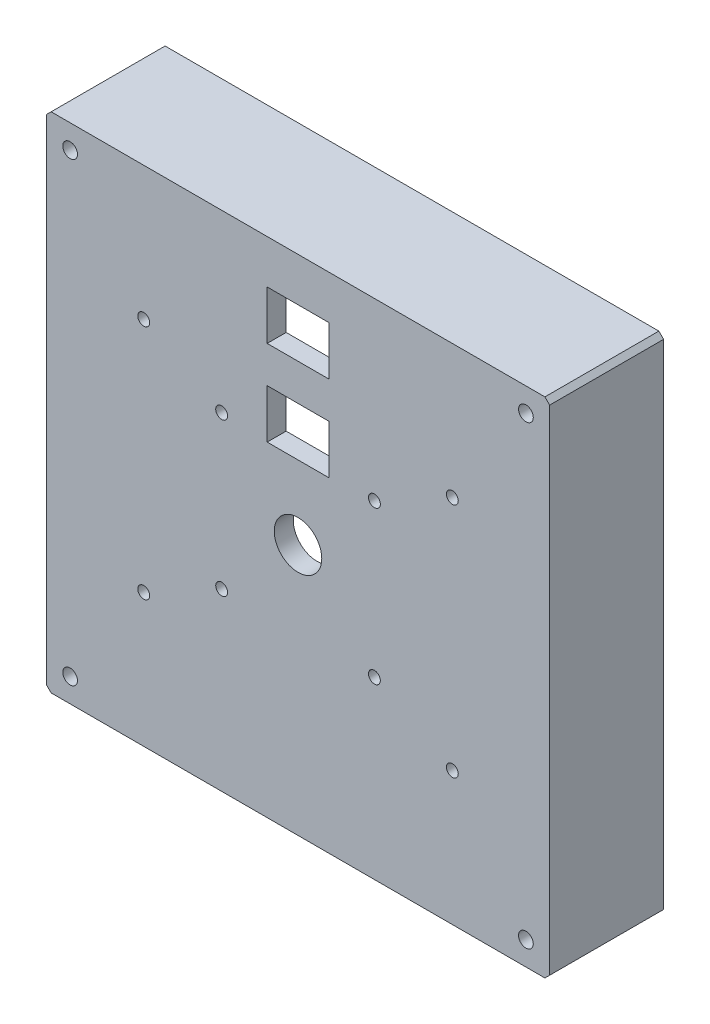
ISO-10303-21;
HEADER;
FILE_DESCRIPTION(('STEP AP214'),'2;1');
FILE_NAME('part.step','',(''),(''),'','','');
FILE_SCHEMA(('AUTOMOTIVE_DESIGN { 1 0 10303 214 1 1 1 1 }'));
ENDSEC;
DATA;
#1=APPLICATION_CONTEXT('core data for automotive mechanical design processes');
#2=APPLICATION_PROTOCOL_DEFINITION('international standard','automotive_design',2000,#1);
#3=PRODUCT_CONTEXT('',#1,'mechanical');
#4=PRODUCT('Part','Part','',(#3));
#5=PRODUCT_RELATED_PRODUCT_CATEGORY('part','',(#4));
#6=PRODUCT_DEFINITION_FORMATION('','',#4);
#7=PRODUCT_DEFINITION_CONTEXT('part definition',#1,'design');
#8=PRODUCT_DEFINITION('design','',#6,#7);
#9=PRODUCT_DEFINITION_SHAPE('','',#8);
#10=(LENGTH_UNIT() NAMED_UNIT(*) SI_UNIT(.MILLI.,.METRE.));
#11=(NAMED_UNIT(*) PLANE_ANGLE_UNIT() SI_UNIT($,.RADIAN.));
#12=(NAMED_UNIT(*) SI_UNIT($,.STERADIAN.) SOLID_ANGLE_UNIT());
#13=UNCERTAINTY_MEASURE_WITH_UNIT(LENGTH_MEASURE(1.E-05),#10,'distance_accuracy_value','');
#14=(GEOMETRIC_REPRESENTATION_CONTEXT(3) GLOBAL_UNCERTAINTY_ASSIGNED_CONTEXT((#13)) GLOBAL_UNIT_ASSIGNED_CONTEXT((#10,
#11,#12)) REPRESENTATION_CONTEXT('',''));
#15=CARTESIAN_POINT('',(0.,0.,0.));
#16=DIRECTION('',(0.,0.,1.));
#17=DIRECTION('',(1.,0.,0.));
#18=AXIS2_PLACEMENT_3D('',#15,#16,#17);
#19=CARTESIAN_POINT('',(-53.,53.,-4.));
#20=DIRECTION('',(-1.,0.,0.));
#21=DIRECTION('',(0.,-1.,0.));
#22=AXIS2_PLACEMENT_3D('',#19,#20,#21);
#23=PLANE('',#22);
#24=DIRECTION('',(0.,-1.,0.));
#25=VECTOR('',#24,1.);
#26=CARTESIAN_POINT('',(-53.,53.,0.));
#27=LINE('',#26,#25);
#28=CARTESIAN_POINT('',(-53.,52.,0.));
#29=VERTEX_POINT('',#28);
#30=CARTESIAN_POINT('',(-53.,-52.,0.));
#31=VERTEX_POINT('',#30);
#32=EDGE_CURVE('E1082',#29,#31,#27,.T.);
#33=ORIENTED_EDGE('',*,*,#32,.F.);
#34=DIRECTION('',(0.,0.,-1.));
#35=VECTOR('',#34,1.);
#36=CARTESIAN_POINT('',(-53.,52.,-4.));
#37=LINE('',#36,#35);
#38=CARTESIAN_POINT('',(-53.,52.,-24.));
#39=VERTEX_POINT('',#38);
#40=EDGE_CURVE('E475',#29,#39,#37,.T.);
#41=ORIENTED_EDGE('',*,*,#40,.T.);
#42=DIRECTION('',(0.,1.,0.));
#43=VECTOR('',#42,1.);
#44=CARTESIAN_POINT('',(-53.,53.,-24.));
#45=LINE('',#44,#43);
#46=CARTESIAN_POINT('',(-53.,-52.,-24.));
#47=VERTEX_POINT('',#46);
#48=EDGE_CURVE('E1076',#47,#39,#45,.T.);
#49=ORIENTED_EDGE('',*,*,#48,.F.);
#50=DIRECTION('',(0.,0.,1.));
#51=VECTOR('',#50,1.);
#52=CARTESIAN_POINT('',(-53.,-52.,-4.));
#53=LINE('',#52,#51);
#54=EDGE_CURVE('E472',#47,#31,#53,.T.);
#55=ORIENTED_EDGE('',*,*,#54,.T.);
#56=EDGE_LOOP('',(#33,#41,#49,#55));
#57=FACE_BOUND('',#56,.T.);
#58=ADVANCED_FACE('F33',(#57),#23,.T.);
#59=CARTESIAN_POINT('',(-53.,53.,-4.));
#60=DIRECTION('',(0.,1.,0.));
#61=DIRECTION('',(-1.,0.,0.));
#62=AXIS2_PLACEMENT_3D('',#59,#60,#61);
#63=PLANE('',#62);
#64=DIRECTION('',(-1.,0.,0.));
#65=VECTOR('',#64,1.);
#66=CARTESIAN_POINT('',(-53.,53.,0.));
#67=LINE('',#66,#65);
#68=CARTESIAN_POINT('',(52.,53.,0.));
#69=VERTEX_POINT('',#68);
#70=CARTESIAN_POINT('',(-52.,53.,0.));
#71=VERTEX_POINT('',#70);
#72=EDGE_CURVE('E1091',#69,#71,#67,.T.);
#73=ORIENTED_EDGE('',*,*,#72,.F.);
#74=DIRECTION('',(0.,0.,-1.));
#75=VECTOR('',#74,1.);
#76=CARTESIAN_POINT('',(52.,53.,-4.));
#77=LINE('',#76,#75);
#78=CARTESIAN_POINT('',(52.,53.,-24.));
#79=VERTEX_POINT('',#78);
#80=EDGE_CURVE('E462',#69,#79,#77,.T.);
#81=ORIENTED_EDGE('',*,*,#80,.T.);
#82=DIRECTION('',(1.,0.,0.));
#83=VECTOR('',#82,1.);
#84=CARTESIAN_POINT('',(53.,53.,-24.));
#85=LINE('',#84,#83);
#86=CARTESIAN_POINT('',(-52.,53.,-24.));
#87=VERTEX_POINT('',#86);
#88=EDGE_CURVE('E1079',#87,#79,#85,.T.);
#89=ORIENTED_EDGE('',*,*,#88,.F.);
#90=DIRECTION('',(0.,0.,1.));
#91=VECTOR('',#90,1.);
#92=CARTESIAN_POINT('',(-52.,53.,-4.));
#93=LINE('',#92,#91);
#94=EDGE_CURVE('E459',#87,#71,#93,.T.);
#95=ORIENTED_EDGE('',*,*,#94,.T.);
#96=EDGE_LOOP('',(#73,#81,#89,#95));
#97=FACE_BOUND('',#96,.T.);
#98=ADVANCED_FACE('F544',(#97),#63,.T.);
#99=CARTESIAN_POINT('',(53.,53.,-4.));
#100=DIRECTION('',(1.,0.,0.));
#101=DIRECTION('',(0.,1.,0.));
#102=AXIS2_PLACEMENT_3D('',#99,#100,#101);
#103=PLANE('',#102);
#104=DIRECTION('',(0.,-1.,0.));
#105=VECTOR('',#104,1.);
#106=CARTESIAN_POINT('',(53.,53.,-24.));
#107=LINE('',#106,#105);
#108=CARTESIAN_POINT('',(53.,52.,-24.));
#109=VERTEX_POINT('',#108);
#110=CARTESIAN_POINT('',(53.,-52.,-24.));
#111=VERTEX_POINT('',#110);
#112=EDGE_CURVE('E1070',#109,#111,#107,.T.);
#113=ORIENTED_EDGE('',*,*,#112,.F.);
#114=DIRECTION('',(0.,0.,1.));
#115=VECTOR('',#114,1.);
#116=CARTESIAN_POINT('',(53.,52.,-4.));
#117=LINE('',#116,#115);
#118=CARTESIAN_POINT('',(53.,52.,0.));
#119=VERTEX_POINT('',#118);
#120=EDGE_CURVE('E444',#109,#119,#117,.T.);
#121=ORIENTED_EDGE('',*,*,#120,.T.);
#122=DIRECTION('',(0.,1.,0.));
#123=VECTOR('',#122,1.);
#124=CARTESIAN_POINT('',(53.,53.,0.));
#125=LINE('',#124,#123);
#126=CARTESIAN_POINT('',(53.,-52.,0.));
#127=VERTEX_POINT('',#126);
#128=EDGE_CURVE('E1088',#127,#119,#125,.T.);
#129=ORIENTED_EDGE('',*,*,#128,.F.);
#130=DIRECTION('',(0.,0.,-1.));
#131=VECTOR('',#130,1.);
#132=CARTESIAN_POINT('',(53.,-52.,-4.));
#133=LINE('',#132,#131);
#134=EDGE_CURVE('E442',#127,#111,#133,.T.);
#135=ORIENTED_EDGE('',*,*,#134,.T.);
#136=EDGE_LOOP('',(#113,#121,#129,#135));
#137=FACE_BOUND('',#136,.T.);
#138=ADVANCED_FACE('F550',(#137),#103,.T.);
#139=CARTESIAN_POINT('',(-53.,-53.,-4.));
#140=DIRECTION('',(0.,-1.,0.));
#141=DIRECTION('',(1.,0.,0.));
#142=AXIS2_PLACEMENT_3D('',#139,#140,#141);
#143=PLANE('',#142);
#144=CARTESIAN_POINT('',(-20.,-53.,-10.83));
#145=DIRECTION('',(0.,-1.,0.));
#146=DIRECTION('',(1.,0.,0.));
#147=AXIS2_PLACEMENT_3D('',#144,#145,#146);
#148=CIRCLE('',#147,3.49999999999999);
#149=CARTESIAN_POINT('',(-16.5,-53.,-10.83));
#150=VERTEX_POINT('',#149);
#151=EDGE_CURVE('E11',#150,#150,#148,.F.);
#152=ORIENTED_EDGE('',*,*,#151,.T.);
#153=EDGE_LOOP('',(#152));
#154=FACE_BOUND('',#153,.T.);
#155=DIRECTION('',(0.,0.,1.));
#156=VECTOR('',#155,1.);
#157=CARTESIAN_POINT('',(-7.49999999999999,-53.,-6.83));
#158=LINE('',#157,#156);
#159=CARTESIAN_POINT('',(-7.5,-53.,-15.83));
#160=VERTEX_POINT('',#159);
#161=CARTESIAN_POINT('',(-7.49999999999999,-53.,-5.83));
#162=VERTEX_POINT('',#161);
#163=EDGE_CURVE('E485',#160,#162,#158,.T.);
#164=ORIENTED_EDGE('',*,*,#163,.T.);
#165=DIRECTION('',(1.,0.,0.));
#166=VECTOR('',#165,1.);
#167=CARTESIAN_POINT('',(6.5,-53.,-5.83));
#168=LINE('',#167,#166);
#169=CARTESIAN_POINT('',(7.5,-53.,-5.83));
#170=VERTEX_POINT('',#169);
#171=EDGE_CURVE('E491',#162,#170,#168,.T.);
#172=ORIENTED_EDGE('',*,*,#171,.T.);
#173=DIRECTION('',(0.,0.,-1.));
#174=VECTOR('',#173,1.);
#175=CARTESIAN_POINT('',(7.5,-53.,-14.83));
#176=LINE('',#175,#174);
#177=CARTESIAN_POINT('',(7.5,-53.,-15.83));
#178=VERTEX_POINT('',#177);
#179=EDGE_CURVE('E489',#170,#178,#176,.T.);
#180=ORIENTED_EDGE('',*,*,#179,.T.);
#181=DIRECTION('',(-1.,0.,0.));
#182=VECTOR('',#181,1.);
#183=CARTESIAN_POINT('',(-6.49999999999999,-53.,-15.83));
#184=LINE('',#183,#182);
#185=EDGE_CURVE('E487',#178,#160,#184,.T.);
#186=ORIENTED_EDGE('',*,*,#185,.T.);
#187=EDGE_LOOP('',(#164,#172,#180,#186));
#188=FACE_BOUND('',#187,.T.);
#189=DIRECTION('',(1.,0.,0.));
#190=VECTOR('',#189,1.);
#191=CARTESIAN_POINT('',(-53.,-53.,0.));
#192=LINE('',#191,#190);
#193=CARTESIAN_POINT('',(-52.,-53.,0.));
#194=VERTEX_POINT('',#193);
#195=CARTESIAN_POINT('',(52.,-53.,0.));
#196=VERTEX_POINT('',#195);
#197=EDGE_CURVE('E1085',#194,#196,#192,.T.);
#198=ORIENTED_EDGE('',*,*,#197,.F.);
#199=DIRECTION('',(0.,0.,-1.));
#200=VECTOR('',#199,1.);
#201=CARTESIAN_POINT('',(-52.,-53.,-4.));
#202=LINE('',#201,#200);
#203=CARTESIAN_POINT('',(-52.,-53.,-24.));
#204=VERTEX_POINT('',#203);
#205=EDGE_CURVE('E480',#194,#204,#202,.T.);
#206=ORIENTED_EDGE('',*,*,#205,.T.);
#207=DIRECTION('',(-1.,0.,0.));
#208=VECTOR('',#207,1.);
#209=CARTESIAN_POINT('',(53.,-53.,-24.));
#210=LINE('',#209,#208);
#211=CARTESIAN_POINT('',(52.,-53.,-24.));
#212=VERTEX_POINT('',#211);
#213=EDGE_CURVE('E1073',#212,#204,#210,.T.);
#214=ORIENTED_EDGE('',*,*,#213,.F.);
#215=DIRECTION('',(0.,0.,1.));
#216=VECTOR('',#215,1.);
#217=CARTESIAN_POINT('',(52.,-53.,-4.));
#218=LINE('',#217,#216);
#219=EDGE_CURVE('E477',#212,#196,#218,.T.);
#220=ORIENTED_EDGE('',*,*,#219,.T.);
#221=EDGE_LOOP('',(#198,#206,#214,#220));
#222=FACE_BOUND('',#221,.T.);
#223=ADVANCED_FACE('F556',(#154,#188,#222),#143,.T.);
#224=CARTESIAN_POINT('',(0.,0.,0.));
#225=DIRECTION('',(0.,0.,1.));
#226=DIRECTION('',(1.,0.,0.));
#227=AXIS2_PLACEMENT_3D('',#224,#225,#226);
#228=PLANE('',#227);
#229=DIRECTION('',(0.,-1.,0.));
#230=VECTOR('',#229,1.);
#231=CARTESIAN_POINT('',(-6.5,43.8,0.));
#232=LINE('',#231,#230);
#233=CARTESIAN_POINT('',(-6.5,43.8,0.));
#234=VERTEX_POINT('',#233);
#235=CARTESIAN_POINT('',(-6.5,33.5,0.));
#236=VERTEX_POINT('',#235);
#237=EDGE_CURVE('E930',#234,#236,#232,.T.);
#238=ORIENTED_EDGE('',*,*,#237,.F.);
#239=DIRECTION('',(-1.,0.,0.));
#240=VECTOR('',#239,1.);
#241=CARTESIAN_POINT('',(-6.5,43.8,0.));
#242=LINE('',#241,#240);
#243=CARTESIAN_POINT('',(6.5,43.8,0.));
#244=VERTEX_POINT('',#243);
#245=EDGE_CURVE('E939',#244,#234,#242,.T.);
#246=ORIENTED_EDGE('',*,*,#245,.F.);
#247=DIRECTION('',(0.,1.,0.));
#248=VECTOR('',#247,1.);
#249=CARTESIAN_POINT('',(6.5,43.8,0.));
#250=LINE('',#249,#248);
#251=CARTESIAN_POINT('',(6.5,33.5,0.));
#252=VERTEX_POINT('',#251);
#253=EDGE_CURVE('E936',#252,#244,#250,.T.);
#254=ORIENTED_EDGE('',*,*,#253,.F.);
#255=DIRECTION('',(1.,0.,0.));
#256=VECTOR('',#255,1.);
#257=CARTESIAN_POINT('',(-6.5,33.5,0.));
#258=LINE('',#257,#256);
#259=EDGE_CURVE('E932',#236,#252,#258,.T.);
#260=ORIENTED_EDGE('',*,*,#259,.F.);
#261=EDGE_LOOP('',(#238,#246,#254,#260));
#262=FACE_BOUND('',#261,.T.);
#263=CARTESIAN_POINT('',(0.,0.,0.));
#264=DIRECTION('',(0.,0.,1.));
#265=DIRECTION('',(1.,0.,0.));
#266=AXIS2_PLACEMENT_3D('',#263,#264,#265);
#267=CIRCLE('',#266,5.);
#268=CARTESIAN_POINT('',(5.,0.,0.));
#269=VERTEX_POINT('',#268);
#270=EDGE_CURVE('E927',#269,#269,#267,.T.);
#271=ORIENTED_EDGE('',*,*,#270,.F.);
#272=EDGE_LOOP('',(#271));
#273=FACE_BOUND('',#272,.T.);
#274=CARTESIAN_POINT('',(-16.086679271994,16.086679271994,0.));
#275=DIRECTION('',(0.,0.,1.));
#276=DIRECTION('',(1.,0.,0.));
#277=AXIS2_PLACEMENT_3D('',#274,#275,#276);
#278=CIRCLE('',#277,1.25);
#279=CARTESIAN_POINT('',(-14.836679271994,16.086679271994,0.));
#280=VERTEX_POINT('',#279);
#281=EDGE_CURVE('E952',#280,#280,#278,.T.);
#282=ORIENTED_EDGE('',*,*,#281,.F.);
#283=EDGE_LOOP('',(#282));
#284=FACE_BOUND('',#283,.T.);
#285=DIRECTION('',(0.,-1.,0.));
#286=VECTOR('',#285,1.);
#287=CARTESIAN_POINT('',(-6.49999999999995,25.8,0.));
#288=LINE('',#287,#286);
#289=CARTESIAN_POINT('',(-6.49999999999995,25.8,0.));
#290=VERTEX_POINT('',#289);
#291=CARTESIAN_POINT('',(-6.49999999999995,15.5,0.));
#292=VERTEX_POINT('',#291);
#293=EDGE_CURVE('E970',#290,#292,#288,.T.);
#294=ORIENTED_EDGE('',*,*,#293,.F.);
#295=DIRECTION('',(-1.,0.,0.));
#296=VECTOR('',#295,1.);
#297=CARTESIAN_POINT('',(-6.49999999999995,25.8,0.));
#298=LINE('',#297,#296);
#299=CARTESIAN_POINT('',(6.49999999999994,25.8,0.));
#300=VERTEX_POINT('',#299);
#301=EDGE_CURVE('E979',#300,#290,#298,.T.);
#302=ORIENTED_EDGE('',*,*,#301,.F.);
#303=DIRECTION('',(0.,1.,0.));
#304=VECTOR('',#303,1.);
#305=CARTESIAN_POINT('',(6.49999999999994,25.8,0.));
#306=LINE('',#305,#304);
#307=CARTESIAN_POINT('',(6.49999999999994,15.5,0.));
#308=VERTEX_POINT('',#307);
#309=EDGE_CURVE('E976',#308,#300,#306,.T.);
#310=ORIENTED_EDGE('',*,*,#309,.F.);
#311=DIRECTION('',(1.,0.,0.));
#312=VECTOR('',#311,1.);
#313=CARTESIAN_POINT('',(-6.49999999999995,15.5,0.));
#314=LINE('',#313,#312);
#315=EDGE_CURVE('E972',#292,#308,#314,.T.);
#316=ORIENTED_EDGE('',*,*,#315,.F.);
#317=EDGE_LOOP('',(#294,#302,#310,#316));
#318=FACE_BOUND('',#317,.T.);
#319=CARTESIAN_POINT('',(32.5,24.9,0.));
#320=DIRECTION('',(0.,0.,1.));
#321=DIRECTION('',(1.,0.,0.));
#322=AXIS2_PLACEMENT_3D('',#319,#320,#321);
#323=CIRCLE('',#322,1.25);
#324=CARTESIAN_POINT('',(33.75,24.9,0.));
#325=VERTEX_POINT('',#324);
#326=EDGE_CURVE('E973',#325,#325,#323,.T.);
#327=ORIENTED_EDGE('',*,*,#326,.F.);
#328=EDGE_LOOP('',(#327));
#329=FACE_BOUND('',#328,.T.);
#330=CARTESIAN_POINT('',(-32.5,24.9,0.));
#331=DIRECTION('',(0.,0.,1.));
#332=DIRECTION('',(1.,0.,0.));
#333=AXIS2_PLACEMENT_3D('',#330,#331,#332);
#334=CIRCLE('',#333,1.25);
#335=CARTESIAN_POINT('',(-31.25,24.9,0.));
#336=VERTEX_POINT('',#335);
#337=EDGE_CURVE('E992',#336,#336,#334,.T.);
#338=ORIENTED_EDGE('',*,*,#337,.F.);
#339=EDGE_LOOP('',(#338));
#340=FACE_BOUND('',#339,.T.);
#341=CARTESIAN_POINT('',(-32.5,-24.9,0.));
#342=DIRECTION('',(0.,0.,1.));
#343=DIRECTION('',(1.,0.,0.));
#344=AXIS2_PLACEMENT_3D('',#341,#342,#343);
#345=CIRCLE('',#344,1.25);
#346=CARTESIAN_POINT('',(-31.25,-24.9,0.));
#347=VERTEX_POINT('',#346);
#348=EDGE_CURVE('E967',#347,#347,#345,.T.);
#349=ORIENTED_EDGE('',*,*,#348,.F.);
#350=EDGE_LOOP('',(#349));
#351=FACE_BOUND('',#350,.T.);
#352=CARTESIAN_POINT('',(16.086679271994,16.086679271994,0.));
#353=DIRECTION('',(0.,0.,1.));
#354=DIRECTION('',(1.,0.,0.));
#355=AXIS2_PLACEMENT_3D('',#352,#353,#354);
#356=CIRCLE('',#355,1.25);
#357=CARTESIAN_POINT('',(17.336679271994,16.086679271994,0.));
#358=VERTEX_POINT('',#357);
#359=EDGE_CURVE('E955',#358,#358,#356,.T.);
#360=ORIENTED_EDGE('',*,*,#359,.F.);
#361=EDGE_LOOP('',(#360));
#362=FACE_BOUND('',#361,.T.);
#363=CARTESIAN_POINT('',(-16.086679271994,-16.086679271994,0.));
#364=DIRECTION('',(0.,0.,1.));
#365=DIRECTION('',(1.,0.,0.));
#366=AXIS2_PLACEMENT_3D('',#363,#364,#365);
#367=CIRCLE('',#366,1.25);
#368=CARTESIAN_POINT('',(-14.836679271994,-16.086679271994,0.));
#369=VERTEX_POINT('',#368);
#370=EDGE_CURVE('E958',#369,#369,#367,.T.);
#371=ORIENTED_EDGE('',*,*,#370,.F.);
#372=EDGE_LOOP('',(#371));
#373=FACE_BOUND('',#372,.T.);
#374=CARTESIAN_POINT('',(16.086679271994,-16.086679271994,0.));
#375=DIRECTION('',(0.,0.,1.));
#376=DIRECTION('',(1.,0.,0.));
#377=AXIS2_PLACEMENT_3D('',#374,#375,#376);
#378=CIRCLE('',#377,1.25);
#379=CARTESIAN_POINT('',(17.336679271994,-16.086679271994,0.));
#380=VERTEX_POINT('',#379);
#381=EDGE_CURVE('E961',#380,#380,#378,.T.);
#382=ORIENTED_EDGE('',*,*,#381,.F.);
#383=EDGE_LOOP('',(#382));
#384=FACE_BOUND('',#383,.T.);
#385=CARTESIAN_POINT('',(32.5,-24.9,0.));
#386=DIRECTION('',(0.,0.,1.));
#387=DIRECTION('',(1.,0.,0.));
#388=AXIS2_PLACEMENT_3D('',#385,#386,#387);
#389=CIRCLE('',#388,1.25);
#390=CARTESIAN_POINT('',(33.75,-24.9,0.));
#391=VERTEX_POINT('',#390);
#392=EDGE_CURVE('E964',#391,#391,#389,.T.);
#393=ORIENTED_EDGE('',*,*,#392,.F.);
#394=EDGE_LOOP('',(#393));
#395=FACE_BOUND('',#394,.T.);
#396=CARTESIAN_POINT('',(48.,48.,0.));
#397=DIRECTION('',(0.,0.,1.));
#398=DIRECTION('',(1.,0.,0.));
#399=AXIS2_PLACEMENT_3D('',#396,#397,#398);
#400=CIRCLE('',#399,1.55);
#401=CARTESIAN_POINT('',(49.55,48.,0.));
#402=VERTEX_POINT('',#401);
#403=EDGE_CURVE('E1002',#402,#402,#400,.T.);
#404=ORIENTED_EDGE('',*,*,#403,.F.);
#405=EDGE_LOOP('',(#404));
#406=FACE_BOUND('',#405,.T.);
#407=CARTESIAN_POINT('',(-48.,-48.,0.));
#408=DIRECTION('',(0.,0.,1.));
#409=DIRECTION('',(1.,0.,0.));
#410=AXIS2_PLACEMENT_3D('',#407,#408,#409);
#411=CIRCLE('',#410,1.55);
#412=CARTESIAN_POINT('',(-46.45,-48.,0.));
#413=VERTEX_POINT('',#412);
#414=EDGE_CURVE('E1000',#413,#413,#411,.T.);
#415=ORIENTED_EDGE('',*,*,#414,.F.);
#416=EDGE_LOOP('',(#415));
#417=FACE_BOUND('',#416,.T.);
#418=CARTESIAN_POINT('',(48.,-48.,0.));
#419=DIRECTION('',(0.,0.,1.));
#420=DIRECTION('',(1.,0.,0.));
#421=AXIS2_PLACEMENT_3D('',#418,#419,#420);
#422=CIRCLE('',#421,1.55);
#423=CARTESIAN_POINT('',(49.55,-48.,0.));
#424=VERTEX_POINT('',#423);
#425=EDGE_CURVE('E997',#424,#424,#422,.T.);
#426=ORIENTED_EDGE('',*,*,#425,.F.);
#427=EDGE_LOOP('',(#426));
#428=FACE_BOUND('',#427,.T.);
#429=CARTESIAN_POINT('',(-48.,48.,0.));
#430=DIRECTION('',(0.,0.,1.));
#431=DIRECTION('',(1.,0.,0.));
#432=AXIS2_PLACEMENT_3D('',#429,#430,#431);
#433=CIRCLE('',#432,1.55);
#434=CARTESIAN_POINT('',(-46.45,48.,0.));
#435=VERTEX_POINT('',#434);
#436=EDGE_CURVE('E1005',#435,#435,#433,.T.);
#437=ORIENTED_EDGE('',*,*,#436,.F.);
#438=EDGE_LOOP('',(#437));
#439=FACE_BOUND('',#438,.T.);
#440=ORIENTED_EDGE('',*,*,#128,.T.);
#441=DIRECTION('',(0.707106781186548,-0.707106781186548,0.));
#442=VECTOR('',#441,1.);
#443=CARTESIAN_POINT('',(52.5,52.5,0.));
#444=LINE('',#443,#442);
#445=EDGE_CURVE('E457',#119,#69,#444,.F.);
#446=ORIENTED_EDGE('',*,*,#445,.T.);
#447=ORIENTED_EDGE('',*,*,#72,.T.);
#448=DIRECTION('',(0.707106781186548,0.707106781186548,0.));
#449=VECTOR('',#448,1.);
#450=CARTESIAN_POINT('',(-52.5,52.5,0.));
#451=LINE('',#450,#449);
#452=EDGE_CURVE('E455',#71,#29,#451,.F.);
#453=ORIENTED_EDGE('',*,*,#452,.T.);
#454=ORIENTED_EDGE('',*,*,#32,.T.);
#455=DIRECTION('',(-0.707106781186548,0.707106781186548,0.));
#456=VECTOR('',#455,1.);
#457=CARTESIAN_POINT('',(-52.5,-52.5,0.));
#458=LINE('',#457,#456);
#459=EDGE_CURVE('E453',#31,#194,#458,.F.);
#460=ORIENTED_EDGE('',*,*,#459,.T.);
#461=ORIENTED_EDGE('',*,*,#197,.T.);
#462=DIRECTION('',(-0.70710678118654,-0.707106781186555,0.));
#463=VECTOR('',#462,1.);
#464=CARTESIAN_POINT('',(52.5000000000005,-52.4999999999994,0.));
#465=LINE('',#464,#463);
#466=EDGE_CURVE('E451',#196,#127,#465,.F.);
#467=ORIENTED_EDGE('',*,*,#466,.T.);
#468=EDGE_LOOP('',(#440,#446,#447,#453,#454,#460,#461,#467));
#469=FACE_BOUND('',#468,.T.);
#470=ADVANCED_FACE('F1166',(#262,#273,#284,#318,#329,#340,#351,#362,#373,#384,#395,#406,#417,
#428,#439,#469),#228,.T.);
#471=CARTESIAN_POINT('',(0.,0.,-24.));
#472=DIRECTION('',(0.,0.,-1.));
#473=DIRECTION('',(-1.,0.,0.));
#474=AXIS2_PLACEMENT_3D('',#471,#472,#473);
#475=PLANE('',#474);
#476=CARTESIAN_POINT('',(48.,48.,-24.));
#477=DIRECTION('',(0.,0.,-1.));
#478=DIRECTION('',(-1.,0.,0.));
#479=AXIS2_PLACEMENT_3D('',#476,#477,#478);
#480=CIRCLE('',#479,1.55);
#481=CARTESIAN_POINT('',(46.45,48.,-24.));
#482=VERTEX_POINT('',#481);
#483=EDGE_CURVE('E1034',#482,#482,#480,.T.);
#484=ORIENTED_EDGE('',*,*,#483,.F.);
#485=EDGE_LOOP('',(#484));
#486=FACE_BOUND('',#485,.T.);
#487=CARTESIAN_POINT('',(-48.,-48.,-24.));
#488=DIRECTION('',(0.,0.,-1.));
#489=DIRECTION('',(-1.,0.,0.));
#490=AXIS2_PLACEMENT_3D('',#487,#488,#489);
#491=CIRCLE('',#490,1.55);
#492=CARTESIAN_POINT('',(-49.55,-48.,-24.));
#493=VERTEX_POINT('',#492);
#494=EDGE_CURVE('E1100',#493,#493,#491,.T.);
#495=ORIENTED_EDGE('',*,*,#494,.F.);
#496=EDGE_LOOP('',(#495));
#497=FACE_BOUND('',#496,.T.);
#498=CARTESIAN_POINT('',(48.,-48.,-24.));
#499=DIRECTION('',(0.,0.,-1.));
#500=DIRECTION('',(-1.,0.,0.));
#501=AXIS2_PLACEMENT_3D('',#498,#499,#500);
#502=CIRCLE('',#501,1.55);
#503=CARTESIAN_POINT('',(46.45,-48.,-24.));
#504=VERTEX_POINT('',#503);
#505=EDGE_CURVE('E1097',#504,#504,#502,.T.);
#506=ORIENTED_EDGE('',*,*,#505,.F.);
#507=EDGE_LOOP('',(#506));
#508=FACE_BOUND('',#507,.T.);
#509=CARTESIAN_POINT('',(-48.,48.,-24.));
#510=DIRECTION('',(0.,0.,-1.));
#511=DIRECTION('',(-1.,0.,0.));
#512=AXIS2_PLACEMENT_3D('',#509,#510,#511);
#513=CIRCLE('',#512,1.55);
#514=CARTESIAN_POINT('',(-49.55,48.,-24.));
#515=VERTEX_POINT('',#514);
#516=EDGE_CURVE('E1010',#515,#515,#513,.T.);
#517=ORIENTED_EDGE('',*,*,#516,.F.);
#518=EDGE_LOOP('',(#517));
#519=FACE_BOUND('',#518,.T.);
#520=ORIENTED_EDGE('',*,*,#88,.T.);
#521=DIRECTION('',(-0.707106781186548,0.707106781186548,0.));
#522=VECTOR('',#521,1.);
#523=CARTESIAN_POINT('',(52.5,52.5,-24.));
#524=LINE('',#523,#522);
#525=EDGE_CURVE('E470',#79,#109,#524,.F.);
#526=ORIENTED_EDGE('',*,*,#525,.T.);
#527=ORIENTED_EDGE('',*,*,#112,.T.);
#528=DIRECTION('',(0.70710678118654,0.707106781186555,0.));
#529=VECTOR('',#528,1.);
#530=CARTESIAN_POINT('',(52.5000000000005,-52.4999999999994,-24.));
#531=LINE('',#530,#529);
#532=EDGE_CURVE('E464',#111,#212,#531,.F.);
#533=ORIENTED_EDGE('',*,*,#532,.T.);
#534=ORIENTED_EDGE('',*,*,#213,.T.);
#535=DIRECTION('',(0.707106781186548,-0.707106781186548,0.));
#536=VECTOR('',#535,1.);
#537=CARTESIAN_POINT('',(-52.5,-52.5,-24.));
#538=LINE('',#537,#536);
#539=EDGE_CURVE('E466',#204,#47,#538,.F.);
#540=ORIENTED_EDGE('',*,*,#539,.T.);
#541=ORIENTED_EDGE('',*,*,#48,.T.);
#542=DIRECTION('',(-0.707106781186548,-0.707106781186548,0.));
#543=VECTOR('',#542,1.);
#544=CARTESIAN_POINT('',(-52.5,52.5,-24.));
#545=LINE('',#544,#543);
#546=EDGE_CURVE('E468',#39,#87,#545,.F.);
#547=ORIENTED_EDGE('',*,*,#546,.T.);
#548=EDGE_LOOP('',(#520,#526,#527,#533,#534,#540,#541,#547));
#549=FACE_BOUND('',#548,.T.);
#550=DIRECTION('',(-1.,0.,0.));
#551=VECTOR('',#550,1.);
#552=CARTESIAN_POINT('',(41.,-48.,-24.));
#553=LINE('',#552,#551);
#554=CARTESIAN_POINT('',(41.,-48.,-24.));
#555=VERTEX_POINT('',#554);
#556=CARTESIAN_POINT('',(-41.,-48.,-24.));
#557=VERTEX_POINT('',#556);
#558=EDGE_CURVE('E1013',#555,#557,#553,.T.);
#559=ORIENTED_EDGE('',*,*,#558,.F.);
#560=DIRECTION('',(-0.707106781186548,-0.707106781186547,0.));
#561=VECTOR('',#560,1.);
#562=CARTESIAN_POINT('',(48.,-41.,-24.));
#563=LINE('',#562,#561);
#564=CARTESIAN_POINT('',(48.,-41.,-24.));
#565=VERTEX_POINT('',#564);
#566=EDGE_CURVE('E1011',#565,#555,#563,.T.);
#567=ORIENTED_EDGE('',*,*,#566,.F.);
#568=DIRECTION('',(0.,-1.,0.));
#569=VECTOR('',#568,1.);
#570=CARTESIAN_POINT('',(48.,41.,-24.));
#571=LINE('',#570,#569);
#572=CARTESIAN_POINT('',(48.,41.,-24.));
#573=VERTEX_POINT('',#572);
#574=EDGE_CURVE('E1027',#573,#565,#571,.T.);
#575=ORIENTED_EDGE('',*,*,#574,.F.);
#576=DIRECTION('',(0.707106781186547,-0.707106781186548,0.));
#577=VECTOR('',#576,1.);
#578=CARTESIAN_POINT('',(41.,48.,-24.));
#579=LINE('',#578,#577);
#580=CARTESIAN_POINT('',(41.,48.,-24.));
#581=VERTEX_POINT('',#580);
#582=EDGE_CURVE('E1024',#581,#573,#579,.T.);
#583=ORIENTED_EDGE('',*,*,#582,.F.);
#584=DIRECTION('',(1.,0.,0.));
#585=VECTOR('',#584,1.);
#586=CARTESIAN_POINT('',(-41.,48.,-24.));
#587=LINE('',#586,#585);
#588=CARTESIAN_POINT('',(-41.,48.,-24.));
#589=VERTEX_POINT('',#588);
#590=EDGE_CURVE('E1022',#589,#581,#587,.T.);
#591=ORIENTED_EDGE('',*,*,#590,.F.);
#592=DIRECTION('',(0.707106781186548,0.707106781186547,0.));
#593=VECTOR('',#592,1.);
#594=CARTESIAN_POINT('',(-48.,41.,-24.));
#595=LINE('',#594,#593);
#596=CARTESIAN_POINT('',(-48.,41.,-24.));
#597=VERTEX_POINT('',#596);
#598=EDGE_CURVE('E1020',#597,#589,#595,.T.);
#599=ORIENTED_EDGE('',*,*,#598,.F.);
#600=DIRECTION('',(0.,1.,0.));
#601=VECTOR('',#600,1.);
#602=CARTESIAN_POINT('',(-48.,-41.,-24.));
#603=LINE('',#602,#601);
#604=CARTESIAN_POINT('',(-48.,-41.,-24.));
#605=VERTEX_POINT('',#604);
#606=EDGE_CURVE('E1018',#605,#597,#603,.T.);
#607=ORIENTED_EDGE('',*,*,#606,.F.);
#608=DIRECTION('',(-0.707106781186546,0.707106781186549,0.));
#609=VECTOR('',#608,1.);
#610=CARTESIAN_POINT('',(-41.,-48.,-24.));
#611=LINE('',#610,#609);
#612=EDGE_CURVE('E1016',#557,#605,#611,.T.);
#613=ORIENTED_EDGE('',*,*,#612,.F.);
#614=EDGE_LOOP('',(#559,#567,#575,#583,#591,#599,#607,#613));
#615=FACE_BOUND('',#614,.T.);
#616=ADVANCED_FACE('F1283',(#486,#497,#508,#519,#549,#615),#475,.T.);
#617=CARTESIAN_POINT('',(48.,-41.,-24.));
#618=DIRECTION('',(-0.707106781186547,0.707106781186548,0.));
#619=DIRECTION('',(-0.707106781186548,-0.707106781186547,0.));
#620=AXIS2_PLACEMENT_3D('',#617,#618,#619);
#621=PLANE('',#620);
#622=DIRECTION('',(-0.707106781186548,-0.707106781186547,0.));
#623=VECTOR('',#622,1.);
#624=CARTESIAN_POINT('',(48.,-41.,-4.));
#625=LINE('',#624,#623);
#626=CARTESIAN_POINT('',(48.,-41.,-4.));
#627=VERTEX_POINT('',#626);
#628=CARTESIAN_POINT('',(41.,-48.,-4.));
#629=VERTEX_POINT('',#628);
#630=EDGE_CURVE('E1030',#627,#629,#625,.T.);
#631=ORIENTED_EDGE('',*,*,#630,.F.);
#632=DIRECTION('',(0.,0.,1.));
#633=VECTOR('',#632,1.);
#634=CARTESIAN_POINT('',(48.,-41.,-24.));
#635=LINE('',#634,#633);
#636=EDGE_CURVE('E1029',#565,#627,#635,.T.);
#637=ORIENTED_EDGE('',*,*,#636,.F.);
#638=ORIENTED_EDGE('',*,*,#566,.T.);
#639=DIRECTION('',(0.,0.,1.));
#640=VECTOR('',#639,1.);
#641=CARTESIAN_POINT('',(41.,-48.,-24.));
#642=LINE('',#641,#640);
#643=EDGE_CURVE('E1067',#555,#629,#642,.T.);
#644=ORIENTED_EDGE('',*,*,#643,.T.);
#645=EDGE_LOOP('',(#631,#637,#638,#644));
#646=FACE_BOUND('',#645,.T.);
#647=ADVANCED_FACE('F1280',(#646),#621,.T.);
#648=CARTESIAN_POINT('',(41.,-48.,-24.));
#649=DIRECTION('',(0.,1.,0.));
#650=DIRECTION('',(0.,0.,1.));
#651=AXIS2_PLACEMENT_3D('',#648,#649,#650);
#652=PLANE('',#651);
#653=CARTESIAN_POINT('',(-20.,-48.,-10.83));
#654=DIRECTION('',(0.,1.,0.));
#655=DIRECTION('',(0.,0.,1.));
#656=AXIS2_PLACEMENT_3D('',#653,#654,#655);
#657=CIRCLE('',#656,3.50000000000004);
#658=CARTESIAN_POINT('',(-20.,-48.,-7.32999999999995));
#659=VERTEX_POINT('',#658);
#660=EDGE_CURVE('E41',#659,#659,#657,.F.);
#661=ORIENTED_EDGE('',*,*,#660,.T.);
#662=EDGE_LOOP('',(#661));
#663=FACE_BOUND('',#662,.T.);
#664=DIRECTION('',(0.,0.,1.));
#665=VECTOR('',#664,1.);
#666=CARTESIAN_POINT('',(-6.49999999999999,-48.,-24.));
#667=LINE('',#666,#665);
#668=CARTESIAN_POINT('',(-6.49999999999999,-48.,-14.83));
#669=VERTEX_POINT('',#668);
#670=CARTESIAN_POINT('',(-6.49999999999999,-48.,-6.83));
#671=VERTEX_POINT('',#670);
#672=EDGE_CURVE('E434',#669,#671,#667,.T.);
#673=ORIENTED_EDGE('',*,*,#672,.F.);
#674=DIRECTION('',(-1.,0.,0.));
#675=VECTOR('',#674,1.);
#676=CARTESIAN_POINT('',(41.,-48.,-14.83));
#677=LINE('',#676,#675);
#678=CARTESIAN_POINT('',(6.50000000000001,-48.,-14.83));
#679=VERTEX_POINT('',#678);
#680=EDGE_CURVE('E422',#679,#669,#677,.T.);
#681=ORIENTED_EDGE('',*,*,#680,.F.);
#682=DIRECTION('',(0.,0.,-1.));
#683=VECTOR('',#682,1.);
#684=CARTESIAN_POINT('',(6.50000000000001,-48.,-24.));
#685=LINE('',#684,#683);
#686=CARTESIAN_POINT('',(6.5,-48.,-6.83));
#687=VERTEX_POINT('',#686);
#688=EDGE_CURVE('E430',#687,#679,#685,.T.);
#689=ORIENTED_EDGE('',*,*,#688,.F.);
#690=DIRECTION('',(1.,0.,0.));
#691=VECTOR('',#690,1.);
#692=CARTESIAN_POINT('',(41.,-48.,-6.82999999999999));
#693=LINE('',#692,#691);
#694=EDGE_CURVE('E441',#671,#687,#693,.T.);
#695=ORIENTED_EDGE('',*,*,#694,.F.);
#696=EDGE_LOOP('',(#673,#681,#689,#695));
#697=FACE_BOUND('',#696,.T.);
#698=DIRECTION('',(-1.,0.,0.));
#699=VECTOR('',#698,1.);
#700=CARTESIAN_POINT('',(41.,-48.,-4.));
#701=LINE('',#700,#699);
#702=CARTESIAN_POINT('',(-41.,-48.,-4.));
#703=VERTEX_POINT('',#702);
#704=EDGE_CURVE('E1033',#629,#703,#701,.T.);
#705=ORIENTED_EDGE('',*,*,#704,.F.);
#706=ORIENTED_EDGE('',*,*,#643,.F.);
#707=ORIENTED_EDGE('',*,*,#558,.T.);
#708=DIRECTION('',(0.,0.,1.));
#709=VECTOR('',#708,1.);
#710=CARTESIAN_POINT('',(-41.,-48.,-24.));
#711=LINE('',#710,#709);
#712=EDGE_CURVE('E1065',#557,#703,#711,.T.);
#713=ORIENTED_EDGE('',*,*,#712,.T.);
#714=EDGE_LOOP('',(#705,#706,#707,#713));
#715=FACE_BOUND('',#714,.T.);
#716=ADVANCED_FACE('F439',(#663,#697,#715),#652,.T.);
#717=CARTESIAN_POINT('',(-41.,-48.,-24.));
#718=DIRECTION('',(0.707106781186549,0.707106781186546,0.));
#719=DIRECTION('',(-0.707106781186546,0.707106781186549,0.));
#720=AXIS2_PLACEMENT_3D('',#717,#718,#719);
#721=PLANE('',#720);
#722=DIRECTION('',(-0.707106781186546,0.707106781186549,0.));
#723=VECTOR('',#722,1.);
#724=CARTESIAN_POINT('',(-41.,-48.,-4.));
#725=LINE('',#724,#723);
#726=CARTESIAN_POINT('',(-48.,-41.,-4.));
#727=VERTEX_POINT('',#726);
#728=EDGE_CURVE('E1037',#703,#727,#725,.T.);
#729=ORIENTED_EDGE('',*,*,#728,.F.);
#730=ORIENTED_EDGE('',*,*,#712,.F.);
#731=ORIENTED_EDGE('',*,*,#612,.T.);
#732=DIRECTION('',(0.,0.,1.));
#733=VECTOR('',#732,1.);
#734=CARTESIAN_POINT('',(-48.,-41.,-24.));
#735=LINE('',#734,#733);
#736=EDGE_CURVE('E1063',#605,#727,#735,.T.);
#737=ORIENTED_EDGE('',*,*,#736,.T.);
#738=EDGE_LOOP('',(#729,#730,#731,#737));
#739=FACE_BOUND('',#738,.T.);
#740=ADVANCED_FACE('F1273',(#739),#721,.T.);
#741=CARTESIAN_POINT('',(-48.,-41.,-24.));
#742=DIRECTION('',(1.,0.,0.));
#743=DIRECTION('',(0.,0.,-1.));
#744=AXIS2_PLACEMENT_3D('',#741,#742,#743);
#745=PLANE('',#744);
#746=CARTESIAN_POINT('',(-48.,-23.,-12.));
#747=DIRECTION('',(1.,0.,0.));
#748=DIRECTION('',(0.,0.,-1.));
#749=AXIS2_PLACEMENT_3D('',#746,#747,#748);
#750=CIRCLE('',#749,1.6);
#751=CARTESIAN_POINT('',(-48.,-21.4,-12.));
#752=VERTEX_POINT('',#751);
#753=EDGE_CURVE('E502',#752,#752,#750,.F.);
#754=ORIENTED_EDGE('',*,*,#753,.T.);
#755=EDGE_LOOP('',(#754));
#756=FACE_BOUND('',#755,.T.);
#757=CARTESIAN_POINT('',(-48.,23.,-12.));
#758=DIRECTION('',(1.,0.,0.));
#759=DIRECTION('',(0.,0.,-1.));
#760=AXIS2_PLACEMENT_3D('',#757,#758,#759);
#761=CIRCLE('',#760,1.6);
#762=CARTESIAN_POINT('',(-48.,24.6,-12.));
#763=VERTEX_POINT('',#762);
#764=EDGE_CURVE('E512',#763,#763,#761,.F.);
#765=ORIENTED_EDGE('',*,*,#764,.T.);
#766=EDGE_LOOP('',(#765));
#767=FACE_BOUND('',#766,.T.);
#768=DIRECTION('',(0.,1.,0.));
#769=VECTOR('',#768,1.);
#770=CARTESIAN_POINT('',(-48.,-41.,-4.));
#771=LINE('',#770,#769);
#772=CARTESIAN_POINT('',(-48.,41.,-4.));
#773=VERTEX_POINT('',#772);
#774=EDGE_CURVE('E1040',#727,#773,#771,.T.);
#775=ORIENTED_EDGE('',*,*,#774,.F.);
#776=ORIENTED_EDGE('',*,*,#736,.F.);
#777=ORIENTED_EDGE('',*,*,#606,.T.);
#778=DIRECTION('',(0.,0.,1.));
#779=VECTOR('',#778,1.);
#780=CARTESIAN_POINT('',(-48.,41.,-24.));
#781=LINE('',#780,#779);
#782=EDGE_CURVE('E1061',#597,#773,#781,.T.);
#783=ORIENTED_EDGE('',*,*,#782,.T.);
#784=EDGE_LOOP('',(#775,#776,#777,#783));
#785=FACE_BOUND('',#784,.T.);
#786=ADVANCED_FACE('F1269',(#756,#767,#785),#745,.T.);
#787=CARTESIAN_POINT('',(-48.,41.,-24.));
#788=DIRECTION('',(0.707106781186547,-0.707106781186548,0.));
#789=DIRECTION('',(0.707106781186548,0.707106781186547,0.));
#790=AXIS2_PLACEMENT_3D('',#787,#788,#789);
#791=PLANE('',#790);
#792=DIRECTION('',(0.707106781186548,0.707106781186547,0.));
#793=VECTOR('',#792,1.);
#794=CARTESIAN_POINT('',(-48.,41.,-4.));
#795=LINE('',#794,#793);
#796=CARTESIAN_POINT('',(-41.,48.,-4.));
#797=VERTEX_POINT('',#796);
#798=EDGE_CURVE('E1043',#773,#797,#795,.T.);
#799=ORIENTED_EDGE('',*,*,#798,.F.);
#800=ORIENTED_EDGE('',*,*,#782,.F.);
#801=ORIENTED_EDGE('',*,*,#598,.T.);
#802=DIRECTION('',(0.,0.,1.));
#803=VECTOR('',#802,1.);
#804=CARTESIAN_POINT('',(-41.,48.,-24.));
#805=LINE('',#804,#803);
#806=EDGE_CURVE('E1059',#589,#797,#805,.T.);
#807=ORIENTED_EDGE('',*,*,#806,.T.);
#808=EDGE_LOOP('',(#799,#800,#801,#807));
#809=FACE_BOUND('',#808,.T.);
#810=ADVANCED_FACE('F1265',(#809),#791,.T.);
#811=CARTESIAN_POINT('',(-41.,48.,-24.));
#812=DIRECTION('',(0.,-1.,0.));
#813=DIRECTION('',(1.,0.,0.));
#814=AXIS2_PLACEMENT_3D('',#811,#812,#813);
#815=PLANE('',#814);
#816=DIRECTION('',(1.,0.,0.));
#817=VECTOR('',#816,1.);
#818=CARTESIAN_POINT('',(-41.,48.,-4.));
#819=LINE('',#818,#817);
#820=CARTESIAN_POINT('',(41.,48.,-4.));
#821=VERTEX_POINT('',#820);
#822=EDGE_CURVE('E1046',#797,#821,#819,.T.);
#823=ORIENTED_EDGE('',*,*,#822,.F.);
#824=ORIENTED_EDGE('',*,*,#806,.F.);
#825=ORIENTED_EDGE('',*,*,#590,.T.);
#826=DIRECTION('',(0.,0.,1.));
#827=VECTOR('',#826,1.);
#828=CARTESIAN_POINT('',(41.,48.,-24.));
#829=LINE('',#828,#827);
#830=EDGE_CURVE('E1057',#581,#821,#829,.T.);
#831=ORIENTED_EDGE('',*,*,#830,.T.);
#832=EDGE_LOOP('',(#823,#824,#825,#831));
#833=FACE_BOUND('',#832,.T.);
#834=ADVANCED_FACE('F1261',(#833),#815,.T.);
#835=CARTESIAN_POINT('',(41.,48.,-24.));
#836=DIRECTION('',(-0.707106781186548,-0.707106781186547,0.));
#837=DIRECTION('',(0.707106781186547,-0.707106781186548,0.));
#838=AXIS2_PLACEMENT_3D('',#835,#836,#837);
#839=PLANE('',#838);
#840=DIRECTION('',(0.707106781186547,-0.707106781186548,0.));
#841=VECTOR('',#840,1.);
#842=CARTESIAN_POINT('',(41.,48.,-4.));
#843=LINE('',#842,#841);
#844=CARTESIAN_POINT('',(48.,41.,-4.));
#845=VERTEX_POINT('',#844);
#846=EDGE_CURVE('E1049',#821,#845,#843,.T.);
#847=ORIENTED_EDGE('',*,*,#846,.F.);
#848=ORIENTED_EDGE('',*,*,#830,.F.);
#849=ORIENTED_EDGE('',*,*,#582,.T.);
#850=DIRECTION('',(0.,0.,1.));
#851=VECTOR('',#850,1.);
#852=CARTESIAN_POINT('',(48.,41.,-24.));
#853=LINE('',#852,#851);
#854=EDGE_CURVE('E1055',#573,#845,#853,.T.);
#855=ORIENTED_EDGE('',*,*,#854,.T.);
#856=EDGE_LOOP('',(#847,#848,#849,#855));
#857=FACE_BOUND('',#856,.T.);
#858=ADVANCED_FACE('F1257',(#857),#839,.T.);
#859=CARTESIAN_POINT('',(48.,41.,-24.));
#860=DIRECTION('',(-1.,0.,0.));
#861=DIRECTION('',(0.,-1.,0.));
#862=AXIS2_PLACEMENT_3D('',#859,#860,#861);
#863=PLANE('',#862);
#864=CARTESIAN_POINT('',(48.,-23.,-12.));
#865=DIRECTION('',(-1.,0.,0.));
#866=DIRECTION('',(0.,-1.,0.));
#867=AXIS2_PLACEMENT_3D('',#864,#865,#866);
#868=CIRCLE('',#867,1.6);
#869=CARTESIAN_POINT('',(48.,-21.4,-12.));
#870=VERTEX_POINT('',#869);
#871=EDGE_CURVE('E514',#870,#870,#868,.F.);
#872=ORIENTED_EDGE('',*,*,#871,.T.);
#873=EDGE_LOOP('',(#872));
#874=FACE_BOUND('',#873,.T.);
#875=CARTESIAN_POINT('',(48.,23.,-12.));
#876=DIRECTION('',(-1.,0.,0.));
#877=DIRECTION('',(0.,-1.,0.));
#878=AXIS2_PLACEMENT_3D('',#875,#876,#877);
#879=CIRCLE('',#878,1.6);
#880=CARTESIAN_POINT('',(48.,24.6,-12.));
#881=VERTEX_POINT('',#880);
#882=EDGE_CURVE('E509',#881,#881,#879,.F.);
#883=ORIENTED_EDGE('',*,*,#882,.T.);
#884=EDGE_LOOP('',(#883));
#885=FACE_BOUND('',#884,.T.);
#886=DIRECTION('',(0.,-1.,0.));
#887=VECTOR('',#886,1.);
#888=CARTESIAN_POINT('',(48.,41.,-4.));
#889=LINE('',#888,#887);
#890=EDGE_CURVE('E1014',#845,#627,#889,.T.);
#891=ORIENTED_EDGE('',*,*,#890,.F.);
#892=ORIENTED_EDGE('',*,*,#854,.F.);
#893=ORIENTED_EDGE('',*,*,#574,.T.);
#894=ORIENTED_EDGE('',*,*,#636,.T.);
#895=EDGE_LOOP('',(#891,#892,#893,#894));
#896=FACE_BOUND('',#895,.T.);
#897=ADVANCED_FACE('F1254',(#874,#885,#896),#863,.T.);
#898=CARTESIAN_POINT('',(0.,0.,-4.));
#899=DIRECTION('',(0.,0.,1.));
#900=DIRECTION('',(1.,0.,0.));
#901=AXIS2_PLACEMENT_3D('',#898,#899,#900);
#902=PLANE('',#901);
#903=CARTESIAN_POINT('',(-34.5,-41.,-4.));
#904=DIRECTION('',(0.,0.,1.));
#905=DIRECTION('',(-1.,0.,0.));
#906=AXIS2_PLACEMENT_3D('',#903,#904,#905);
#907=CIRCLE('',#906,4.5);
#908=CARTESIAN_POINT('',(-39.,-41.,-4.));
#909=VERTEX_POINT('',#908);
#910=EDGE_CURVE('E669',#909,#909,#907,.T.);
#911=ORIENTED_EDGE('',*,*,#910,.T.);
#912=EDGE_LOOP('',(#911));
#913=FACE_BOUND('',#912,.T.);
#914=CARTESIAN_POINT('',(34.4999999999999,-41.,-4.));
#915=DIRECTION('',(0.,0.,1.));
#916=DIRECTION('',(1.,0.,0.));
#917=AXIS2_PLACEMENT_3D('',#914,#915,#916);
#918=CIRCLE('',#917,4.5);
#919=CARTESIAN_POINT('',(38.9999999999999,-41.,-4.));
#920=VERTEX_POINT('',#919);
#921=EDGE_CURVE('E747',#920,#920,#918,.T.);
#922=ORIENTED_EDGE('',*,*,#921,.T.);
#923=EDGE_LOOP('',(#922));
#924=FACE_BOUND('',#923,.T.);
#925=CARTESIAN_POINT('',(34.5,41.,-4.));
#926=DIRECTION('',(0.,0.,1.));
#927=DIRECTION('',(-1.,0.,0.));
#928=AXIS2_PLACEMENT_3D('',#925,#926,#927);
#929=CIRCLE('',#928,4.5);
#930=CARTESIAN_POINT('',(29.9999999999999,41.,-4.));
#931=VERTEX_POINT('',#930);
#932=EDGE_CURVE('E825',#931,#931,#929,.T.);
#933=ORIENTED_EDGE('',*,*,#932,.T.);
#934=EDGE_LOOP('',(#933));
#935=FACE_BOUND('',#934,.T.);
#936=CARTESIAN_POINT('',(-34.5,41.,-4.));
#937=DIRECTION('',(0.,0.,1.));
#938=DIRECTION('',(1.,0.,0.));
#939=AXIS2_PLACEMENT_3D('',#936,#937,#938);
#940=CIRCLE('',#939,4.5);
#941=CARTESIAN_POINT('',(-30.,41.,-4.));
#942=VERTEX_POINT('',#941);
#943=EDGE_CURVE('E903',#942,#942,#940,.T.);
#944=ORIENTED_EDGE('',*,*,#943,.T.);
#945=EDGE_LOOP('',(#944));
#946=FACE_BOUND('',#945,.T.);
#947=DIRECTION('',(-1.,0.,0.));
#948=VECTOR('',#947,1.);
#949=CARTESIAN_POINT('',(0.,43.8,-4.));
#950=LINE('',#949,#948);
#951=CARTESIAN_POINT('',(6.5,43.8,-4.));
#952=VERTEX_POINT('',#951);
#953=CARTESIAN_POINT('',(-6.5,43.8,-4.));
#954=VERTEX_POINT('',#953);
#955=EDGE_CURVE('E1147',#952,#954,#950,.T.);
#956=ORIENTED_EDGE('',*,*,#955,.T.);
#957=DIRECTION('',(0.,-1.,0.));
#958=VECTOR('',#957,1.);
#959=CARTESIAN_POINT('',(-6.5,0.,-4.));
#960=LINE('',#959,#958);
#961=CARTESIAN_POINT('',(-6.5,33.5,-4.));
#962=VERTEX_POINT('',#961);
#963=EDGE_CURVE('E431',#954,#962,#960,.T.);
#964=ORIENTED_EDGE('',*,*,#963,.T.);
#965=DIRECTION('',(1.,0.,0.));
#966=VECTOR('',#965,1.);
#967=CARTESIAN_POINT('',(0.,33.5,-4.));
#968=LINE('',#967,#966);
#969=CARTESIAN_POINT('',(6.5,33.5,-4.));
#970=VERTEX_POINT('',#969);
#971=EDGE_CURVE('E1137',#962,#970,#968,.T.);
#972=ORIENTED_EDGE('',*,*,#971,.T.);
#973=DIRECTION('',(0.,1.,0.));
#974=VECTOR('',#973,1.);
#975=CARTESIAN_POINT('',(6.50000000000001,0.,-4.));
#976=LINE('',#975,#974);
#977=EDGE_CURVE('E1144',#970,#952,#976,.T.);
#978=ORIENTED_EDGE('',*,*,#977,.T.);
#979=EDGE_LOOP('',(#956,#964,#972,#978));
#980=FACE_BOUND('',#979,.T.);
#981=CARTESIAN_POINT('',(0.,0.,-4.));
#982=DIRECTION('',(0.,0.,1.));
#983=DIRECTION('',(1.,0.,0.));
#984=AXIS2_PLACEMENT_3D('',#981,#982,#983);
#985=CIRCLE('',#984,5.);
#986=CARTESIAN_POINT('',(5.,0.,-4.));
#987=VERTEX_POINT('',#986);
#988=EDGE_CURVE('E1001',#987,#987,#985,.T.);
#989=ORIENTED_EDGE('',*,*,#988,.T.);
#990=EDGE_LOOP('',(#989));
#991=FACE_BOUND('',#990,.T.);
#992=CARTESIAN_POINT('',(-16.086679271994,16.086679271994,-4.));
#993=DIRECTION('',(0.,0.,1.));
#994=DIRECTION('',(1.,0.,0.));
#995=AXIS2_PLACEMENT_3D('',#992,#993,#994);
#996=CIRCLE('',#995,1.25);
#997=CARTESIAN_POINT('',(-14.836679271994,16.086679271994,-4.));
#998=VERTEX_POINT('',#997);
#999=EDGE_CURVE('E1125',#998,#998,#996,.T.);
#1000=ORIENTED_EDGE('',*,*,#999,.T.);
#1001=EDGE_LOOP('',(#1000));
#1002=FACE_BOUND('',#1001,.T.);
#1003=DIRECTION('',(-1.,0.,0.));
#1004=VECTOR('',#1003,1.);
#1005=CARTESIAN_POINT('',(0.,25.8,-4.));
#1006=LINE('',#1005,#1004);
#1007=CARTESIAN_POINT('',(6.49999999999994,25.8,-4.));
#1008=VERTEX_POINT('',#1007);
#1009=CARTESIAN_POINT('',(-6.49999999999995,25.8,-4.));
#1010=VERTEX_POINT('',#1009);
#1011=EDGE_CURVE('E1131',#1008,#1010,#1006,.T.);
#1012=ORIENTED_EDGE('',*,*,#1011,.T.);
#1013=DIRECTION('',(0.,-1.,0.));
#1014=VECTOR('',#1013,1.);
#1015=CARTESIAN_POINT('',(-6.49999999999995,0.,-4.));
#1016=LINE('',#1015,#1014);
#1017=CARTESIAN_POINT('',(-6.49999999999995,15.5,-4.));
#1018=VERTEX_POINT('',#1017);
#1019=EDGE_CURVE('E1134',#1010,#1018,#1016,.T.);
#1020=ORIENTED_EDGE('',*,*,#1019,.T.);
#1021=DIRECTION('',(1.,0.,0.));
#1022=VECTOR('',#1021,1.);
#1023=CARTESIAN_POINT('',(0.,15.5,-4.));
#1024=LINE('',#1023,#1022);
#1025=CARTESIAN_POINT('',(6.49999999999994,15.5,-4.));
#1026=VERTEX_POINT('',#1025);
#1027=EDGE_CURVE('E1094',#1018,#1026,#1024,.T.);
#1028=ORIENTED_EDGE('',*,*,#1027,.T.);
#1029=DIRECTION('',(0.,1.,0.));
#1030=VECTOR('',#1029,1.);
#1031=CARTESIAN_POINT('',(6.49999999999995,0.,-4.));
#1032=LINE('',#1031,#1030);
#1033=EDGE_CURVE('E1128',#1026,#1008,#1032,.T.);
#1034=ORIENTED_EDGE('',*,*,#1033,.T.);
#1035=EDGE_LOOP('',(#1012,#1020,#1028,#1034));
#1036=FACE_BOUND('',#1035,.T.);
#1037=CARTESIAN_POINT('',(32.5,24.9,-4.));
#1038=DIRECTION('',(0.,0.,1.));
#1039=DIRECTION('',(1.,0.,0.));
#1040=AXIS2_PLACEMENT_3D('',#1037,#1038,#1039);
#1041=CIRCLE('',#1040,1.25);
#1042=CARTESIAN_POINT('',(33.75,24.9,-4.));
#1043=VERTEX_POINT('',#1042);
#1044=EDGE_CURVE('E1122',#1043,#1043,#1041,.T.);
#1045=ORIENTED_EDGE('',*,*,#1044,.T.);
#1046=EDGE_LOOP('',(#1045));
#1047=FACE_BOUND('',#1046,.T.);
#1048=CARTESIAN_POINT('',(-32.5,24.9,-4.));
#1049=DIRECTION('',(0.,0.,1.));
#1050=DIRECTION('',(1.,0.,0.));
#1051=AXIS2_PLACEMENT_3D('',#1048,#1049,#1050);
#1052=CIRCLE('',#1051,1.25);
#1053=CARTESIAN_POINT('',(-31.25,24.9,-4.));
#1054=VERTEX_POINT('',#1053);
#1055=EDGE_CURVE('E1119',#1054,#1054,#1052,.T.);
#1056=ORIENTED_EDGE('',*,*,#1055,.T.);
#1057=EDGE_LOOP('',(#1056));
#1058=FACE_BOUND('',#1057,.T.);
#1059=CARTESIAN_POINT('',(-32.5,-24.9,-4.));
#1060=DIRECTION('',(0.,0.,1.));
#1061=DIRECTION('',(1.,0.,0.));
#1062=AXIS2_PLACEMENT_3D('',#1059,#1060,#1061);
#1063=CIRCLE('',#1062,1.25);
#1064=CARTESIAN_POINT('',(-31.25,-24.9,-4.));
#1065=VERTEX_POINT('',#1064);
#1066=EDGE_CURVE('E1116',#1065,#1065,#1063,.T.);
#1067=ORIENTED_EDGE('',*,*,#1066,.T.);
#1068=EDGE_LOOP('',(#1067));
#1069=FACE_BOUND('',#1068,.T.);
#1070=CARTESIAN_POINT('',(16.086679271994,16.086679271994,-4.));
#1071=DIRECTION('',(0.,0.,1.));
#1072=DIRECTION('',(1.,0.,0.));
#1073=AXIS2_PLACEMENT_3D('',#1070,#1071,#1072);
#1074=CIRCLE('',#1073,1.25);
#1075=CARTESIAN_POINT('',(17.336679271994,16.086679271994,-4.));
#1076=VERTEX_POINT('',#1075);
#1077=EDGE_CURVE('E1113',#1076,#1076,#1074,.T.);
#1078=ORIENTED_EDGE('',*,*,#1077,.T.);
#1079=EDGE_LOOP('',(#1078));
#1080=FACE_BOUND('',#1079,.T.);
#1081=CARTESIAN_POINT('',(-16.086679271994,-16.086679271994,-4.));
#1082=DIRECTION('',(0.,0.,1.));
#1083=DIRECTION('',(1.,0.,0.));
#1084=AXIS2_PLACEMENT_3D('',#1081,#1082,#1083);
#1085=CIRCLE('',#1084,1.25);
#1086=CARTESIAN_POINT('',(-14.836679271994,-16.086679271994,-4.));
#1087=VERTEX_POINT('',#1086);
#1088=EDGE_CURVE('E1110',#1087,#1087,#1085,.T.);
#1089=ORIENTED_EDGE('',*,*,#1088,.T.);
#1090=EDGE_LOOP('',(#1089));
#1091=FACE_BOUND('',#1090,.T.);
#1092=CARTESIAN_POINT('',(16.086679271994,-16.086679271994,-4.));
#1093=DIRECTION('',(0.,0.,1.));
#1094=DIRECTION('',(1.,0.,0.));
#1095=AXIS2_PLACEMENT_3D('',#1092,#1093,#1094);
#1096=CIRCLE('',#1095,1.25);
#1097=CARTESIAN_POINT('',(17.336679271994,-16.086679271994,-4.));
#1098=VERTEX_POINT('',#1097);
#1099=EDGE_CURVE('E1107',#1098,#1098,#1096,.T.);
#1100=ORIENTED_EDGE('',*,*,#1099,.T.);
#1101=EDGE_LOOP('',(#1100));
#1102=FACE_BOUND('',#1101,.T.);
#1103=CARTESIAN_POINT('',(32.5,-24.9,-4.));
#1104=DIRECTION('',(0.,0.,1.));
#1105=DIRECTION('',(1.,0.,0.));
#1106=AXIS2_PLACEMENT_3D('',#1103,#1104,#1105);
#1107=CIRCLE('',#1106,1.25);
#1108=CARTESIAN_POINT('',(33.75,-24.9,-4.));
#1109=VERTEX_POINT('',#1108);
#1110=EDGE_CURVE('E945',#1109,#1109,#1107,.T.);
#1111=ORIENTED_EDGE('',*,*,#1110,.T.);
#1112=EDGE_LOOP('',(#1111));
#1113=FACE_BOUND('',#1112,.T.);
#1114=ORIENTED_EDGE('',*,*,#890,.T.);
#1115=ORIENTED_EDGE('',*,*,#630,.T.);
#1116=ORIENTED_EDGE('',*,*,#704,.T.);
#1117=ORIENTED_EDGE('',*,*,#728,.T.);
#1118=ORIENTED_EDGE('',*,*,#774,.T.);
#1119=ORIENTED_EDGE('',*,*,#798,.T.);
#1120=ORIENTED_EDGE('',*,*,#822,.T.);
#1121=ORIENTED_EDGE('',*,*,#846,.T.);
#1122=EDGE_LOOP('',(#1114,#1115,#1116,#1117,#1118,#1119,#1120,#1121));
#1123=FACE_BOUND('',#1122,.T.);
#1124=ADVANCED_FACE('F1152',(#913,#924,#935,#946,#980,#991,#1002,#1036,#1047,#1058,#1069,#1080,
#1091,#1102,#1113,#1123),#902,.F.);
#1125=CARTESIAN_POINT('',(-48.,48.,-50.));
#1126=DIRECTION('',(0.,0.,1.));
#1127=DIRECTION('',(1.,0.,0.));
#1128=AXIS2_PLACEMENT_3D('',#1125,#1126,#1127);
#1129=CYLINDRICAL_SURFACE('',#1128,1.55);
#1130=ORIENTED_EDGE('',*,*,#516,.T.);
#1131=EDGE_LOOP('',(#1130));
#1132=FACE_BOUND('',#1131,.T.);
#1133=ORIENTED_EDGE('',*,*,#436,.T.);
#1134=EDGE_LOOP('',(#1133));
#1135=FACE_BOUND('',#1134,.T.);
#1136=ADVANCED_FACE('F1243',(#1132,#1135),#1129,.F.);
#1137=CARTESIAN_POINT('',(48.,-48.,-50.));
#1138=DIRECTION('',(0.,0.,1.));
#1139=DIRECTION('',(1.,0.,0.));
#1140=AXIS2_PLACEMENT_3D('',#1137,#1138,#1139);
#1141=CYLINDRICAL_SURFACE('',#1140,1.55);
#1142=ORIENTED_EDGE('',*,*,#505,.T.);
#1143=EDGE_LOOP('',(#1142));
#1144=FACE_BOUND('',#1143,.T.);
#1145=ORIENTED_EDGE('',*,*,#425,.T.);
#1146=EDGE_LOOP('',(#1145));
#1147=FACE_BOUND('',#1146,.T.);
#1148=ADVANCED_FACE('F1239',(#1144,#1147),#1141,.F.);
#1149=CARTESIAN_POINT('',(-48.,-48.,-50.));
#1150=DIRECTION('',(0.,0.,1.));
#1151=DIRECTION('',(1.,0.,0.));
#1152=AXIS2_PLACEMENT_3D('',#1149,#1150,#1151);
#1153=CYLINDRICAL_SURFACE('',#1152,1.55);
#1154=ORIENTED_EDGE('',*,*,#494,.T.);
#1155=EDGE_LOOP('',(#1154));
#1156=FACE_BOUND('',#1155,.T.);
#1157=ORIENTED_EDGE('',*,*,#414,.T.);
#1158=EDGE_LOOP('',(#1157));
#1159=FACE_BOUND('',#1158,.T.);
#1160=ADVANCED_FACE('F1242',(#1156,#1159),#1153,.F.);
#1161=CARTESIAN_POINT('',(48.,48.,-50.));
#1162=DIRECTION('',(0.,0.,1.));
#1163=DIRECTION('',(1.,0.,0.));
#1164=AXIS2_PLACEMENT_3D('',#1161,#1162,#1163);
#1165=CYLINDRICAL_SURFACE('',#1164,1.55);
#1166=ORIENTED_EDGE('',*,*,#483,.T.);
#1167=EDGE_LOOP('',(#1166));
#1168=FACE_BOUND('',#1167,.T.);
#1169=ORIENTED_EDGE('',*,*,#403,.T.);
#1170=EDGE_LOOP('',(#1169));
#1171=FACE_BOUND('',#1170,.T.);
#1172=ADVANCED_FACE('F1208',(#1168,#1171),#1165,.F.);
#1173=CARTESIAN_POINT('',(32.5,-24.9,-10.));
#1174=DIRECTION('',(0.,0.,1.));
#1175=DIRECTION('',(1.,0.,0.));
#1176=AXIS2_PLACEMENT_3D('',#1173,#1174,#1175);
#1177=CYLINDRICAL_SURFACE('',#1176,1.25);
#1178=ORIENTED_EDGE('',*,*,#392,.T.);
#1179=EDGE_LOOP('',(#1178));
#1180=FACE_BOUND('',#1179,.T.);
#1181=ORIENTED_EDGE('',*,*,#1110,.F.);
#1182=EDGE_LOOP('',(#1181));
#1183=FACE_BOUND('',#1182,.T.);
#1184=ADVANCED_FACE('F1205',(#1180,#1183),#1177,.F.);
#1185=CARTESIAN_POINT('',(16.086679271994,-16.086679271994,-10.));
#1186=DIRECTION('',(0.,0.,1.));
#1187=DIRECTION('',(1.,0.,0.));
#1188=AXIS2_PLACEMENT_3D('',#1185,#1186,#1187);
#1189=CYLINDRICAL_SURFACE('',#1188,1.25);
#1190=ORIENTED_EDGE('',*,*,#381,.T.);
#1191=EDGE_LOOP('',(#1190));
#1192=FACE_BOUND('',#1191,.T.);
#1193=ORIENTED_EDGE('',*,*,#1099,.F.);
#1194=EDGE_LOOP('',(#1193));
#1195=FACE_BOUND('',#1194,.T.);
#1196=ADVANCED_FACE('F1199',(#1192,#1195),#1189,.F.);
#1197=CARTESIAN_POINT('',(-16.086679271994,-16.086679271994,-10.));
#1198=DIRECTION('',(0.,0.,1.));
#1199=DIRECTION('',(1.,0.,0.));
#1200=AXIS2_PLACEMENT_3D('',#1197,#1198,#1199);
#1201=CYLINDRICAL_SURFACE('',#1200,1.25);
#1202=ORIENTED_EDGE('',*,*,#370,.T.);
#1203=EDGE_LOOP('',(#1202));
#1204=FACE_BOUND('',#1203,.T.);
#1205=ORIENTED_EDGE('',*,*,#1088,.F.);
#1206=EDGE_LOOP('',(#1205));
#1207=FACE_BOUND('',#1206,.T.);
#1208=ADVANCED_FACE('F1195',(#1204,#1207),#1201,.F.);
#1209=CARTESIAN_POINT('',(16.086679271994,16.086679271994,-10.));
#1210=DIRECTION('',(0.,0.,1.));
#1211=DIRECTION('',(1.,0.,0.));
#1212=AXIS2_PLACEMENT_3D('',#1209,#1210,#1211);
#1213=CYLINDRICAL_SURFACE('',#1212,1.25);
#1214=ORIENTED_EDGE('',*,*,#359,.T.);
#1215=EDGE_LOOP('',(#1214));
#1216=FACE_BOUND('',#1215,.T.);
#1217=ORIENTED_EDGE('',*,*,#1077,.F.);
#1218=EDGE_LOOP('',(#1217));
#1219=FACE_BOUND('',#1218,.T.);
#1220=ADVANCED_FACE('F1198',(#1216,#1219),#1213,.F.);
#1221=CARTESIAN_POINT('',(-32.5,-24.9,-10.));
#1222=DIRECTION('',(0.,0.,1.));
#1223=DIRECTION('',(1.,0.,0.));
#1224=AXIS2_PLACEMENT_3D('',#1221,#1222,#1223);
#1225=CYLINDRICAL_SURFACE('',#1224,1.25);
#1226=ORIENTED_EDGE('',*,*,#348,.T.);
#1227=EDGE_LOOP('',(#1226));
#1228=FACE_BOUND('',#1227,.T.);
#1229=ORIENTED_EDGE('',*,*,#1066,.F.);
#1230=EDGE_LOOP('',(#1229));
#1231=FACE_BOUND('',#1230,.T.);
#1232=ADVANCED_FACE('F1203',(#1228,#1231),#1225,.F.);
#1233=CARTESIAN_POINT('',(-32.5,24.9,-10.));
#1234=DIRECTION('',(0.,0.,1.));
#1235=DIRECTION('',(1.,0.,0.));
#1236=AXIS2_PLACEMENT_3D('',#1233,#1234,#1235);
#1237=CYLINDRICAL_SURFACE('',#1236,1.25);
#1238=ORIENTED_EDGE('',*,*,#337,.T.);
#1239=EDGE_LOOP('',(#1238));
#1240=FACE_BOUND('',#1239,.T.);
#1241=ORIENTED_EDGE('',*,*,#1055,.F.);
#1242=EDGE_LOOP('',(#1241));
#1243=FACE_BOUND('',#1242,.T.);
#1244=ADVANCED_FACE('F1231',(#1240,#1243),#1237,.F.);
#1245=CARTESIAN_POINT('',(32.5,24.9,-10.));
#1246=DIRECTION('',(0.,0.,1.));
#1247=DIRECTION('',(1.,0.,0.));
#1248=AXIS2_PLACEMENT_3D('',#1245,#1246,#1247);
#1249=CYLINDRICAL_SURFACE('',#1248,1.25);
#1250=ORIENTED_EDGE('',*,*,#326,.T.);
#1251=EDGE_LOOP('',(#1250));
#1252=FACE_BOUND('',#1251,.T.);
#1253=ORIENTED_EDGE('',*,*,#1044,.F.);
#1254=EDGE_LOOP('',(#1253));
#1255=FACE_BOUND('',#1254,.T.);
#1256=ADVANCED_FACE('F1227',(#1252,#1255),#1249,.F.);
#1257=CARTESIAN_POINT('',(-6.49999999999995,25.8,-10.));
#1258=DIRECTION('',(-1.,0.,0.));
#1259=DIRECTION('',(0.,-1.,0.));
#1260=AXIS2_PLACEMENT_3D('',#1257,#1258,#1259);
#1261=PLANE('',#1260);
#1262=DIRECTION('',(0.,0.,1.));
#1263=VECTOR('',#1262,1.);
#1264=CARTESIAN_POINT('',(-6.49999999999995,25.8,-10.));
#1265=LINE('',#1264,#1263);
#1266=EDGE_CURVE('E933',#1010,#290,#1265,.T.);
#1267=ORIENTED_EDGE('',*,*,#1266,.T.);
#1268=ORIENTED_EDGE('',*,*,#293,.T.);
#1269=DIRECTION('',(0.,0.,1.));
#1270=VECTOR('',#1269,1.);
#1271=CARTESIAN_POINT('',(-6.49999999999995,15.5,-10.));
#1272=LINE('',#1271,#1270);
#1273=EDGE_CURVE('E982',#1018,#292,#1272,.T.);
#1274=ORIENTED_EDGE('',*,*,#1273,.F.);
#1275=ORIENTED_EDGE('',*,*,#1019,.F.);
#1276=EDGE_LOOP('',(#1267,#1268,#1274,#1275));
#1277=FACE_BOUND('',#1276,.T.);
#1278=ADVANCED_FACE('F1217',(#1277),#1261,.F.);
#1279=CARTESIAN_POINT('',(-6.49999999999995,25.8,-10.));
#1280=DIRECTION('',(0.,1.,0.));
#1281=DIRECTION('',(0.,0.,1.));
#1282=AXIS2_PLACEMENT_3D('',#1279,#1280,#1281);
#1283=PLANE('',#1282);
#1284=DIRECTION('',(0.,0.,1.));
#1285=VECTOR('',#1284,1.);
#1286=CARTESIAN_POINT('',(6.49999999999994,25.8,-10.));
#1287=LINE('',#1286,#1285);
#1288=EDGE_CURVE('E984',#1008,#300,#1287,.T.);
#1289=ORIENTED_EDGE('',*,*,#1288,.T.);
#1290=ORIENTED_EDGE('',*,*,#301,.T.);
#1291=ORIENTED_EDGE('',*,*,#1266,.F.);
#1292=ORIENTED_EDGE('',*,*,#1011,.F.);
#1293=EDGE_LOOP('',(#1289,#1290,#1291,#1292));
#1294=FACE_BOUND('',#1293,.T.);
#1295=ADVANCED_FACE('F1213',(#1294),#1283,.F.);
#1296=CARTESIAN_POINT('',(6.49999999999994,25.8,-10.));
#1297=DIRECTION('',(1.,0.,0.));
#1298=DIRECTION('',(0.,1.,0.));
#1299=AXIS2_PLACEMENT_3D('',#1296,#1297,#1298);
#1300=PLANE('',#1299);
#1301=DIRECTION('',(0.,0.,1.));
#1302=VECTOR('',#1301,1.);
#1303=CARTESIAN_POINT('',(6.49999999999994,15.5,-10.));
#1304=LINE('',#1303,#1302);
#1305=EDGE_CURVE('E986',#1026,#308,#1304,.T.);
#1306=ORIENTED_EDGE('',*,*,#1305,.T.);
#1307=ORIENTED_EDGE('',*,*,#309,.T.);
#1308=ORIENTED_EDGE('',*,*,#1288,.F.);
#1309=ORIENTED_EDGE('',*,*,#1033,.F.);
#1310=EDGE_LOOP('',(#1306,#1307,#1308,#1309));
#1311=FACE_BOUND('',#1310,.T.);
#1312=ADVANCED_FACE('F1216',(#1311),#1300,.F.);
#1313=CARTESIAN_POINT('',(-6.49999999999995,15.5,-10.));
#1314=DIRECTION('',(0.,-1.,0.));
#1315=DIRECTION('',(0.,0.,-1.));
#1316=AXIS2_PLACEMENT_3D('',#1313,#1314,#1315);
#1317=PLANE('',#1316);
#1318=ORIENTED_EDGE('',*,*,#1273,.T.);
#1319=ORIENTED_EDGE('',*,*,#315,.T.);
#1320=ORIENTED_EDGE('',*,*,#1305,.F.);
#1321=ORIENTED_EDGE('',*,*,#1027,.F.);
#1322=EDGE_LOOP('',(#1318,#1319,#1320,#1321));
#1323=FACE_BOUND('',#1322,.T.);
#1324=ADVANCED_FACE('F1190',(#1323),#1317,.F.);
#1325=CARTESIAN_POINT('',(-16.086679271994,16.086679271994,-10.));
#1326=DIRECTION('',(0.,0.,1.));
#1327=DIRECTION('',(1.,0.,0.));
#1328=AXIS2_PLACEMENT_3D('',#1325,#1326,#1327);
#1329=CYLINDRICAL_SURFACE('',#1328,1.25);
#1330=ORIENTED_EDGE('',*,*,#281,.T.);
#1331=EDGE_LOOP('',(#1330));
#1332=FACE_BOUND('',#1331,.T.);
#1333=ORIENTED_EDGE('',*,*,#999,.F.);
#1334=EDGE_LOOP('',(#1333));
#1335=FACE_BOUND('',#1334,.T.);
#1336=ADVANCED_FACE('F1187',(#1332,#1335),#1329,.F.);
#1337=CARTESIAN_POINT('',(0.,0.,-10.));
#1338=DIRECTION('',(0.,0.,1.));
#1339=DIRECTION('',(1.,0.,0.));
#1340=AXIS2_PLACEMENT_3D('',#1337,#1338,#1339);
#1341=CYLINDRICAL_SURFACE('',#1340,5.);
#1342=ORIENTED_EDGE('',*,*,#270,.T.);
#1343=EDGE_LOOP('',(#1342));
#1344=FACE_BOUND('',#1343,.T.);
#1345=ORIENTED_EDGE('',*,*,#988,.F.);
#1346=EDGE_LOOP('',(#1345));
#1347=FACE_BOUND('',#1346,.T.);
#1348=ADVANCED_FACE('F1186',(#1344,#1347),#1341,.F.);
#1349=CARTESIAN_POINT('',(-6.5,43.8,-10.));
#1350=DIRECTION('',(-1.,0.,0.));
#1351=DIRECTION('',(0.,-1.,0.));
#1352=AXIS2_PLACEMENT_3D('',#1349,#1350,#1351);
#1353=PLANE('',#1352);
#1354=DIRECTION('',(0.,0.,1.));
#1355=VECTOR('',#1354,1.);
#1356=CARTESIAN_POINT('',(-6.5,43.8,-10.));
#1357=LINE('',#1356,#1355);
#1358=EDGE_CURVE('E943',#954,#234,#1357,.T.);
#1359=ORIENTED_EDGE('',*,*,#1358,.T.);
#1360=ORIENTED_EDGE('',*,*,#237,.T.);
#1361=DIRECTION('',(0.,0.,1.));
#1362=VECTOR('',#1361,1.);
#1363=CARTESIAN_POINT('',(-6.5,33.5,-10.));
#1364=LINE('',#1363,#1362);
#1365=EDGE_CURVE('E942',#962,#236,#1364,.T.);
#1366=ORIENTED_EDGE('',*,*,#1365,.F.);
#1367=ORIENTED_EDGE('',*,*,#963,.F.);
#1368=EDGE_LOOP('',(#1359,#1360,#1366,#1367));
#1369=FACE_BOUND('',#1368,.T.);
#1370=ADVANCED_FACE('F1157',(#1369),#1353,.F.);
#1371=CARTESIAN_POINT('',(-6.5,43.8,-10.));
#1372=DIRECTION('',(0.,1.,0.));
#1373=DIRECTION('',(0.,0.,1.));
#1374=AXIS2_PLACEMENT_3D('',#1371,#1372,#1373);
#1375=PLANE('',#1374);
#1376=DIRECTION('',(0.,0.,1.));
#1377=VECTOR('',#1376,1.);
#1378=CARTESIAN_POINT('',(6.5,43.8,-10.));
#1379=LINE('',#1378,#1377);
#1380=EDGE_CURVE('E946',#952,#244,#1379,.T.);
#1381=ORIENTED_EDGE('',*,*,#1380,.T.);
#1382=ORIENTED_EDGE('',*,*,#245,.T.);
#1383=ORIENTED_EDGE('',*,*,#1358,.F.);
#1384=ORIENTED_EDGE('',*,*,#955,.F.);
#1385=EDGE_LOOP('',(#1381,#1382,#1383,#1384));
#1386=FACE_BOUND('',#1385,.T.);
#1387=ADVANCED_FACE('F1159',(#1386),#1375,.F.);
#1388=CARTESIAN_POINT('',(6.5,43.8,-10.));
#1389=DIRECTION('',(1.,0.,0.));
#1390=DIRECTION('',(0.,1.,0.));
#1391=AXIS2_PLACEMENT_3D('',#1388,#1389,#1390);
#1392=PLANE('',#1391);
#1393=DIRECTION('',(0.,0.,1.));
#1394=VECTOR('',#1393,1.);
#1395=CARTESIAN_POINT('',(6.5,33.5,-10.));
#1396=LINE('',#1395,#1394);
#1397=EDGE_CURVE('E948',#970,#252,#1396,.T.);
#1398=ORIENTED_EDGE('',*,*,#1397,.T.);
#1399=ORIENTED_EDGE('',*,*,#253,.T.);
#1400=ORIENTED_EDGE('',*,*,#1380,.F.);
#1401=ORIENTED_EDGE('',*,*,#977,.F.);
#1402=EDGE_LOOP('',(#1398,#1399,#1400,#1401));
#1403=FACE_BOUND('',#1402,.T.);
#1404=ADVANCED_FACE('F1172',(#1403),#1392,.F.);
#1405=CARTESIAN_POINT('',(-6.5,33.5,-10.));
#1406=DIRECTION('',(0.,-1.,0.));
#1407=DIRECTION('',(0.,0.,-1.));
#1408=AXIS2_PLACEMENT_3D('',#1405,#1406,#1407);
#1409=PLANE('',#1408);
#1410=ORIENTED_EDGE('',*,*,#1365,.T.);
#1411=ORIENTED_EDGE('',*,*,#259,.T.);
#1412=ORIENTED_EDGE('',*,*,#1397,.F.);
#1413=ORIENTED_EDGE('',*,*,#971,.F.);
#1414=EDGE_LOOP('',(#1410,#1411,#1412,#1413));
#1415=FACE_BOUND('',#1414,.T.);
#1416=ADVANCED_FACE('F1169',(#1415),#1409,.F.);
#1417=CARTESIAN_POINT('',(-34.5,41.,-8.));
#1418=DIRECTION('',(0.,0.,1.));
#1419=DIRECTION('',(1.,0.,0.));
#1420=AXIS2_PLACEMENT_3D('',#1417,#1418,#1419);
#1421=CYLINDRICAL_SURFACE('',#1420,4.5);
#1422=CARTESIAN_POINT('',(-34.5,41.,-8.));
#1423=DIRECTION('',(0.,0.,1.));
#1424=DIRECTION('',(1.,0.,0.));
#1425=AXIS2_PLACEMENT_3D('',#1422,#1423,#1424);
#1426=CIRCLE('',#1425,4.5);
#1427=CARTESIAN_POINT('',(-30.,41.,-8.));
#1428=VERTEX_POINT('',#1427);
#1429=EDGE_CURVE('E924',#1428,#1428,#1426,.T.);
#1430=ORIENTED_EDGE('',*,*,#1429,.T.);
#1431=EDGE_LOOP('',(#1430));
#1432=FACE_BOUND('',#1431,.T.);
#1433=ORIENTED_EDGE('',*,*,#943,.F.);
#1434=EDGE_LOOP('',(#1433));
#1435=FACE_BOUND('',#1434,.T.);
#1436=ADVANCED_FACE('F1179',(#1432,#1435),#1421,.T.);
#1437=CARTESIAN_POINT('',(-34.5,41.,-8.));
#1438=DIRECTION('',(0.,0.,1.));
#1439=DIRECTION('',(1.,0.,0.));
#1440=AXIS2_PLACEMENT_3D('',#1437,#1438,#1439);
#1441=PLANE('',#1440);
#1442=DIRECTION('',(0.,-1.,0.));
#1443=VECTOR('',#1442,1.);
#1444=CARTESIAN_POINT('',(-37.4,42.201219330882,-8.));
#1445=LINE('',#1444,#1443);
#1446=CARTESIAN_POINT('',(-37.4,42.201219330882,-8.));
#1447=VERTEX_POINT('',#1446);
#1448=CARTESIAN_POINT('',(-37.4,39.798780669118,-8.));
#1449=VERTEX_POINT('',#1448);
#1450=EDGE_CURVE('E874',#1447,#1449,#1445,.T.);
#1451=ORIENTED_EDGE('',*,*,#1450,.T.);
#1452=DIRECTION('',(0.707106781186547,-0.707106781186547,0.));
#1453=VECTOR('',#1452,1.);
#1454=CARTESIAN_POINT('',(-37.4,39.798780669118,-8.));
#1455=LINE('',#1454,#1453);
#1456=CARTESIAN_POINT('',(-35.701219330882,38.1,-8.));
#1457=VERTEX_POINT('',#1456);
#1458=EDGE_CURVE('E852',#1449,#1457,#1455,.T.);
#1459=ORIENTED_EDGE('',*,*,#1458,.T.);
#1460=DIRECTION('',(1.,0.,0.));
#1461=VECTOR('',#1460,1.);
#1462=CARTESIAN_POINT('',(-35.701219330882,38.1,-8.));
#1463=LINE('',#1462,#1461);
#1464=CARTESIAN_POINT('',(-33.298780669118,38.1,-8.));
#1465=VERTEX_POINT('',#1464);
#1466=EDGE_CURVE('E855',#1457,#1465,#1463,.T.);
#1467=ORIENTED_EDGE('',*,*,#1466,.T.);
#1468=DIRECTION('',(0.707106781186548,0.707106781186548,0.));
#1469=VECTOR('',#1468,1.);
#1470=CARTESIAN_POINT('',(-33.298780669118,38.1,-8.));
#1471=LINE('',#1470,#1469);
#1472=CARTESIAN_POINT('',(-31.6,39.798780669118,-8.));
#1473=VERTEX_POINT('',#1472);
#1474=EDGE_CURVE('E859',#1465,#1473,#1471,.T.);
#1475=ORIENTED_EDGE('',*,*,#1474,.T.);
#1476=DIRECTION('',(0.,1.,0.));
#1477=VECTOR('',#1476,1.);
#1478=CARTESIAN_POINT('',(-31.6,39.798780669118,-8.));
#1479=LINE('',#1478,#1477);
#1480=CARTESIAN_POINT('',(-31.6,42.201219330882,-8.));
#1481=VERTEX_POINT('',#1480);
#1482=EDGE_CURVE('E862',#1473,#1481,#1479,.T.);
#1483=ORIENTED_EDGE('',*,*,#1482,.T.);
#1484=DIRECTION('',(-0.707106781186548,0.707106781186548,0.));
#1485=VECTOR('',#1484,1.);
#1486=CARTESIAN_POINT('',(-31.6,42.201219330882,-8.));
#1487=LINE('',#1486,#1485);
#1488=CARTESIAN_POINT('',(-33.298780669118,43.9,-8.));
#1489=VERTEX_POINT('',#1488);
#1490=EDGE_CURVE('E865',#1481,#1489,#1487,.T.);
#1491=ORIENTED_EDGE('',*,*,#1490,.T.);
#1492=DIRECTION('',(-1.,0.,0.));
#1493=VECTOR('',#1492,1.);
#1494=CARTESIAN_POINT('',(-33.298780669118,43.9,-8.));
#1495=LINE('',#1494,#1493);
#1496=CARTESIAN_POINT('',(-35.701219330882,43.9,-8.));
#1497=VERTEX_POINT('',#1496);
#1498=EDGE_CURVE('E868',#1489,#1497,#1495,.T.);
#1499=ORIENTED_EDGE('',*,*,#1498,.T.);
#1500=DIRECTION('',(-0.707106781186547,-0.707106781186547,0.));
#1501=VECTOR('',#1500,1.);
#1502=CARTESIAN_POINT('',(-35.701219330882,43.9,-8.));
#1503=LINE('',#1502,#1501);
#1504=EDGE_CURVE('E871',#1497,#1447,#1503,.T.);
#1505=ORIENTED_EDGE('',*,*,#1504,.T.);
#1506=EDGE_LOOP('',(#1451,#1459,#1467,#1475,#1483,#1491,#1499,#1505));
#1507=FACE_BOUND('',#1506,.T.);
#1508=ORIENTED_EDGE('',*,*,#1429,.F.);
#1509=EDGE_LOOP('',(#1508));
#1510=FACE_BOUND('',#1509,.T.);
#1511=ADVANCED_FACE('F1492',(#1507,#1510),#1441,.F.);
#1512=CARTESIAN_POINT('',(-37.4,39.798780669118,-8.));
#1513=DIRECTION('',(-0.707106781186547,-0.707106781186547,0.));
#1514=DIRECTION('',(0.707106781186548,-0.707106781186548,0.));
#1515=AXIS2_PLACEMENT_3D('',#1512,#1513,#1514);
#1516=PLANE('',#1515);
#1517=DIRECTION('',(0.707106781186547,-0.707106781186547,0.));
#1518=VECTOR('',#1517,1.);
#1519=CARTESIAN_POINT('',(-37.4,39.798780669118,-4.));
#1520=LINE('',#1519,#1518);
#1521=CARTESIAN_POINT('',(-37.4,39.798780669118,-4.));
#1522=VERTEX_POINT('',#1521);
#1523=CARTESIAN_POINT('',(-35.701219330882,38.1,-4.));
#1524=VERTEX_POINT('',#1523);
#1525=EDGE_CURVE('E849',#1522,#1524,#1520,.T.);
#1526=ORIENTED_EDGE('',*,*,#1525,.T.);
#1527=DIRECTION('',(0.,0.,1.));
#1528=VECTOR('',#1527,1.);
#1529=CARTESIAN_POINT('',(-35.701219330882,38.1,-8.));
#1530=LINE('',#1529,#1528);
#1531=EDGE_CURVE('E877',#1457,#1524,#1530,.T.);
#1532=ORIENTED_EDGE('',*,*,#1531,.F.);
#1533=ORIENTED_EDGE('',*,*,#1458,.F.);
#1534=DIRECTION('',(0.,0.,1.));
#1535=VECTOR('',#1534,1.);
#1536=CARTESIAN_POINT('',(-37.4,39.798780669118,-8.));
#1537=LINE('',#1536,#1535);
#1538=EDGE_CURVE('E900',#1449,#1522,#1537,.T.);
#1539=ORIENTED_EDGE('',*,*,#1538,.T.);
#1540=EDGE_LOOP('',(#1526,#1532,#1533,#1539));
#1541=FACE_BOUND('',#1540,.T.);
#1542=ADVANCED_FACE('F1499',(#1541),#1516,.F.);
#1543=CARTESIAN_POINT('',(-37.4,42.201219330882,-8.));
#1544=DIRECTION('',(-1.,0.,0.));
#1545=DIRECTION('',(0.,0.,1.));
#1546=AXIS2_PLACEMENT_3D('',#1543,#1544,#1545);
#1547=PLANE('',#1546);
#1548=DIRECTION('',(0.,-1.,0.));
#1549=VECTOR('',#1548,1.);
#1550=CARTESIAN_POINT('',(-37.4,42.201219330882,-4.));
#1551=LINE('',#1550,#1549);
#1552=CARTESIAN_POINT('',(-37.4,42.201219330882,-4.));
#1553=VERTEX_POINT('',#1552);
#1554=EDGE_CURVE('E856',#1553,#1522,#1551,.T.);
#1555=ORIENTED_EDGE('',*,*,#1554,.T.);
#1556=ORIENTED_EDGE('',*,*,#1538,.F.);
#1557=ORIENTED_EDGE('',*,*,#1450,.F.);
#1558=DIRECTION('',(0.,0.,1.));
#1559=VECTOR('',#1558,1.);
#1560=CARTESIAN_POINT('',(-37.4,42.201219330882,-8.));
#1561=LINE('',#1560,#1559);
#1562=EDGE_CURVE('E904',#1447,#1553,#1561,.T.);
#1563=ORIENTED_EDGE('',*,*,#1562,.T.);
#1564=EDGE_LOOP('',(#1555,#1556,#1557,#1563));
#1565=FACE_BOUND('',#1564,.T.);
#1566=ADVANCED_FACE('F1507',(#1565),#1547,.F.);
#1567=CARTESIAN_POINT('',(-35.701219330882,43.9,-8.));
#1568=DIRECTION('',(-0.707106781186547,0.707106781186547,0.));
#1569=DIRECTION('',(-0.707106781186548,-0.707106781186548,0.));
#1570=AXIS2_PLACEMENT_3D('',#1567,#1568,#1569);
#1571=PLANE('',#1570);
#1572=DIRECTION('',(-0.707106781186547,-0.707106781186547,0.));
#1573=VECTOR('',#1572,1.);
#1574=CARTESIAN_POINT('',(-35.701219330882,43.9,-4.));
#1575=LINE('',#1574,#1573);
#1576=CARTESIAN_POINT('',(-35.701219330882,43.9,-4.));
#1577=VERTEX_POINT('',#1576);
#1578=EDGE_CURVE('E895',#1577,#1553,#1575,.T.);
#1579=ORIENTED_EDGE('',*,*,#1578,.T.);
#1580=ORIENTED_EDGE('',*,*,#1562,.F.);
#1581=ORIENTED_EDGE('',*,*,#1504,.F.);
#1582=DIRECTION('',(0.,0.,1.));
#1583=VECTOR('',#1582,1.);
#1584=CARTESIAN_POINT('',(-35.701219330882,43.9,-8.));
#1585=LINE('',#1584,#1583);
#1586=EDGE_CURVE('E907',#1497,#1577,#1585,.T.);
#1587=ORIENTED_EDGE('',*,*,#1586,.T.);
#1588=EDGE_LOOP('',(#1579,#1580,#1581,#1587));
#1589=FACE_BOUND('',#1588,.T.);
#1590=ADVANCED_FACE('F1515',(#1589),#1571,.F.);
#1591=CARTESIAN_POINT('',(-33.298780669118,43.9,-8.));
#1592=DIRECTION('',(0.,1.,0.));
#1593=DIRECTION('',(0.,0.,1.));
#1594=AXIS2_PLACEMENT_3D('',#1591,#1592,#1593);
#1595=PLANE('',#1594);
#1596=DIRECTION('',(-1.,0.,0.));
#1597=VECTOR('',#1596,1.);
#1598=CARTESIAN_POINT('',(-33.298780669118,43.9,-4.));
#1599=LINE('',#1598,#1597);
#1600=CARTESIAN_POINT('',(-33.298780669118,43.9,-4.));
#1601=VERTEX_POINT('',#1600);
#1602=EDGE_CURVE('E892',#1601,#1577,#1599,.T.);
#1603=ORIENTED_EDGE('',*,*,#1602,.T.);
#1604=ORIENTED_EDGE('',*,*,#1586,.F.);
#1605=ORIENTED_EDGE('',*,*,#1498,.F.);
#1606=DIRECTION('',(0.,0.,1.));
#1607=VECTOR('',#1606,1.);
#1608=CARTESIAN_POINT('',(-33.298780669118,43.9,-8.));
#1609=LINE('',#1608,#1607);
#1610=EDGE_CURVE('E910',#1489,#1601,#1609,.T.);
#1611=ORIENTED_EDGE('',*,*,#1610,.T.);
#1612=EDGE_LOOP('',(#1603,#1604,#1605,#1611));
#1613=FACE_BOUND('',#1612,.T.);
#1614=ADVANCED_FACE('F1523',(#1613),#1595,.F.);
#1615=CARTESIAN_POINT('',(-31.6,42.201219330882,-8.));
#1616=DIRECTION('',(0.707106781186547,0.707106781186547,0.));
#1617=DIRECTION('',(-0.707106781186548,0.707106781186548,0.));
#1618=AXIS2_PLACEMENT_3D('',#1615,#1616,#1617);
#1619=PLANE('',#1618);
#1620=DIRECTION('',(-0.707106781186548,0.707106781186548,0.));
#1621=VECTOR('',#1620,1.);
#1622=CARTESIAN_POINT('',(-31.6,42.201219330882,-4.));
#1623=LINE('',#1622,#1621);
#1624=CARTESIAN_POINT('',(-31.6,42.201219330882,-4.));
#1625=VERTEX_POINT('',#1624);
#1626=EDGE_CURVE('E889',#1625,#1601,#1623,.T.);
#1627=ORIENTED_EDGE('',*,*,#1626,.T.);
#1628=ORIENTED_EDGE('',*,*,#1610,.F.);
#1629=ORIENTED_EDGE('',*,*,#1490,.F.);
#1630=DIRECTION('',(0.,0.,1.));
#1631=VECTOR('',#1630,1.);
#1632=CARTESIAN_POINT('',(-31.6,42.201219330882,-8.));
#1633=LINE('',#1632,#1631);
#1634=EDGE_CURVE('E913',#1481,#1625,#1633,.T.);
#1635=ORIENTED_EDGE('',*,*,#1634,.T.);
#1636=EDGE_LOOP('',(#1627,#1628,#1629,#1635));
#1637=FACE_BOUND('',#1636,.T.);
#1638=ADVANCED_FACE('F1531',(#1637),#1619,.F.);
#1639=CARTESIAN_POINT('',(-31.6,39.798780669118,-8.));
#1640=DIRECTION('',(1.,0.,0.));
#1641=DIRECTION('',(0.,0.,-1.));
#1642=AXIS2_PLACEMENT_3D('',#1639,#1640,#1641);
#1643=PLANE('',#1642);
#1644=DIRECTION('',(0.,1.,0.));
#1645=VECTOR('',#1644,1.);
#1646=CARTESIAN_POINT('',(-31.6,39.798780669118,-4.));
#1647=LINE('',#1646,#1645);
#1648=CARTESIAN_POINT('',(-31.6,39.798780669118,-4.));
#1649=VERTEX_POINT('',#1648);
#1650=EDGE_CURVE('E886',#1649,#1625,#1647,.T.);
#1651=ORIENTED_EDGE('',*,*,#1650,.T.);
#1652=ORIENTED_EDGE('',*,*,#1634,.F.);
#1653=ORIENTED_EDGE('',*,*,#1482,.F.);
#1654=DIRECTION('',(0.,0.,1.));
#1655=VECTOR('',#1654,1.);
#1656=CARTESIAN_POINT('',(-31.6,39.798780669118,-8.));
#1657=LINE('',#1656,#1655);
#1658=EDGE_CURVE('E916',#1473,#1649,#1657,.T.);
#1659=ORIENTED_EDGE('',*,*,#1658,.T.);
#1660=EDGE_LOOP('',(#1651,#1652,#1653,#1659));
#1661=FACE_BOUND('',#1660,.T.);
#1662=ADVANCED_FACE('F1539',(#1661),#1643,.F.);
#1663=CARTESIAN_POINT('',(-33.298780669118,38.1,-8.));
#1664=DIRECTION('',(0.707106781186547,-0.707106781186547,0.));
#1665=DIRECTION('',(0.707106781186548,0.707106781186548,0.));
#1666=AXIS2_PLACEMENT_3D('',#1663,#1664,#1665);
#1667=PLANE('',#1666);
#1668=DIRECTION('',(0.707106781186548,0.707106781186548,0.));
#1669=VECTOR('',#1668,1.);
#1670=CARTESIAN_POINT('',(-33.298780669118,38.1,-4.));
#1671=LINE('',#1670,#1669);
#1672=CARTESIAN_POINT('',(-33.298780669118,38.1,-4.));
#1673=VERTEX_POINT('',#1672);
#1674=EDGE_CURVE('E883',#1673,#1649,#1671,.T.);
#1675=ORIENTED_EDGE('',*,*,#1674,.T.);
#1676=ORIENTED_EDGE('',*,*,#1658,.F.);
#1677=ORIENTED_EDGE('',*,*,#1474,.F.);
#1678=DIRECTION('',(0.,0.,1.));
#1679=VECTOR('',#1678,1.);
#1680=CARTESIAN_POINT('',(-33.298780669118,38.1,-8.));
#1681=LINE('',#1680,#1679);
#1682=EDGE_CURVE('E919',#1465,#1673,#1681,.T.);
#1683=ORIENTED_EDGE('',*,*,#1682,.T.);
#1684=EDGE_LOOP('',(#1675,#1676,#1677,#1683));
#1685=FACE_BOUND('',#1684,.T.);
#1686=ADVANCED_FACE('F1547',(#1685),#1667,.F.);
#1687=CARTESIAN_POINT('',(-35.701219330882,38.1,-8.));
#1688=DIRECTION('',(0.,-1.,0.));
#1689=DIRECTION('',(0.,0.,-1.));
#1690=AXIS2_PLACEMENT_3D('',#1687,#1688,#1689);
#1691=PLANE('',#1690);
#1692=DIRECTION('',(1.,0.,0.));
#1693=VECTOR('',#1692,1.);
#1694=CARTESIAN_POINT('',(-35.701219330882,38.1,-4.));
#1695=LINE('',#1694,#1693);
#1696=EDGE_CURVE('E880',#1524,#1673,#1695,.T.);
#1697=ORIENTED_EDGE('',*,*,#1696,.T.);
#1698=ORIENTED_EDGE('',*,*,#1682,.F.);
#1699=ORIENTED_EDGE('',*,*,#1466,.F.);
#1700=ORIENTED_EDGE('',*,*,#1531,.T.);
#1701=EDGE_LOOP('',(#1697,#1698,#1699,#1700));
#1702=FACE_BOUND('',#1701,.T.);
#1703=ADVANCED_FACE('F1555',(#1702),#1691,.F.);
#1704=ORIENTED_EDGE('',*,*,#1525,.F.);
#1705=ORIENTED_EDGE('',*,*,#1554,.F.);
#1706=ORIENTED_EDGE('',*,*,#1578,.F.);
#1707=ORIENTED_EDGE('',*,*,#1602,.F.);
#1708=ORIENTED_EDGE('',*,*,#1626,.F.);
#1709=ORIENTED_EDGE('',*,*,#1650,.F.);
#1710=ORIENTED_EDGE('',*,*,#1674,.F.);
#1711=ORIENTED_EDGE('',*,*,#1696,.F.);
#1712=EDGE_LOOP('',(#1704,#1705,#1706,#1707,#1708,#1709,#1710,#1711));
#1713=FACE_BOUND('',#1712,.T.);
#1714=ADVANCED_FACE('F1291',(#1713),#902,.F.);
#1715=CARTESIAN_POINT('',(34.5,41.,-8.));
#1716=DIRECTION('',(0.,0.,1.));
#1717=DIRECTION('',(1.,0.,0.));
#1718=AXIS2_PLACEMENT_3D('',#1715,#1716,#1717);
#1719=CYLINDRICAL_SURFACE('',#1718,4.5);
#1720=CARTESIAN_POINT('',(34.5,41.,-8.));
#1721=DIRECTION('',(0.,0.,1.));
#1722=DIRECTION('',(-1.,0.,0.));
#1723=AXIS2_PLACEMENT_3D('',#1720,#1721,#1722);
#1724=CIRCLE('',#1723,4.5);
#1725=CARTESIAN_POINT('',(29.9999999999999,41.,-8.));
#1726=VERTEX_POINT('',#1725);
#1727=EDGE_CURVE('E846',#1726,#1726,#1724,.T.);
#1728=ORIENTED_EDGE('',*,*,#1727,.T.);
#1729=EDGE_LOOP('',(#1728));
#1730=FACE_BOUND('',#1729,.T.);
#1731=ORIENTED_EDGE('',*,*,#932,.F.);
#1732=EDGE_LOOP('',(#1731));
#1733=FACE_BOUND('',#1732,.T.);
#1734=ADVANCED_FACE('F1570',(#1730,#1733),#1719,.T.);
#1735=CARTESIAN_POINT('',(34.5,41.,-8.));
#1736=DIRECTION('',(0.,0.,-1.));
#1737=DIRECTION('',(-1.,0.,0.));
#1738=AXIS2_PLACEMENT_3D('',#1735,#1736,#1737);
#1739=PLANE('',#1738);
#1740=DIRECTION('',(0.,1.,0.));
#1741=VECTOR('',#1740,1.);
#1742=CARTESIAN_POINT('',(37.3999999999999,42.201219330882,-8.));
#1743=LINE('',#1742,#1741);
#1744=CARTESIAN_POINT('',(37.3999999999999,39.798780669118,-8.));
#1745=VERTEX_POINT('',#1744);
#1746=CARTESIAN_POINT('',(37.3999999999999,42.201219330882,-8.));
#1747=VERTEX_POINT('',#1746);
#1748=EDGE_CURVE('E774',#1745,#1747,#1743,.T.);
#1749=ORIENTED_EDGE('',*,*,#1748,.T.);
#1750=DIRECTION('',(-0.707106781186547,0.707106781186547,0.));
#1751=VECTOR('',#1750,1.);
#1752=CARTESIAN_POINT('',(35.7012193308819,43.9,-8.));
#1753=LINE('',#1752,#1751);
#1754=CARTESIAN_POINT('',(35.7012193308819,43.9,-8.));
#1755=VERTEX_POINT('',#1754);
#1756=EDGE_CURVE('E777',#1747,#1755,#1753,.T.);
#1757=ORIENTED_EDGE('',*,*,#1756,.T.);
#1758=DIRECTION('',(-1.,0.,0.));
#1759=VECTOR('',#1758,1.);
#1760=CARTESIAN_POINT('',(33.298780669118,43.9,-8.));
#1761=LINE('',#1760,#1759);
#1762=CARTESIAN_POINT('',(33.298780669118,43.9,-8.));
#1763=VERTEX_POINT('',#1762);
#1764=EDGE_CURVE('E781',#1755,#1763,#1761,.T.);
#1765=ORIENTED_EDGE('',*,*,#1764,.T.);
#1766=DIRECTION('',(-0.707106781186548,-0.707106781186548,0.));
#1767=VECTOR('',#1766,1.);
#1768=CARTESIAN_POINT('',(31.5999999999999,42.201219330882,-8.));
#1769=LINE('',#1768,#1767);
#1770=CARTESIAN_POINT('',(31.5999999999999,42.201219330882,-8.));
#1771=VERTEX_POINT('',#1770);
#1772=EDGE_CURVE('E784',#1763,#1771,#1769,.T.);
#1773=ORIENTED_EDGE('',*,*,#1772,.T.);
#1774=DIRECTION('',(0.,-1.,0.));
#1775=VECTOR('',#1774,1.);
#1776=CARTESIAN_POINT('',(31.5999999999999,39.798780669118,-8.));
#1777=LINE('',#1776,#1775);
#1778=CARTESIAN_POINT('',(31.5999999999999,39.798780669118,-8.));
#1779=VERTEX_POINT('',#1778);
#1780=EDGE_CURVE('E787',#1771,#1779,#1777,.T.);
#1781=ORIENTED_EDGE('',*,*,#1780,.T.);
#1782=DIRECTION('',(0.707106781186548,-0.707106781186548,0.));
#1783=VECTOR('',#1782,1.);
#1784=CARTESIAN_POINT('',(33.298780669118,38.1,-8.));
#1785=LINE('',#1784,#1783);
#1786=CARTESIAN_POINT('',(33.298780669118,38.1,-8.));
#1787=VERTEX_POINT('',#1786);
#1788=EDGE_CURVE('E790',#1779,#1787,#1785,.T.);
#1789=ORIENTED_EDGE('',*,*,#1788,.T.);
#1790=DIRECTION('',(1.,0.,0.));
#1791=VECTOR('',#1790,1.);
#1792=CARTESIAN_POINT('',(35.7012193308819,38.1,-8.));
#1793=LINE('',#1792,#1791);
#1794=CARTESIAN_POINT('',(35.7012193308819,38.1,-8.));
#1795=VERTEX_POINT('',#1794);
#1796=EDGE_CURVE('E793',#1787,#1795,#1793,.T.);
#1797=ORIENTED_EDGE('',*,*,#1796,.T.);
#1798=DIRECTION('',(0.707106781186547,0.707106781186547,0.));
#1799=VECTOR('',#1798,1.);
#1800=CARTESIAN_POINT('',(37.3999999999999,39.798780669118,-8.));
#1801=LINE('',#1800,#1799);
#1802=EDGE_CURVE('E796',#1795,#1745,#1801,.T.);
#1803=ORIENTED_EDGE('',*,*,#1802,.T.);
#1804=EDGE_LOOP('',(#1749,#1757,#1765,#1773,#1781,#1789,#1797,#1803));
#1805=FACE_BOUND('',#1804,.T.);
#1806=ORIENTED_EDGE('',*,*,#1727,.F.);
#1807=EDGE_LOOP('',(#1806));
#1808=FACE_BOUND('',#1807,.T.);
#1809=ADVANCED_FACE('F1577',(#1805,#1808),#1739,.T.);
#1810=CARTESIAN_POINT('',(37.3999999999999,42.201219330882,-8.));
#1811=DIRECTION('',(1.,0.,0.));
#1812=DIRECTION('',(0.,0.,-1.));
#1813=AXIS2_PLACEMENT_3D('',#1810,#1811,#1812);
#1814=PLANE('',#1813);
#1815=DIRECTION('',(0.,1.,0.));
#1816=VECTOR('',#1815,1.);
#1817=CARTESIAN_POINT('',(37.3999999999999,42.201219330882,-4.));
#1818=LINE('',#1817,#1816);
#1819=CARTESIAN_POINT('',(37.4,39.798780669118,-4.));
#1820=VERTEX_POINT('',#1819);
#1821=CARTESIAN_POINT('',(37.3999999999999,42.201219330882,-4.));
#1822=VERTEX_POINT('',#1821);
#1823=EDGE_CURVE('E771',#1820,#1822,#1818,.T.);
#1824=ORIENTED_EDGE('',*,*,#1823,.T.);
#1825=DIRECTION('',(0.,0.,1.));
#1826=VECTOR('',#1825,1.);
#1827=CARTESIAN_POINT('',(37.3999999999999,42.201219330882,-8.));
#1828=LINE('',#1827,#1826);
#1829=EDGE_CURVE('E799',#1747,#1822,#1828,.T.);
#1830=ORIENTED_EDGE('',*,*,#1829,.F.);
#1831=ORIENTED_EDGE('',*,*,#1748,.F.);
#1832=DIRECTION('',(0.,0.,1.));
#1833=VECTOR('',#1832,1.);
#1834=CARTESIAN_POINT('',(37.3999999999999,39.798780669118,-8.));
#1835=LINE('',#1834,#1833);
#1836=EDGE_CURVE('E822',#1745,#1820,#1835,.T.);
#1837=ORIENTED_EDGE('',*,*,#1836,.T.);
#1838=EDGE_LOOP('',(#1824,#1830,#1831,#1837));
#1839=FACE_BOUND('',#1838,.T.);
#1840=ADVANCED_FACE('F1585',(#1839),#1814,.F.);
#1841=CARTESIAN_POINT('',(37.3999999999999,39.798780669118,-8.));
#1842=DIRECTION('',(0.707106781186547,-0.707106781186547,0.));
#1843=DIRECTION('',(0.707106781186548,0.707106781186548,0.));
#1844=AXIS2_PLACEMENT_3D('',#1841,#1842,#1843);
#1845=PLANE('',#1844);
#1846=DIRECTION('',(0.707106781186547,0.707106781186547,0.));
#1847=VECTOR('',#1846,1.);
#1848=CARTESIAN_POINT('',(37.3999999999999,39.798780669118,-4.));
#1849=LINE('',#1848,#1847);
#1850=CARTESIAN_POINT('',(35.7012193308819,38.1,-4.));
#1851=VERTEX_POINT('',#1850);
#1852=EDGE_CURVE('E778',#1851,#1820,#1849,.T.);
#1853=ORIENTED_EDGE('',*,*,#1852,.T.);
#1854=ORIENTED_EDGE('',*,*,#1836,.F.);
#1855=ORIENTED_EDGE('',*,*,#1802,.F.);
#1856=DIRECTION('',(0.,0.,1.));
#1857=VECTOR('',#1856,1.);
#1858=CARTESIAN_POINT('',(35.7012193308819,38.1,-8.));
#1859=LINE('',#1858,#1857);
#1860=EDGE_CURVE('E826',#1795,#1851,#1859,.T.);
#1861=ORIENTED_EDGE('',*,*,#1860,.T.);
#1862=EDGE_LOOP('',(#1853,#1854,#1855,#1861));
#1863=FACE_BOUND('',#1862,.T.);
#1864=ADVANCED_FACE('F1593',(#1863),#1845,.F.);
#1865=CARTESIAN_POINT('',(35.7012193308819,38.1,-8.));
#1866=DIRECTION('',(0.,-1.,0.));
#1867=DIRECTION('',(0.,0.,-1.));
#1868=AXIS2_PLACEMENT_3D('',#1865,#1866,#1867);
#1869=PLANE('',#1868);
#1870=DIRECTION('',(1.,0.,0.));
#1871=VECTOR('',#1870,1.);
#1872=CARTESIAN_POINT('',(35.7012193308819,38.1,-4.));
#1873=LINE('',#1872,#1871);
#1874=CARTESIAN_POINT('',(33.298780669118,38.1,-4.));
#1875=VERTEX_POINT('',#1874);
#1876=EDGE_CURVE('E817',#1875,#1851,#1873,.T.);
#1877=ORIENTED_EDGE('',*,*,#1876,.T.);
#1878=ORIENTED_EDGE('',*,*,#1860,.F.);
#1879=ORIENTED_EDGE('',*,*,#1796,.F.);
#1880=DIRECTION('',(0.,0.,1.));
#1881=VECTOR('',#1880,1.);
#1882=CARTESIAN_POINT('',(33.298780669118,38.1,-8.));
#1883=LINE('',#1882,#1881);
#1884=EDGE_CURVE('E829',#1787,#1875,#1883,.T.);
#1885=ORIENTED_EDGE('',*,*,#1884,.T.);
#1886=EDGE_LOOP('',(#1877,#1878,#1879,#1885));
#1887=FACE_BOUND('',#1886,.T.);
#1888=ADVANCED_FACE('F1601',(#1887),#1869,.F.);
#1889=CARTESIAN_POINT('',(33.298780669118,38.1,-8.));
#1890=DIRECTION('',(-0.707106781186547,-0.707106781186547,0.));
#1891=DIRECTION('',(0.707106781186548,-0.707106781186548,0.));
#1892=AXIS2_PLACEMENT_3D('',#1889,#1890,#1891);
#1893=PLANE('',#1892);
#1894=DIRECTION('',(0.707106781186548,-0.707106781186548,0.));
#1895=VECTOR('',#1894,1.);
#1896=CARTESIAN_POINT('',(33.298780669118,38.1,-4.));
#1897=LINE('',#1896,#1895);
#1898=CARTESIAN_POINT('',(31.5999999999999,39.798780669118,-4.));
#1899=VERTEX_POINT('',#1898);
#1900=EDGE_CURVE('E814',#1899,#1875,#1897,.T.);
#1901=ORIENTED_EDGE('',*,*,#1900,.T.);
#1902=ORIENTED_EDGE('',*,*,#1884,.F.);
#1903=ORIENTED_EDGE('',*,*,#1788,.F.);
#1904=DIRECTION('',(0.,0.,1.));
#1905=VECTOR('',#1904,1.);
#1906=CARTESIAN_POINT('',(31.5999999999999,39.798780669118,-8.));
#1907=LINE('',#1906,#1905);
#1908=EDGE_CURVE('E832',#1779,#1899,#1907,.T.);
#1909=ORIENTED_EDGE('',*,*,#1908,.T.);
#1910=EDGE_LOOP('',(#1901,#1902,#1903,#1909));
#1911=FACE_BOUND('',#1910,.T.);
#1912=ADVANCED_FACE('F1609',(#1911),#1893,.F.);
#1913=CARTESIAN_POINT('',(31.5999999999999,39.798780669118,-8.));
#1914=DIRECTION('',(-1.,0.,0.));
#1915=DIRECTION('',(0.,0.,1.));
#1916=AXIS2_PLACEMENT_3D('',#1913,#1914,#1915);
#1917=PLANE('',#1916);
#1918=DIRECTION('',(0.,-1.,0.));
#1919=VECTOR('',#1918,1.);
#1920=CARTESIAN_POINT('',(31.5999999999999,39.798780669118,-4.));
#1921=LINE('',#1920,#1919);
#1922=CARTESIAN_POINT('',(31.5999999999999,42.201219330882,-4.));
#1923=VERTEX_POINT('',#1922);
#1924=EDGE_CURVE('E811',#1923,#1899,#1921,.T.);
#1925=ORIENTED_EDGE('',*,*,#1924,.T.);
#1926=ORIENTED_EDGE('',*,*,#1908,.F.);
#1927=ORIENTED_EDGE('',*,*,#1780,.F.);
#1928=DIRECTION('',(0.,0.,1.));
#1929=VECTOR('',#1928,1.);
#1930=CARTESIAN_POINT('',(31.5999999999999,42.201219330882,-8.));
#1931=LINE('',#1930,#1929);
#1932=EDGE_CURVE('E835',#1771,#1923,#1931,.T.);
#1933=ORIENTED_EDGE('',*,*,#1932,.T.);
#1934=EDGE_LOOP('',(#1925,#1926,#1927,#1933));
#1935=FACE_BOUND('',#1934,.T.);
#1936=ADVANCED_FACE('F1617',(#1935),#1917,.F.);
#1937=CARTESIAN_POINT('',(31.5999999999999,42.201219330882,-8.));
#1938=DIRECTION('',(-0.707106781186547,0.707106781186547,0.));
#1939=DIRECTION('',(-0.707106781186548,-0.707106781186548,0.));
#1940=AXIS2_PLACEMENT_3D('',#1937,#1938,#1939);
#1941=PLANE('',#1940);
#1942=DIRECTION('',(-0.707106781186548,-0.707106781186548,0.));
#1943=VECTOR('',#1942,1.);
#1944=CARTESIAN_POINT('',(31.5999999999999,42.201219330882,-4.));
#1945=LINE('',#1944,#1943);
#1946=CARTESIAN_POINT('',(33.298780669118,43.9,-4.));
#1947=VERTEX_POINT('',#1946);
#1948=EDGE_CURVE('E808',#1947,#1923,#1945,.T.);
#1949=ORIENTED_EDGE('',*,*,#1948,.T.);
#1950=ORIENTED_EDGE('',*,*,#1932,.F.);
#1951=ORIENTED_EDGE('',*,*,#1772,.F.);
#1952=DIRECTION('',(0.,0.,1.));
#1953=VECTOR('',#1952,1.);
#1954=CARTESIAN_POINT('',(33.298780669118,43.9,-8.));
#1955=LINE('',#1954,#1953);
#1956=EDGE_CURVE('E838',#1763,#1947,#1955,.T.);
#1957=ORIENTED_EDGE('',*,*,#1956,.T.);
#1958=EDGE_LOOP('',(#1949,#1950,#1951,#1957));
#1959=FACE_BOUND('',#1958,.T.);
#1960=ADVANCED_FACE('F1625',(#1959),#1941,.F.);
#1961=CARTESIAN_POINT('',(33.298780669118,43.9,-8.));
#1962=DIRECTION('',(0.,1.,0.));
#1963=DIRECTION('',(0.,0.,1.));
#1964=AXIS2_PLACEMENT_3D('',#1961,#1962,#1963);
#1965=PLANE('',#1964);
#1966=DIRECTION('',(-1.,0.,0.));
#1967=VECTOR('',#1966,1.);
#1968=CARTESIAN_POINT('',(33.298780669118,43.9,-4.));
#1969=LINE('',#1968,#1967);
#1970=CARTESIAN_POINT('',(35.7012193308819,43.9,-4.));
#1971=VERTEX_POINT('',#1970);
#1972=EDGE_CURVE('E805',#1971,#1947,#1969,.T.);
#1973=ORIENTED_EDGE('',*,*,#1972,.T.);
#1974=ORIENTED_EDGE('',*,*,#1956,.F.);
#1975=ORIENTED_EDGE('',*,*,#1764,.F.);
#1976=DIRECTION('',(0.,0.,1.));
#1977=VECTOR('',#1976,1.);
#1978=CARTESIAN_POINT('',(35.7012193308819,43.9,-8.));
#1979=LINE('',#1978,#1977);
#1980=EDGE_CURVE('E841',#1755,#1971,#1979,.T.);
#1981=ORIENTED_EDGE('',*,*,#1980,.T.);
#1982=EDGE_LOOP('',(#1973,#1974,#1975,#1981));
#1983=FACE_BOUND('',#1982,.T.);
#1984=ADVANCED_FACE('F1633',(#1983),#1965,.F.);
#1985=CARTESIAN_POINT('',(35.7012193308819,43.9,-8.));
#1986=DIRECTION('',(0.707106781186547,0.707106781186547,0.));
#1987=DIRECTION('',(-0.707106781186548,0.707106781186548,0.));
#1988=AXIS2_PLACEMENT_3D('',#1985,#1986,#1987);
#1989=PLANE('',#1988);
#1990=DIRECTION('',(-0.707106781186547,0.707106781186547,0.));
#1991=VECTOR('',#1990,1.);
#1992=CARTESIAN_POINT('',(35.7012193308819,43.9,-4.));
#1993=LINE('',#1992,#1991);
#1994=EDGE_CURVE('E802',#1822,#1971,#1993,.T.);
#1995=ORIENTED_EDGE('',*,*,#1994,.T.);
#1996=ORIENTED_EDGE('',*,*,#1980,.F.);
#1997=ORIENTED_EDGE('',*,*,#1756,.F.);
#1998=ORIENTED_EDGE('',*,*,#1829,.T.);
#1999=EDGE_LOOP('',(#1995,#1996,#1997,#1998));
#2000=FACE_BOUND('',#1999,.T.);
#2001=ADVANCED_FACE('F1641',(#2000),#1989,.F.);
#2002=ORIENTED_EDGE('',*,*,#1823,.F.);
#2003=ORIENTED_EDGE('',*,*,#1852,.F.);
#2004=ORIENTED_EDGE('',*,*,#1876,.F.);
#2005=ORIENTED_EDGE('',*,*,#1900,.F.);
#2006=ORIENTED_EDGE('',*,*,#1924,.F.);
#2007=ORIENTED_EDGE('',*,*,#1948,.F.);
#2008=ORIENTED_EDGE('',*,*,#1972,.F.);
#2009=ORIENTED_EDGE('',*,*,#1994,.F.);
#2010=EDGE_LOOP('',(#2002,#2003,#2004,#2005,#2006,#2007,#2008,#2009));
#2011=FACE_BOUND('',#2010,.T.);
#2012=ADVANCED_FACE('F1572',(#2011),#902,.F.);
#2013=CARTESIAN_POINT('',(34.4999999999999,-41.,-8.));
#2014=DIRECTION('',(0.,0.,1.));
#2015=DIRECTION('',(1.,0.,0.));
#2016=AXIS2_PLACEMENT_3D('',#2013,#2014,#2015);
#2017=CYLINDRICAL_SURFACE('',#2016,4.5);
#2018=CARTESIAN_POINT('',(34.4999999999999,-41.,-8.));
#2019=DIRECTION('',(0.,0.,1.));
#2020=DIRECTION('',(1.,0.,0.));
#2021=AXIS2_PLACEMENT_3D('',#2018,#2019,#2020);
#2022=CIRCLE('',#2021,4.5);
#2023=CARTESIAN_POINT('',(38.9999999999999,-41.,-8.));
#2024=VERTEX_POINT('',#2023);
#2025=EDGE_CURVE('E768',#2024,#2024,#2022,.T.);
#2026=ORIENTED_EDGE('',*,*,#2025,.T.);
#2027=EDGE_LOOP('',(#2026));
#2028=FACE_BOUND('',#2027,.T.);
#2029=ORIENTED_EDGE('',*,*,#921,.F.);
#2030=EDGE_LOOP('',(#2029));
#2031=FACE_BOUND('',#2030,.T.);
#2032=ADVANCED_FACE('F1656',(#2028,#2031),#2017,.T.);
#2033=CARTESIAN_POINT('',(34.4999999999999,-41.,-8.));
#2034=DIRECTION('',(0.,0.,1.));
#2035=DIRECTION('',(1.,0.,0.));
#2036=AXIS2_PLACEMENT_3D('',#2033,#2034,#2035);
#2037=PLANE('',#2036);
#2038=DIRECTION('',(0.,1.,0.));
#2039=VECTOR('',#2038,1.);
#2040=CARTESIAN_POINT('',(37.3999999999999,-42.201219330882,-8.));
#2041=LINE('',#2040,#2039);
#2042=CARTESIAN_POINT('',(37.3999999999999,-42.201219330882,-8.));
#2043=VERTEX_POINT('',#2042);
#2044=CARTESIAN_POINT('',(37.3999999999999,-39.798780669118,-8.));
#2045=VERTEX_POINT('',#2044);
#2046=EDGE_CURVE('E718',#2043,#2045,#2041,.T.);
#2047=ORIENTED_EDGE('',*,*,#2046,.T.);
#2048=DIRECTION('',(-0.707106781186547,0.707106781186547,0.));
#2049=VECTOR('',#2048,1.);
#2050=CARTESIAN_POINT('',(37.3999999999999,-39.798780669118,-8.));
#2051=LINE('',#2050,#2049);
#2052=CARTESIAN_POINT('',(35.7012193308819,-38.1,-8.));
#2053=VERTEX_POINT('',#2052);
#2054=EDGE_CURVE('E696',#2045,#2053,#2051,.T.);
#2055=ORIENTED_EDGE('',*,*,#2054,.T.);
#2056=DIRECTION('',(-1.,0.,0.));
#2057=VECTOR('',#2056,1.);
#2058=CARTESIAN_POINT('',(35.7012193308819,-38.1,-8.));
#2059=LINE('',#2058,#2057);
#2060=CARTESIAN_POINT('',(33.2987806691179,-38.1,-8.));
#2061=VERTEX_POINT('',#2060);
#2062=EDGE_CURVE('E699',#2053,#2061,#2059,.T.);
#2063=ORIENTED_EDGE('',*,*,#2062,.T.);
#2064=DIRECTION('',(-0.707106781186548,-0.707106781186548,0.));
#2065=VECTOR('',#2064,1.);
#2066=CARTESIAN_POINT('',(33.2987806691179,-38.1,-8.));
#2067=LINE('',#2066,#2065);
#2068=CARTESIAN_POINT('',(31.5999999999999,-39.798780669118,-8.));
#2069=VERTEX_POINT('',#2068);
#2070=EDGE_CURVE('E703',#2061,#2069,#2067,.T.);
#2071=ORIENTED_EDGE('',*,*,#2070,.T.);
#2072=DIRECTION('',(0.,-1.,0.));
#2073=VECTOR('',#2072,1.);
#2074=CARTESIAN_POINT('',(31.5999999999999,-39.798780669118,-8.));
#2075=LINE('',#2074,#2073);
#2076=CARTESIAN_POINT('',(31.5999999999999,-42.201219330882,-8.));
#2077=VERTEX_POINT('',#2076);
#2078=EDGE_CURVE('E706',#2069,#2077,#2075,.T.);
#2079=ORIENTED_EDGE('',*,*,#2078,.T.);
#2080=DIRECTION('',(0.707106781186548,-0.707106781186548,0.));
#2081=VECTOR('',#2080,1.);
#2082=CARTESIAN_POINT('',(31.5999999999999,-42.201219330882,-8.));
#2083=LINE('',#2082,#2081);
#2084=CARTESIAN_POINT('',(33.2987806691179,-43.9,-8.));
#2085=VERTEX_POINT('',#2084);
#2086=EDGE_CURVE('E709',#2077,#2085,#2083,.T.);
#2087=ORIENTED_EDGE('',*,*,#2086,.T.);
#2088=DIRECTION('',(1.,0.,0.));
#2089=VECTOR('',#2088,1.);
#2090=CARTESIAN_POINT('',(33.2987806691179,-43.9,-8.));
#2091=LINE('',#2090,#2089);
#2092=CARTESIAN_POINT('',(35.7012193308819,-43.9,-8.));
#2093=VERTEX_POINT('',#2092);
#2094=EDGE_CURVE('E712',#2085,#2093,#2091,.T.);
#2095=ORIENTED_EDGE('',*,*,#2094,.T.);
#2096=DIRECTION('',(0.707106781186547,0.707106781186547,0.));
#2097=VECTOR('',#2096,1.);
#2098=CARTESIAN_POINT('',(35.7012193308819,-43.9,-8.));
#2099=LINE('',#2098,#2097);
#2100=EDGE_CURVE('E715',#2093,#2043,#2099,.T.);
#2101=ORIENTED_EDGE('',*,*,#2100,.T.);
#2102=EDGE_LOOP('',(#2047,#2055,#2063,#2071,#2079,#2087,#2095,#2101));
#2103=FACE_BOUND('',#2102,.T.);
#2104=ORIENTED_EDGE('',*,*,#2025,.F.);
#2105=EDGE_LOOP('',(#2104));
#2106=FACE_BOUND('',#2105,.T.);
#2107=ADVANCED_FACE('F1664',(#2103,#2106),#2037,.F.);
#2108=CARTESIAN_POINT('',(37.3999999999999,-39.798780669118,-8.));
#2109=DIRECTION('',(0.707106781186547,0.707106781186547,0.));
#2110=DIRECTION('',(-0.707106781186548,0.707106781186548,0.));
#2111=AXIS2_PLACEMENT_3D('',#2108,#2109,#2110);
#2112=PLANE('',#2111);
#2113=DIRECTION('',(-0.707106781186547,0.707106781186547,0.));
#2114=VECTOR('',#2113,1.);
#2115=CARTESIAN_POINT('',(37.3999999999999,-39.798780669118,-4.));
#2116=LINE('',#2115,#2114);
#2117=CARTESIAN_POINT('',(37.3999999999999,-39.798780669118,-4.));
#2118=VERTEX_POINT('',#2117);
#2119=CARTESIAN_POINT('',(35.7012193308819,-38.1,-4.));
#2120=VERTEX_POINT('',#2119);
#2121=EDGE_CURVE('E693',#2118,#2120,#2116,.T.);
#2122=ORIENTED_EDGE('',*,*,#2121,.T.);
#2123=DIRECTION('',(0.,0.,1.));
#2124=VECTOR('',#2123,1.);
#2125=CARTESIAN_POINT('',(35.7012193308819,-38.1,-8.));
#2126=LINE('',#2125,#2124);
#2127=EDGE_CURVE('E721',#2053,#2120,#2126,.T.);
#2128=ORIENTED_EDGE('',*,*,#2127,.F.);
#2129=ORIENTED_EDGE('',*,*,#2054,.F.);
#2130=DIRECTION('',(0.,0.,1.));
#2131=VECTOR('',#2130,1.);
#2132=CARTESIAN_POINT('',(37.3999999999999,-39.798780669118,-8.));
#2133=LINE('',#2132,#2131);
#2134=EDGE_CURVE('E744',#2045,#2118,#2133,.T.);
#2135=ORIENTED_EDGE('',*,*,#2134,.T.);
#2136=EDGE_LOOP('',(#2122,#2128,#2129,#2135));
#2137=FACE_BOUND('',#2136,.T.);
#2138=ADVANCED_FACE('F1672',(#2137),#2112,.F.);
#2139=CARTESIAN_POINT('',(37.3999999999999,-42.201219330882,-8.));
#2140=DIRECTION('',(1.,0.,0.));
#2141=DIRECTION('',(0.,0.,-1.));
#2142=AXIS2_PLACEMENT_3D('',#2139,#2140,#2141);
#2143=PLANE('',#2142);
#2144=DIRECTION('',(0.,1.,0.));
#2145=VECTOR('',#2144,1.);
#2146=CARTESIAN_POINT('',(37.3999999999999,-42.201219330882,-4.));
#2147=LINE('',#2146,#2145);
#2148=CARTESIAN_POINT('',(37.3999999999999,-42.201219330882,-4.));
#2149=VERTEX_POINT('',#2148);
#2150=EDGE_CURVE('E700',#2149,#2118,#2147,.T.);
#2151=ORIENTED_EDGE('',*,*,#2150,.T.);
#2152=ORIENTED_EDGE('',*,*,#2134,.F.);
#2153=ORIENTED_EDGE('',*,*,#2046,.F.);
#2154=DIRECTION('',(0.,0.,1.));
#2155=VECTOR('',#2154,1.);
#2156=CARTESIAN_POINT('',(37.3999999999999,-42.201219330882,-8.));
#2157=LINE('',#2156,#2155);
#2158=EDGE_CURVE('E748',#2043,#2149,#2157,.T.);
#2159=ORIENTED_EDGE('',*,*,#2158,.T.);
#2160=EDGE_LOOP('',(#2151,#2152,#2153,#2159));
#2161=FACE_BOUND('',#2160,.T.);
#2162=ADVANCED_FACE('F1680',(#2161),#2143,.F.);
#2163=CARTESIAN_POINT('',(35.7012193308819,-43.9,-8.));
#2164=DIRECTION('',(0.707106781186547,-0.707106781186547,0.));
#2165=DIRECTION('',(0.707106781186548,0.707106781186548,0.));
#2166=AXIS2_PLACEMENT_3D('',#2163,#2164,#2165);
#2167=PLANE('',#2166);
#2168=DIRECTION('',(0.707106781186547,0.707106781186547,0.));
#2169=VECTOR('',#2168,1.);
#2170=CARTESIAN_POINT('',(35.7012193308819,-43.9,-4.));
#2171=LINE('',#2170,#2169);
#2172=CARTESIAN_POINT('',(35.7012193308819,-43.9,-4.));
#2173=VERTEX_POINT('',#2172);
#2174=EDGE_CURVE('E739',#2173,#2149,#2171,.T.);
#2175=ORIENTED_EDGE('',*,*,#2174,.T.);
#2176=ORIENTED_EDGE('',*,*,#2158,.F.);
#2177=ORIENTED_EDGE('',*,*,#2100,.F.);
#2178=DIRECTION('',(0.,0.,1.));
#2179=VECTOR('',#2178,1.);
#2180=CARTESIAN_POINT('',(35.7012193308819,-43.9,-8.));
#2181=LINE('',#2180,#2179);
#2182=EDGE_CURVE('E751',#2093,#2173,#2181,.T.);
#2183=ORIENTED_EDGE('',*,*,#2182,.T.);
#2184=EDGE_LOOP('',(#2175,#2176,#2177,#2183));
#2185=FACE_BOUND('',#2184,.T.);
#2186=ADVANCED_FACE('F1688',(#2185),#2167,.F.);
#2187=CARTESIAN_POINT('',(33.2987806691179,-43.9,-8.));
#2188=DIRECTION('',(0.,-1.,0.));
#2189=DIRECTION('',(0.,0.,-1.));
#2190=AXIS2_PLACEMENT_3D('',#2187,#2188,#2189);
#2191=PLANE('',#2190);
#2192=DIRECTION('',(1.,0.,0.));
#2193=VECTOR('',#2192,1.);
#2194=CARTESIAN_POINT('',(33.2987806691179,-43.9,-4.));
#2195=LINE('',#2194,#2193);
#2196=CARTESIAN_POINT('',(33.2987806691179,-43.9,-4.));
#2197=VERTEX_POINT('',#2196);
#2198=EDGE_CURVE('E736',#2197,#2173,#2195,.T.);
#2199=ORIENTED_EDGE('',*,*,#2198,.T.);
#2200=ORIENTED_EDGE('',*,*,#2182,.F.);
#2201=ORIENTED_EDGE('',*,*,#2094,.F.);
#2202=DIRECTION('',(0.,0.,1.));
#2203=VECTOR('',#2202,1.);
#2204=CARTESIAN_POINT('',(33.2987806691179,-43.9,-8.));
#2205=LINE('',#2204,#2203);
#2206=EDGE_CURVE('E754',#2085,#2197,#2205,.T.);
#2207=ORIENTED_EDGE('',*,*,#2206,.T.);
#2208=EDGE_LOOP('',(#2199,#2200,#2201,#2207));
#2209=FACE_BOUND('',#2208,.T.);
#2210=ADVANCED_FACE('F1696',(#2209),#2191,.F.);
#2211=CARTESIAN_POINT('',(31.5999999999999,-42.201219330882,-8.));
#2212=DIRECTION('',(-0.707106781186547,-0.707106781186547,0.));
#2213=DIRECTION('',(0.707106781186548,-0.707106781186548,0.));
#2214=AXIS2_PLACEMENT_3D('',#2211,#2212,#2213);
#2215=PLANE('',#2214);
#2216=DIRECTION('',(0.707106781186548,-0.707106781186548,0.));
#2217=VECTOR('',#2216,1.);
#2218=CARTESIAN_POINT('',(31.5999999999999,-42.201219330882,-4.));
#2219=LINE('',#2218,#2217);
#2220=CARTESIAN_POINT('',(31.5999999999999,-42.201219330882,-4.));
#2221=VERTEX_POINT('',#2220);
#2222=EDGE_CURVE('E733',#2221,#2197,#2219,.T.);
#2223=ORIENTED_EDGE('',*,*,#2222,.T.);
#2224=ORIENTED_EDGE('',*,*,#2206,.F.);
#2225=ORIENTED_EDGE('',*,*,#2086,.F.);
#2226=DIRECTION('',(0.,0.,1.));
#2227=VECTOR('',#2226,1.);
#2228=CARTESIAN_POINT('',(31.5999999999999,-42.201219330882,-8.));
#2229=LINE('',#2228,#2227);
#2230=EDGE_CURVE('E757',#2077,#2221,#2229,.T.);
#2231=ORIENTED_EDGE('',*,*,#2230,.T.);
#2232=EDGE_LOOP('',(#2223,#2224,#2225,#2231));
#2233=FACE_BOUND('',#2232,.T.);
#2234=ADVANCED_FACE('F1704',(#2233),#2215,.F.);
#2235=CARTESIAN_POINT('',(31.5999999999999,-39.798780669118,-8.));
#2236=DIRECTION('',(-1.,0.,0.));
#2237=DIRECTION('',(0.,0.,1.));
#2238=AXIS2_PLACEMENT_3D('',#2235,#2236,#2237);
#2239=PLANE('',#2238);
#2240=DIRECTION('',(0.,-1.,0.));
#2241=VECTOR('',#2240,1.);
#2242=CARTESIAN_POINT('',(31.5999999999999,-39.798780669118,-4.));
#2243=LINE('',#2242,#2241);
#2244=CARTESIAN_POINT('',(31.5999999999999,-39.798780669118,-4.));
#2245=VERTEX_POINT('',#2244);
#2246=EDGE_CURVE('E730',#2245,#2221,#2243,.T.);
#2247=ORIENTED_EDGE('',*,*,#2246,.T.);
#2248=ORIENTED_EDGE('',*,*,#2230,.F.);
#2249=ORIENTED_EDGE('',*,*,#2078,.F.);
#2250=DIRECTION('',(0.,0.,1.));
#2251=VECTOR('',#2250,1.);
#2252=CARTESIAN_POINT('',(31.5999999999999,-39.798780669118,-8.));
#2253=LINE('',#2252,#2251);
#2254=EDGE_CURVE('E760',#2069,#2245,#2253,.T.);
#2255=ORIENTED_EDGE('',*,*,#2254,.T.);
#2256=EDGE_LOOP('',(#2247,#2248,#2249,#2255));
#2257=FACE_BOUND('',#2256,.T.);
#2258=ADVANCED_FACE('F1712',(#2257),#2239,.F.);
#2259=CARTESIAN_POINT('',(33.2987806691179,-38.1,-8.));
#2260=DIRECTION('',(-0.707106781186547,0.707106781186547,0.));
#2261=DIRECTION('',(-0.707106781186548,-0.707106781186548,0.));
#2262=AXIS2_PLACEMENT_3D('',#2259,#2260,#2261);
#2263=PLANE('',#2262);
#2264=DIRECTION('',(-0.707106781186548,-0.707106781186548,0.));
#2265=VECTOR('',#2264,1.);
#2266=CARTESIAN_POINT('',(33.2987806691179,-38.1,-4.));
#2267=LINE('',#2266,#2265);
#2268=CARTESIAN_POINT('',(33.2987806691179,-38.1,-4.));
#2269=VERTEX_POINT('',#2268);
#2270=EDGE_CURVE('E727',#2269,#2245,#2267,.T.);
#2271=ORIENTED_EDGE('',*,*,#2270,.T.);
#2272=ORIENTED_EDGE('',*,*,#2254,.F.);
#2273=ORIENTED_EDGE('',*,*,#2070,.F.);
#2274=DIRECTION('',(0.,0.,1.));
#2275=VECTOR('',#2274,1.);
#2276=CARTESIAN_POINT('',(33.2987806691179,-38.1,-8.));
#2277=LINE('',#2276,#2275);
#2278=EDGE_CURVE('E763',#2061,#2269,#2277,.T.);
#2279=ORIENTED_EDGE('',*,*,#2278,.T.);
#2280=EDGE_LOOP('',(#2271,#2272,#2273,#2279));
#2281=FACE_BOUND('',#2280,.T.);
#2282=ADVANCED_FACE('F1720',(#2281),#2263,.F.);
#2283=CARTESIAN_POINT('',(35.7012193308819,-38.1,-8.));
#2284=DIRECTION('',(0.,1.,0.));
#2285=DIRECTION('',(0.,0.,1.));
#2286=AXIS2_PLACEMENT_3D('',#2283,#2284,#2285);
#2287=PLANE('',#2286);
#2288=DIRECTION('',(-1.,0.,0.));
#2289=VECTOR('',#2288,1.);
#2290=CARTESIAN_POINT('',(35.7012193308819,-38.1,-4.));
#2291=LINE('',#2290,#2289);
#2292=EDGE_CURVE('E724',#2120,#2269,#2291,.T.);
#2293=ORIENTED_EDGE('',*,*,#2292,.T.);
#2294=ORIENTED_EDGE('',*,*,#2278,.F.);
#2295=ORIENTED_EDGE('',*,*,#2062,.F.);
#2296=ORIENTED_EDGE('',*,*,#2127,.T.);
#2297=EDGE_LOOP('',(#2293,#2294,#2295,#2296));
#2298=FACE_BOUND('',#2297,.T.);
#2299=ADVANCED_FACE('F1728',(#2298),#2287,.F.);
#2300=ORIENTED_EDGE('',*,*,#2121,.F.);
#2301=ORIENTED_EDGE('',*,*,#2150,.F.);
#2302=ORIENTED_EDGE('',*,*,#2174,.F.);
#2303=ORIENTED_EDGE('',*,*,#2198,.F.);
#2304=ORIENTED_EDGE('',*,*,#2222,.F.);
#2305=ORIENTED_EDGE('',*,*,#2246,.F.);
#2306=ORIENTED_EDGE('',*,*,#2270,.F.);
#2307=ORIENTED_EDGE('',*,*,#2292,.F.);
#2308=EDGE_LOOP('',(#2300,#2301,#2302,#2303,#2304,#2305,#2306,#2307));
#2309=FACE_BOUND('',#2308,.T.);
#2310=ADVANCED_FACE('F1658',(#2309),#902,.F.);
#2311=CARTESIAN_POINT('',(-34.5,-41.,-8.));
#2312=DIRECTION('',(0.,0.,1.));
#2313=DIRECTION('',(1.,0.,0.));
#2314=AXIS2_PLACEMENT_3D('',#2311,#2312,#2313);
#2315=CYLINDRICAL_SURFACE('',#2314,4.5);
#2316=CARTESIAN_POINT('',(-34.5,-41.,-8.));
#2317=DIRECTION('',(0.,0.,1.));
#2318=DIRECTION('',(-1.,0.,0.));
#2319=AXIS2_PLACEMENT_3D('',#2316,#2317,#2318);
#2320=CIRCLE('',#2319,4.5);
#2321=CARTESIAN_POINT('',(-39.,-41.,-8.));
#2322=VERTEX_POINT('',#2321);
#2323=EDGE_CURVE('E690',#2322,#2322,#2320,.T.);
#2324=ORIENTED_EDGE('',*,*,#2323,.T.);
#2325=EDGE_LOOP('',(#2324));
#2326=FACE_BOUND('',#2325,.T.);
#2327=ORIENTED_EDGE('',*,*,#910,.F.);
#2328=EDGE_LOOP('',(#2327));
#2329=FACE_BOUND('',#2328,.T.);
#2330=ADVANCED_FACE('F1743',(#2326,#2329),#2315,.T.);
#2331=CARTESIAN_POINT('',(-34.5,-41.,-8.));
#2332=DIRECTION('',(0.,0.,-1.));
#2333=DIRECTION('',(-1.,0.,0.));
#2334=AXIS2_PLACEMENT_3D('',#2331,#2332,#2333);
#2335=PLANE('',#2334);
#2336=DIRECTION('',(0.,-1.,0.));
#2337=VECTOR('',#2336,1.);
#2338=CARTESIAN_POINT('',(-37.4,-42.201219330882,-8.));
#2339=LINE('',#2338,#2337);
#2340=CARTESIAN_POINT('',(-37.4,-39.798780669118,-8.));
#2341=VERTEX_POINT('',#2340);
#2342=CARTESIAN_POINT('',(-37.4,-42.201219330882,-8.));
#2343=VERTEX_POINT('',#2342);
#2344=EDGE_CURVE('E618',#2341,#2343,#2339,.T.);
#2345=ORIENTED_EDGE('',*,*,#2344,.T.);
#2346=DIRECTION('',(0.707106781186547,-0.707106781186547,0.));
#2347=VECTOR('',#2346,1.);
#2348=CARTESIAN_POINT('',(-35.701219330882,-43.9,-8.));
#2349=LINE('',#2348,#2347);
#2350=CARTESIAN_POINT('',(-35.701219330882,-43.9,-8.));
#2351=VERTEX_POINT('',#2350);
#2352=EDGE_CURVE('E621',#2343,#2351,#2349,.T.);
#2353=ORIENTED_EDGE('',*,*,#2352,.T.);
#2354=DIRECTION('',(1.,0.,0.));
#2355=VECTOR('',#2354,1.);
#2356=CARTESIAN_POINT('',(-33.298780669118,-43.9,-8.));
#2357=LINE('',#2356,#2355);
#2358=CARTESIAN_POINT('',(-33.298780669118,-43.9,-8.));
#2359=VERTEX_POINT('',#2358);
#2360=EDGE_CURVE('E625',#2351,#2359,#2357,.T.);
#2361=ORIENTED_EDGE('',*,*,#2360,.T.);
#2362=DIRECTION('',(0.707106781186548,0.707106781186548,0.));
#2363=VECTOR('',#2362,1.);
#2364=CARTESIAN_POINT('',(-31.6,-42.201219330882,-8.));
#2365=LINE('',#2364,#2363);
#2366=CARTESIAN_POINT('',(-31.6,-42.201219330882,-8.));
#2367=VERTEX_POINT('',#2366);
#2368=EDGE_CURVE('E628',#2359,#2367,#2365,.T.);
#2369=ORIENTED_EDGE('',*,*,#2368,.T.);
#2370=DIRECTION('',(0.,1.,0.));
#2371=VECTOR('',#2370,1.);
#2372=CARTESIAN_POINT('',(-31.6,-39.798780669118,-8.));
#2373=LINE('',#2372,#2371);
#2374=CARTESIAN_POINT('',(-31.6,-39.798780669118,-8.));
#2375=VERTEX_POINT('',#2374);
#2376=EDGE_CURVE('E631',#2367,#2375,#2373,.T.);
#2377=ORIENTED_EDGE('',*,*,#2376,.T.);
#2378=DIRECTION('',(-0.707106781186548,0.707106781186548,0.));
#2379=VECTOR('',#2378,1.);
#2380=CARTESIAN_POINT('',(-33.298780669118,-38.1,-8.));
#2381=LINE('',#2380,#2379);
#2382=CARTESIAN_POINT('',(-33.298780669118,-38.1,-8.));
#2383=VERTEX_POINT('',#2382);
#2384=EDGE_CURVE('E634',#2375,#2383,#2381,.T.);
#2385=ORIENTED_EDGE('',*,*,#2384,.T.);
#2386=DIRECTION('',(-1.,0.,0.));
#2387=VECTOR('',#2386,1.);
#2388=CARTESIAN_POINT('',(-35.701219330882,-38.1,-8.));
#2389=LINE('',#2388,#2387);
#2390=CARTESIAN_POINT('',(-35.701219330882,-38.1,-8.));
#2391=VERTEX_POINT('',#2390);
#2392=EDGE_CURVE('E637',#2383,#2391,#2389,.T.);
#2393=ORIENTED_EDGE('',*,*,#2392,.T.);
#2394=DIRECTION('',(-0.707106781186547,-0.707106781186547,0.));
#2395=VECTOR('',#2394,1.);
#2396=CARTESIAN_POINT('',(-37.4,-39.798780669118,-8.));
#2397=LINE('',#2396,#2395);
#2398=EDGE_CURVE('E640',#2391,#2341,#2397,.T.);
#2399=ORIENTED_EDGE('',*,*,#2398,.T.);
#2400=EDGE_LOOP('',(#2345,#2353,#2361,#2369,#2377,#2385,#2393,#2399));
#2401=FACE_BOUND('',#2400,.T.);
#2402=ORIENTED_EDGE('',*,*,#2323,.F.);
#2403=EDGE_LOOP('',(#2402));
#2404=FACE_BOUND('',#2403,.T.);
#2405=ADVANCED_FACE('F1750',(#2401,#2404),#2335,.T.);
#2406=CARTESIAN_POINT('',(-37.4,-42.201219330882,-8.));
#2407=DIRECTION('',(-1.,0.,0.));
#2408=DIRECTION('',(0.,0.,1.));
#2409=AXIS2_PLACEMENT_3D('',#2406,#2407,#2408);
#2410=PLANE('',#2409);
#2411=DIRECTION('',(0.,-1.,0.));
#2412=VECTOR('',#2411,1.);
#2413=CARTESIAN_POINT('',(-37.4,-42.201219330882,-4.));
#2414=LINE('',#2413,#2412);
#2415=CARTESIAN_POINT('',(-37.4,-39.798780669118,-4.));
#2416=VERTEX_POINT('',#2415);
#2417=CARTESIAN_POINT('',(-37.4,-42.201219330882,-4.));
#2418=VERTEX_POINT('',#2417);
#2419=EDGE_CURVE('E613',#2416,#2418,#2414,.T.);
#2420=ORIENTED_EDGE('',*,*,#2419,.T.);
#2421=DIRECTION('',(0.,0.,1.));
#2422=VECTOR('',#2421,1.);
#2423=CARTESIAN_POINT('',(-37.4,-42.201219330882,-8.));
#2424=LINE('',#2423,#2422);
#2425=EDGE_CURVE('E643',#2343,#2418,#2424,.T.);
#2426=ORIENTED_EDGE('',*,*,#2425,.F.);
#2427=ORIENTED_EDGE('',*,*,#2344,.F.);
#2428=DIRECTION('',(0.,0.,1.));
#2429=VECTOR('',#2428,1.);
#2430=CARTESIAN_POINT('',(-37.4,-39.798780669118,-8.));
#2431=LINE('',#2430,#2429);
#2432=EDGE_CURVE('E666',#2341,#2416,#2431,.T.);
#2433=ORIENTED_EDGE('',*,*,#2432,.T.);
#2434=EDGE_LOOP('',(#2420,#2426,#2427,#2433));
#2435=FACE_BOUND('',#2434,.T.);
#2436=ADVANCED_FACE('F1758',(#2435),#2410,.F.);
#2437=CARTESIAN_POINT('',(-37.4,-39.798780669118,-8.));
#2438=DIRECTION('',(-0.707106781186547,0.707106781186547,0.));
#2439=DIRECTION('',(-0.707106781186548,-0.707106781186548,0.));
#2440=AXIS2_PLACEMENT_3D('',#2437,#2438,#2439);
#2441=PLANE('',#2440);
#2442=DIRECTION('',(-0.707106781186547,-0.707106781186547,0.));
#2443=VECTOR('',#2442,1.);
#2444=CARTESIAN_POINT('',(-37.4,-39.798780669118,-4.));
#2445=LINE('',#2444,#2443);
#2446=CARTESIAN_POINT('',(-35.701219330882,-38.1,-4.));
#2447=VERTEX_POINT('',#2446);
#2448=EDGE_CURVE('E622',#2447,#2416,#2445,.T.);
#2449=ORIENTED_EDGE('',*,*,#2448,.T.);
#2450=ORIENTED_EDGE('',*,*,#2432,.F.);
#2451=ORIENTED_EDGE('',*,*,#2398,.F.);
#2452=DIRECTION('',(0.,0.,1.));
#2453=VECTOR('',#2452,1.);
#2454=CARTESIAN_POINT('',(-35.701219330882,-38.1,-8.));
#2455=LINE('',#2454,#2453);
#2456=EDGE_CURVE('E670',#2391,#2447,#2455,.T.);
#2457=ORIENTED_EDGE('',*,*,#2456,.T.);
#2458=EDGE_LOOP('',(#2449,#2450,#2451,#2457));
#2459=FACE_BOUND('',#2458,.T.);
#2460=ADVANCED_FACE('F1766',(#2459),#2441,.F.);
#2461=CARTESIAN_POINT('',(-35.701219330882,-38.1,-8.));
#2462=DIRECTION('',(0.,1.,0.));
#2463=DIRECTION('',(0.,0.,1.));
#2464=AXIS2_PLACEMENT_3D('',#2461,#2462,#2463);
#2465=PLANE('',#2464);
#2466=DIRECTION('',(-1.,0.,0.));
#2467=VECTOR('',#2466,1.);
#2468=CARTESIAN_POINT('',(-35.701219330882,-38.1,-4.));
#2469=LINE('',#2468,#2467);
#2470=CARTESIAN_POINT('',(-33.298780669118,-38.1,-4.));
#2471=VERTEX_POINT('',#2470);
#2472=EDGE_CURVE('E661',#2471,#2447,#2469,.T.);
#2473=ORIENTED_EDGE('',*,*,#2472,.T.);
#2474=ORIENTED_EDGE('',*,*,#2456,.F.);
#2475=ORIENTED_EDGE('',*,*,#2392,.F.);
#2476=DIRECTION('',(0.,0.,1.));
#2477=VECTOR('',#2476,1.);
#2478=CARTESIAN_POINT('',(-33.298780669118,-38.1,-8.));
#2479=LINE('',#2478,#2477);
#2480=EDGE_CURVE('E673',#2383,#2471,#2479,.T.);
#2481=ORIENTED_EDGE('',*,*,#2480,.T.);
#2482=EDGE_LOOP('',(#2473,#2474,#2475,#2481));
#2483=FACE_BOUND('',#2482,.T.);
#2484=ADVANCED_FACE('F1774',(#2483),#2465,.F.);
#2485=CARTESIAN_POINT('',(-33.298780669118,-38.1,-8.));
#2486=DIRECTION('',(0.707106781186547,0.707106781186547,0.));
#2487=DIRECTION('',(-0.707106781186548,0.707106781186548,0.));
#2488=AXIS2_PLACEMENT_3D('',#2485,#2486,#2487);
#2489=PLANE('',#2488);
#2490=DIRECTION('',(-0.707106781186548,0.707106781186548,0.));
#2491=VECTOR('',#2490,1.);
#2492=CARTESIAN_POINT('',(-33.298780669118,-38.1,-4.));
#2493=LINE('',#2492,#2491);
#2494=CARTESIAN_POINT('',(-31.6,-39.798780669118,-4.));
#2495=VERTEX_POINT('',#2494);
#2496=EDGE_CURVE('E658',#2495,#2471,#2493,.T.);
#2497=ORIENTED_EDGE('',*,*,#2496,.T.);
#2498=ORIENTED_EDGE('',*,*,#2480,.F.);
#2499=ORIENTED_EDGE('',*,*,#2384,.F.);
#2500=DIRECTION('',(0.,0.,1.));
#2501=VECTOR('',#2500,1.);
#2502=CARTESIAN_POINT('',(-31.6,-39.798780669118,-8.));
#2503=LINE('',#2502,#2501);
#2504=EDGE_CURVE('E676',#2375,#2495,#2503,.T.);
#2505=ORIENTED_EDGE('',*,*,#2504,.T.);
#2506=EDGE_LOOP('',(#2497,#2498,#2499,#2505));
#2507=FACE_BOUND('',#2506,.T.);
#2508=ADVANCED_FACE('F1782',(#2507),#2489,.F.);
#2509=CARTESIAN_POINT('',(-31.6,-39.798780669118,-8.));
#2510=DIRECTION('',(1.,0.,0.));
#2511=DIRECTION('',(0.,0.,-1.));
#2512=AXIS2_PLACEMENT_3D('',#2509,#2510,#2511);
#2513=PLANE('',#2512);
#2514=DIRECTION('',(0.,1.,0.));
#2515=VECTOR('',#2514,1.);
#2516=CARTESIAN_POINT('',(-31.6,-39.798780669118,-4.));
#2517=LINE('',#2516,#2515);
#2518=CARTESIAN_POINT('',(-31.6,-42.201219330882,-4.));
#2519=VERTEX_POINT('',#2518);
#2520=EDGE_CURVE('E655',#2519,#2495,#2517,.T.);
#2521=ORIENTED_EDGE('',*,*,#2520,.T.);
#2522=ORIENTED_EDGE('',*,*,#2504,.F.);
#2523=ORIENTED_EDGE('',*,*,#2376,.F.);
#2524=DIRECTION('',(0.,0.,1.));
#2525=VECTOR('',#2524,1.);
#2526=CARTESIAN_POINT('',(-31.6,-42.201219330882,-8.));
#2527=LINE('',#2526,#2525);
#2528=EDGE_CURVE('E679',#2367,#2519,#2527,.T.);
#2529=ORIENTED_EDGE('',*,*,#2528,.T.);
#2530=EDGE_LOOP('',(#2521,#2522,#2523,#2529));
#2531=FACE_BOUND('',#2530,.T.);
#2532=ADVANCED_FACE('F1790',(#2531),#2513,.F.);
#2533=CARTESIAN_POINT('',(-31.6,-42.201219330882,-8.));
#2534=DIRECTION('',(0.707106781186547,-0.707106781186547,0.));
#2535=DIRECTION('',(0.707106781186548,0.707106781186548,0.));
#2536=AXIS2_PLACEMENT_3D('',#2533,#2534,#2535);
#2537=PLANE('',#2536);
#2538=DIRECTION('',(0.707106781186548,0.707106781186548,0.));
#2539=VECTOR('',#2538,1.);
#2540=CARTESIAN_POINT('',(-31.6,-42.201219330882,-4.));
#2541=LINE('',#2540,#2539);
#2542=CARTESIAN_POINT('',(-33.298780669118,-43.9,-4.));
#2543=VERTEX_POINT('',#2542);
#2544=EDGE_CURVE('E652',#2543,#2519,#2541,.T.);
#2545=ORIENTED_EDGE('',*,*,#2544,.T.);
#2546=ORIENTED_EDGE('',*,*,#2528,.F.);
#2547=ORIENTED_EDGE('',*,*,#2368,.F.);
#2548=DIRECTION('',(0.,0.,1.));
#2549=VECTOR('',#2548,1.);
#2550=CARTESIAN_POINT('',(-33.298780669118,-43.9,-8.));
#2551=LINE('',#2550,#2549);
#2552=EDGE_CURVE('E682',#2359,#2543,#2551,.T.);
#2553=ORIENTED_EDGE('',*,*,#2552,.T.);
#2554=EDGE_LOOP('',(#2545,#2546,#2547,#2553));
#2555=FACE_BOUND('',#2554,.T.);
#2556=ADVANCED_FACE('F1798',(#2555),#2537,.F.);
#2557=CARTESIAN_POINT('',(-33.298780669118,-43.9,-8.));
#2558=DIRECTION('',(0.,-1.,0.));
#2559=DIRECTION('',(0.,0.,-1.));
#2560=AXIS2_PLACEMENT_3D('',#2557,#2558,#2559);
#2561=PLANE('',#2560);
#2562=DIRECTION('',(1.,0.,0.));
#2563=VECTOR('',#2562,1.);
#2564=CARTESIAN_POINT('',(-33.298780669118,-43.9,-4.));
#2565=LINE('',#2564,#2563);
#2566=CARTESIAN_POINT('',(-35.701219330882,-43.9,-4.));
#2567=VERTEX_POINT('',#2566);
#2568=EDGE_CURVE('E649',#2567,#2543,#2565,.T.);
#2569=ORIENTED_EDGE('',*,*,#2568,.T.);
#2570=ORIENTED_EDGE('',*,*,#2552,.F.);
#2571=ORIENTED_EDGE('',*,*,#2360,.F.);
#2572=DIRECTION('',(0.,0.,1.));
#2573=VECTOR('',#2572,1.);
#2574=CARTESIAN_POINT('',(-35.701219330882,-43.9,-8.));
#2575=LINE('',#2574,#2573);
#2576=EDGE_CURVE('E685',#2351,#2567,#2575,.T.);
#2577=ORIENTED_EDGE('',*,*,#2576,.T.);
#2578=EDGE_LOOP('',(#2569,#2570,#2571,#2577));
#2579=FACE_BOUND('',#2578,.T.);
#2580=ADVANCED_FACE('F1806',(#2579),#2561,.F.);
#2581=CARTESIAN_POINT('',(-35.701219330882,-43.9,-8.));
#2582=DIRECTION('',(-0.707106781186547,-0.707106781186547,0.));
#2583=DIRECTION('',(0.707106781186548,-0.707106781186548,0.));
#2584=AXIS2_PLACEMENT_3D('',#2581,#2582,#2583);
#2585=PLANE('',#2584);
#2586=DIRECTION('',(0.707106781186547,-0.707106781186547,0.));
#2587=VECTOR('',#2586,1.);
#2588=CARTESIAN_POINT('',(-35.701219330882,-43.9,-4.));
#2589=LINE('',#2588,#2587);
#2590=EDGE_CURVE('E646',#2418,#2567,#2589,.T.);
#2591=ORIENTED_EDGE('',*,*,#2590,.T.);
#2592=ORIENTED_EDGE('',*,*,#2576,.F.);
#2593=ORIENTED_EDGE('',*,*,#2352,.F.);
#2594=ORIENTED_EDGE('',*,*,#2425,.T.);
#2595=EDGE_LOOP('',(#2591,#2592,#2593,#2594));
#2596=FACE_BOUND('',#2595,.T.);
#2597=ADVANCED_FACE('F1814',(#2596),#2585,.F.);
#2598=ORIENTED_EDGE('',*,*,#2419,.F.);
#2599=ORIENTED_EDGE('',*,*,#2448,.F.);
#2600=ORIENTED_EDGE('',*,*,#2472,.F.);
#2601=ORIENTED_EDGE('',*,*,#2496,.F.);
#2602=ORIENTED_EDGE('',*,*,#2520,.F.);
#2603=ORIENTED_EDGE('',*,*,#2544,.F.);
#2604=ORIENTED_EDGE('',*,*,#2568,.F.);
#2605=ORIENTED_EDGE('',*,*,#2590,.F.);
#2606=EDGE_LOOP('',(#2598,#2599,#2600,#2601,#2602,#2603,#2604,#2605));
#2607=FACE_BOUND('',#2606,.T.);
#2608=ADVANCED_FACE('F534',(#2607),#902,.F.);
#2609=CARTESIAN_POINT('',(-20.,-43.,-10.83));
#2610=DIRECTION('',(0.,-1.,0.));
#2611=DIRECTION('',(1.,0.,0.));
#2612=AXIS2_PLACEMENT_3D('',#2609,#2610,#2611);
#2613=CYLINDRICAL_SURFACE('',#2612,2.5);
#2614=CARTESIAN_POINT('',(-20.,-49.,-10.83));
#2615=DIRECTION('',(0.,1.,0.));
#2616=DIRECTION('',(0.,0.,1.));
#2617=AXIS2_PLACEMENT_3D('',#2614,#2615,#2616);
#2618=CIRCLE('',#2617,2.5);
#2619=CARTESIAN_POINT('',(-20.,-49.,-8.33));
#2620=VERTEX_POINT('',#2619);
#2621=EDGE_CURVE('E519',#2620,#2620,#2618,.T.);
#2622=ORIENTED_EDGE('',*,*,#2621,.T.);
#2623=EDGE_LOOP('',(#2622));
#2624=FACE_BOUND('',#2623,.T.);
#2625=CARTESIAN_POINT('',(-20.,-52.,-10.83));
#2626=DIRECTION('',(0.,-1.,0.));
#2627=DIRECTION('',(0.,0.,-1.));
#2628=AXIS2_PLACEMENT_3D('',#2625,#2626,#2627);
#2629=CIRCLE('',#2628,2.5);
#2630=CARTESIAN_POINT('',(-20.,-52.,-13.33));
#2631=VERTEX_POINT('',#2630);
#2632=EDGE_CURVE('E498',#2631,#2631,#2629,.T.);
#2633=ORIENTED_EDGE('',*,*,#2632,.T.);
#2634=EDGE_LOOP('',(#2633));
#2635=FACE_BOUND('',#2634,.T.);
#2636=ADVANCED_FACE('F531',(#2624,#2635),#2613,.F.);
#2637=CARTESIAN_POINT('',(-6.49999999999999,-43.,-6.83));
#2638=DIRECTION('',(-1.,0.,0.));
#2639=DIRECTION('',(0.,-1.,0.));
#2640=AXIS2_PLACEMENT_3D('',#2637,#2638,#2639);
#2641=PLANE('',#2640);
#2642=DIRECTION('',(0.,-1.,0.));
#2643=VECTOR('',#2642,1.);
#2644=CARTESIAN_POINT('',(-6.49999999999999,-43.,-6.83));
#2645=LINE('',#2644,#2643);
#2646=CARTESIAN_POINT('',(-6.49999999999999,-52.,-6.83));
#2647=VERTEX_POINT('',#2646);
#2648=EDGE_CURVE('E611',#671,#2647,#2645,.T.);
#2649=ORIENTED_EDGE('',*,*,#2648,.T.);
#2650=DIRECTION('',(0.,0.,-1.));
#2651=VECTOR('',#2650,1.);
#2652=CARTESIAN_POINT('',(-6.49999999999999,-52.,-14.83));
#2653=LINE('',#2652,#2651);
#2654=CARTESIAN_POINT('',(-6.49999999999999,-52.,-14.83));
#2655=VERTEX_POINT('',#2654);
#2656=EDGE_CURVE('E48',#2647,#2655,#2653,.T.);
#2657=ORIENTED_EDGE('',*,*,#2656,.T.);
#2658=DIRECTION('',(0.,-1.,0.));
#2659=VECTOR('',#2658,1.);
#2660=CARTESIAN_POINT('',(-6.5,-43.,-14.83));
#2661=LINE('',#2660,#2659);
#2662=EDGE_CURVE('E424',#669,#2655,#2661,.T.);
#2663=ORIENTED_EDGE('',*,*,#2662,.F.);
#2664=ORIENTED_EDGE('',*,*,#672,.T.);
#2665=EDGE_LOOP('',(#2649,#2657,#2663,#2664));
#2666=FACE_BOUND('',#2665,.T.);
#2667=ADVANCED_FACE('F433',(#2666),#2641,.F.);
#2668=CARTESIAN_POINT('',(-6.49999999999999,-43.,-6.83));
#2669=DIRECTION('',(0.,0.,1.));
#2670=DIRECTION('',(1.,0.,0.));
#2671=AXIS2_PLACEMENT_3D('',#2668,#2669,#2670);
#2672=PLANE('',#2671);
#2673=DIRECTION('',(0.,-1.,0.));
#2674=VECTOR('',#2673,1.);
#2675=CARTESIAN_POINT('',(6.5,-43.,-6.83));
#2676=LINE('',#2675,#2674);
#2677=CARTESIAN_POINT('',(6.5,-52.,-6.83));
#2678=VERTEX_POINT('',#2677);
#2679=EDGE_CURVE('E608',#687,#2678,#2676,.T.);
#2680=ORIENTED_EDGE('',*,*,#2679,.T.);
#2681=DIRECTION('',(-1.,0.,0.));
#2682=VECTOR('',#2681,1.);
#2683=CARTESIAN_POINT('',(-6.49999999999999,-52.,-6.83));
#2684=LINE('',#2683,#2682);
#2685=EDGE_CURVE('E482',#2678,#2647,#2684,.T.);
#2686=ORIENTED_EDGE('',*,*,#2685,.T.);
#2687=ORIENTED_EDGE('',*,*,#2648,.F.);
#2688=ORIENTED_EDGE('',*,*,#694,.T.);
#2689=EDGE_LOOP('',(#2680,#2686,#2687,#2688));
#2690=FACE_BOUND('',#2689,.T.);
#2691=ADVANCED_FACE('F610',(#2690),#2672,.F.);
#2692=CARTESIAN_POINT('',(6.5,-43.,-6.83));
#2693=DIRECTION('',(1.,0.,0.));
#2694=DIRECTION('',(0.,0.,-1.));
#2695=AXIS2_PLACEMENT_3D('',#2692,#2693,#2694);
#2696=PLANE('',#2695);
#2697=DIRECTION('',(0.,-1.,0.));
#2698=VECTOR('',#2697,1.);
#2699=CARTESIAN_POINT('',(6.5,-43.,-14.83));
#2700=LINE('',#2699,#2698);
#2701=CARTESIAN_POINT('',(6.50000000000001,-52.,-14.83));
#2702=VERTEX_POINT('',#2701);
#2703=EDGE_CURVE('E425',#679,#2702,#2700,.T.);
#2704=ORIENTED_EDGE('',*,*,#2703,.T.);
#2705=DIRECTION('',(0.,0.,1.));
#2706=VECTOR('',#2705,1.);
#2707=CARTESIAN_POINT('',(6.5,-52.,-6.83));
#2708=LINE('',#2707,#2706);
#2709=EDGE_CURVE('E494',#2702,#2678,#2708,.T.);
#2710=ORIENTED_EDGE('',*,*,#2709,.T.);
#2711=ORIENTED_EDGE('',*,*,#2679,.F.);
#2712=ORIENTED_EDGE('',*,*,#688,.T.);
#2713=EDGE_LOOP('',(#2704,#2710,#2711,#2712));
#2714=FACE_BOUND('',#2713,.T.);
#2715=ADVANCED_FACE('F607',(#2714),#2696,.F.);
#2716=CARTESIAN_POINT('',(-6.5,-43.,-14.83));
#2717=DIRECTION('',(0.,0.,-1.));
#2718=DIRECTION('',(-1.,0.,0.));
#2719=AXIS2_PLACEMENT_3D('',#2716,#2717,#2718);
#2720=PLANE('',#2719);
#2721=ORIENTED_EDGE('',*,*,#2662,.T.);
#2722=DIRECTION('',(1.,0.,0.));
#2723=VECTOR('',#2722,1.);
#2724=CARTESIAN_POINT('',(6.50000000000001,-52.,-14.83));
#2725=LINE('',#2724,#2723);
#2726=EDGE_CURVE('E55',#2655,#2702,#2725,.T.);
#2727=ORIENTED_EDGE('',*,*,#2726,.T.);
#2728=ORIENTED_EDGE('',*,*,#2703,.F.);
#2729=ORIENTED_EDGE('',*,*,#680,.T.);
#2730=EDGE_LOOP('',(#2721,#2727,#2728,#2729));
#2731=FACE_BOUND('',#2730,.T.);
#2732=ADVANCED_FACE('F423',(#2731),#2720,.F.);
#2733=CARTESIAN_POINT('',(53.,52.,-4.));
#2734=DIRECTION('',(-0.707106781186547,-0.707106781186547,0.));
#2735=DIRECTION('',(0.,0.,1.));
#2736=AXIS2_PLACEMENT_3D('',#2733,#2734,#2735);
#2737=PLANE('',#2736);
#2738=ORIENTED_EDGE('',*,*,#525,.F.);
#2739=ORIENTED_EDGE('',*,*,#80,.F.);
#2740=ORIENTED_EDGE('',*,*,#445,.F.);
#2741=ORIENTED_EDGE('',*,*,#120,.F.);
#2742=EDGE_LOOP('',(#2738,#2739,#2740,#2741));
#2743=FACE_BOUND('',#2742,.T.);
#2744=ADVANCED_FACE('F558',(#2743),#2737,.F.);
#2745=CARTESIAN_POINT('',(-52.,53.,-4.));
#2746=DIRECTION('',(0.707106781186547,-0.707106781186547,0.));
#2747=DIRECTION('',(0.,0.,1.));
#2748=AXIS2_PLACEMENT_3D('',#2745,#2746,#2747);
#2749=PLANE('',#2748);
#2750=ORIENTED_EDGE('',*,*,#546,.F.);
#2751=ORIENTED_EDGE('',*,*,#40,.F.);
#2752=ORIENTED_EDGE('',*,*,#452,.F.);
#2753=ORIENTED_EDGE('',*,*,#94,.F.);
#2754=EDGE_LOOP('',(#2750,#2751,#2752,#2753));
#2755=FACE_BOUND('',#2754,.T.);
#2756=ADVANCED_FACE('F561',(#2755),#2749,.F.);
#2757=CARTESIAN_POINT('',(-53.,-52.,-4.));
#2758=DIRECTION('',(0.707106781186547,0.707106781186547,0.));
#2759=DIRECTION('',(0.,0.,1.));
#2760=AXIS2_PLACEMENT_3D('',#2757,#2758,#2759);
#2761=PLANE('',#2760);
#2762=ORIENTED_EDGE('',*,*,#539,.F.);
#2763=ORIENTED_EDGE('',*,*,#205,.F.);
#2764=ORIENTED_EDGE('',*,*,#459,.F.);
#2765=ORIENTED_EDGE('',*,*,#54,.F.);
#2766=EDGE_LOOP('',(#2762,#2763,#2764,#2765));
#2767=FACE_BOUND('',#2766,.T.);
#2768=ADVANCED_FACE('F565',(#2767),#2761,.F.);
#2769=CARTESIAN_POINT('',(52.,-53.,-4.));
#2770=DIRECTION('',(-0.707106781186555,0.70710678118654,0.));
#2771=DIRECTION('',(0.,0.,1.));
#2772=AXIS2_PLACEMENT_3D('',#2769,#2770,#2771);
#2773=PLANE('',#2772);
#2774=ORIENTED_EDGE('',*,*,#532,.F.);
#2775=ORIENTED_EDGE('',*,*,#134,.F.);
#2776=ORIENTED_EDGE('',*,*,#466,.F.);
#2777=ORIENTED_EDGE('',*,*,#219,.F.);
#2778=EDGE_LOOP('',(#2774,#2775,#2776,#2777));
#2779=FACE_BOUND('',#2778,.T.);
#2780=ADVANCED_FACE('F569',(#2779),#2773,.F.);
#2781=CARTESIAN_POINT('',(-6.49999999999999,-52.,-14.83));
#2782=DIRECTION('',(0.,-0.707106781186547,0.707106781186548));
#2783=DIRECTION('',(-1.,0.,0.));
#2784=AXIS2_PLACEMENT_3D('',#2781,#2782,#2783);
#2785=PLANE('',#2784);
#2786=DIRECTION('',(0.577350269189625,0.577350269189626,0.577350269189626));
#2787=VECTOR('',#2786,1.);
#2788=CARTESIAN_POINT('',(-6.49999999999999,-52.,-14.83));
#2789=LINE('',#2788,#2787);
#2790=EDGE_CURVE('E504',#160,#2655,#2789,.T.);
#2791=ORIENTED_EDGE('',*,*,#2790,.F.);
#2792=ORIENTED_EDGE('',*,*,#185,.F.);
#2793=DIRECTION('',(-0.577350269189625,0.577350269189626,0.577350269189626));
#2794=VECTOR('',#2793,1.);
#2795=CARTESIAN_POINT('',(3.83333333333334,-49.3333333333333,-12.1633333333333));
#2796=LINE('',#2795,#2794);
#2797=EDGE_CURVE('E436',#2702,#178,#2796,.F.);
#2798=ORIENTED_EDGE('',*,*,#2797,.F.);
#2799=ORIENTED_EDGE('',*,*,#2726,.F.);
#2800=EDGE_LOOP('',(#2791,#2792,#2798,#2799));
#2801=FACE_BOUND('',#2800,.T.);
#2802=ADVANCED_FACE('F573',(#2801),#2785,.T.);
#2803=CARTESIAN_POINT('',(6.5,-52.,-6.83));
#2804=DIRECTION('',(-0.707106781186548,-0.707106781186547,0.));
#2805=DIRECTION('',(0.,0.,-1.));
#2806=AXIS2_PLACEMENT_3D('',#2803,#2804,#2805);
#2807=PLANE('',#2806);
#2808=ORIENTED_EDGE('',*,*,#2797,.T.);
#2809=ORIENTED_EDGE('',*,*,#179,.F.);
#2810=DIRECTION('',(-0.577350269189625,0.577350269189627,-0.577350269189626));
#2811=VECTOR('',#2810,1.);
#2812=CARTESIAN_POINT('',(2.16666666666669,-47.6666666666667,-11.1633333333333));
#2813=LINE('',#2812,#2811);
#2814=EDGE_CURVE('E501',#2678,#170,#2813,.F.);
#2815=ORIENTED_EDGE('',*,*,#2814,.F.);
#2816=ORIENTED_EDGE('',*,*,#2709,.F.);
#2817=EDGE_LOOP('',(#2808,#2809,#2815,#2816));
#2818=FACE_BOUND('',#2817,.T.);
#2819=ADVANCED_FACE('F583',(#2818),#2807,.T.);
#2820=CARTESIAN_POINT('',(-6.49999999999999,-52.,-6.83));
#2821=DIRECTION('',(0.707106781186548,-0.707106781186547,0.));
#2822=DIRECTION('',(0.,0.,1.));
#2823=AXIS2_PLACEMENT_3D('',#2820,#2821,#2822);
#2824=PLANE('',#2823);
#2825=ORIENTED_EDGE('',*,*,#2790,.T.);
#2826=ORIENTED_EDGE('',*,*,#2656,.F.);
#2827=DIRECTION('',(-0.577350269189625,-0.577350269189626,0.577350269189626));
#2828=VECTOR('',#2827,1.);
#2829=CARTESIAN_POINT('',(-6.49999999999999,-52.,-6.83));
#2830=LINE('',#2829,#2828);
#2831=EDGE_CURVE('E499',#162,#2647,#2830,.F.);
#2832=ORIENTED_EDGE('',*,*,#2831,.F.);
#2833=ORIENTED_EDGE('',*,*,#163,.F.);
#2834=EDGE_LOOP('',(#2825,#2826,#2832,#2833));
#2835=FACE_BOUND('',#2834,.T.);
#2836=ADVANCED_FACE('F579',(#2835),#2824,.T.);
#2837=CARTESIAN_POINT('',(-6.49999999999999,-52.,-6.83));
#2838=DIRECTION('',(0.,-0.707106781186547,-0.707106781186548));
#2839=DIRECTION('',(1.,0.,0.));
#2840=AXIS2_PLACEMENT_3D('',#2837,#2838,#2839);
#2841=PLANE('',#2840);
#2842=ORIENTED_EDGE('',*,*,#2814,.T.);
#2843=ORIENTED_EDGE('',*,*,#171,.F.);
#2844=ORIENTED_EDGE('',*,*,#2831,.T.);
#2845=ORIENTED_EDGE('',*,*,#2685,.F.);
#2846=EDGE_LOOP('',(#2842,#2843,#2844,#2845));
#2847=FACE_BOUND('',#2846,.T.);
#2848=ADVANCED_FACE('F575',(#2847),#2841,.T.);
#2849=CARTESIAN_POINT('',(49.,23.,-12.));
#2850=DIRECTION('',(-1.,0.,0.));
#2851=DIRECTION('',(0.,-1.,0.));
#2852=AXIS2_PLACEMENT_3D('',#2849,#2850,#2851);
#2853=PLANE('',#2852);
#2854=CARTESIAN_POINT('',(49.,23.,-12.));
#2855=DIRECTION('',(-1.,0.,0.));
#2856=DIRECTION('',(0.,-1.,0.));
#2857=AXIS2_PLACEMENT_3D('',#2854,#2855,#2856);
#2858=CIRCLE('',#2857,1.6);
#2859=CARTESIAN_POINT('',(49.,24.6,-12.));
#2860=VERTEX_POINT('',#2859);
#2861=EDGE_CURVE('E1991',#2860,#2860,#2858,.T.);
#2862=ORIENTED_EDGE('',*,*,#2861,.T.);
#2863=EDGE_LOOP('',(#2862));
#2864=FACE_BOUND('',#2863,.T.);
#2865=ADVANCED_FACE('F578',(#2864),#2853,.T.);
#2866=CARTESIAN_POINT('',(-49.,23.,-12.));
#2867=DIRECTION('',(1.,0.,0.));
#2868=DIRECTION('',(0.,1.,0.));
#2869=AXIS2_PLACEMENT_3D('',#2866,#2867,#2868);
#2870=CYLINDRICAL_SURFACE('',#2869,1.6);
#2871=CARTESIAN_POINT('',(48.,24.6,-12.));
#2872=CARTESIAN_POINT('',(48.0104166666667,24.6,-12.));
#2873=CARTESIAN_POINT('',(48.0208333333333,24.6,-12.));
#2874=CARTESIAN_POINT('',(48.0416666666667,24.6,-12.));
#2875=CARTESIAN_POINT('',(48.0520833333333,24.6,-12.));
#2876=CARTESIAN_POINT('',(48.0729166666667,24.6,-12.));
#2877=CARTESIAN_POINT('',(48.0833333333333,24.6,-12.));
#2878=CARTESIAN_POINT('',(48.1041666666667,24.6,-12.));
#2879=CARTESIAN_POINT('',(48.1145833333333,24.6,-12.));
#2880=CARTESIAN_POINT('',(48.1354166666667,24.6,-12.));
#2881=CARTESIAN_POINT('',(48.1458333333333,24.6,-12.));
#2882=CARTESIAN_POINT('',(48.1666666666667,24.6,-12.));
#2883=CARTESIAN_POINT('',(48.1770833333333,24.6,-12.));
#2884=CARTESIAN_POINT('',(48.1979166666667,24.6,-12.));
#2885=CARTESIAN_POINT('',(48.2083333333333,24.6,-12.));
#2886=CARTESIAN_POINT('',(48.2291666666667,24.6,-12.));
#2887=CARTESIAN_POINT('',(48.2395833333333,24.6,-12.));
#2888=CARTESIAN_POINT('',(48.2604166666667,24.6,-12.));
#2889=CARTESIAN_POINT('',(48.2708333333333,24.6,-12.));
#2890=CARTESIAN_POINT('',(48.2916666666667,24.6,-12.));
#2891=CARTESIAN_POINT('',(48.3020833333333,24.6,-12.));
#2892=CARTESIAN_POINT('',(48.3229166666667,24.6,-12.));
#2893=CARTESIAN_POINT('',(48.3333333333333,24.6,-12.));
#2894=CARTESIAN_POINT('',(48.3541666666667,24.6,-12.));
#2895=CARTESIAN_POINT('',(48.3645833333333,24.6,-12.));
#2896=CARTESIAN_POINT('',(48.3854166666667,24.6,-12.));
#2897=CARTESIAN_POINT('',(48.3958333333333,24.6,-12.));
#2898=CARTESIAN_POINT('',(48.4166666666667,24.6,-12.));
#2899=CARTESIAN_POINT('',(48.4270833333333,24.6,-12.));
#2900=CARTESIAN_POINT('',(48.4479166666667,24.6,-12.));
#2901=CARTESIAN_POINT('',(48.4583333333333,24.6,-12.));
#2902=CARTESIAN_POINT('',(48.4791666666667,24.6,-12.));
#2903=CARTESIAN_POINT('',(48.4895833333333,24.6,-12.));
#2904=CARTESIAN_POINT('',(48.5104166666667,24.6,-12.));
#2905=CARTESIAN_POINT('',(48.5208333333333,24.6,-12.));
#2906=CARTESIAN_POINT('',(48.5416666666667,24.6,-12.));
#2907=CARTESIAN_POINT('',(48.5520833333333,24.6,-12.));
#2908=CARTESIAN_POINT('',(48.5729166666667,24.6,-12.));
#2909=CARTESIAN_POINT('',(48.5833333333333,24.6,-12.));
#2910=CARTESIAN_POINT('',(48.6041666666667,24.6,-12.));
#2911=CARTESIAN_POINT('',(48.6145833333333,24.6,-12.));
#2912=CARTESIAN_POINT('',(48.6354166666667,24.6,-12.));
#2913=CARTESIAN_POINT('',(48.6458333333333,24.6,-12.));
#2914=CARTESIAN_POINT('',(48.6666666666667,24.6,-12.));
#2915=CARTESIAN_POINT('',(48.6770833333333,24.6,-12.));
#2916=CARTESIAN_POINT('',(48.6979166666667,24.6,-12.));
#2917=CARTESIAN_POINT('',(48.7083333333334,24.6,-12.));
#2918=CARTESIAN_POINT('',(48.7291666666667,24.6,-12.));
#2919=CARTESIAN_POINT('',(48.7395833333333,24.6,-12.));
#2920=CARTESIAN_POINT('',(48.7604166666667,24.6,-12.));
#2921=CARTESIAN_POINT('',(48.7708333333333,24.6,-12.));
#2922=CARTESIAN_POINT('',(48.7916666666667,24.6,-12.));
#2923=CARTESIAN_POINT('',(48.8020833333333,24.6,-12.));
#2924=CARTESIAN_POINT('',(48.8229166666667,24.6,-12.));
#2925=CARTESIAN_POINT('',(48.8333333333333,24.6,-12.));
#2926=CARTESIAN_POINT('',(48.8541666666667,24.6,-12.));
#2927=CARTESIAN_POINT('',(48.8645833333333,24.6,-12.));
#2928=CARTESIAN_POINT('',(48.8854166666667,24.6,-12.));
#2929=CARTESIAN_POINT('',(48.8958333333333,24.6,-12.));
#2930=CARTESIAN_POINT('',(48.9166666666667,24.6,-12.));
#2931=CARTESIAN_POINT('',(48.9270833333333,24.6,-12.));
#2932=CARTESIAN_POINT('',(48.9479166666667,24.6,-12.));
#2933=CARTESIAN_POINT('',(48.9583333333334,24.6,-12.));
#2934=CARTESIAN_POINT('',(48.9791666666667,24.6,-12.));
#2935=CARTESIAN_POINT('',(48.9895833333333,24.6,-12.));
#2936=CARTESIAN_POINT('',(49.,24.6,-12.));
#2937=B_SPLINE_CURVE_WITH_KNOTS('',3,(#2871,#2872,#2873,#2874,#2875,#2876,#2877,#2878,#2879,
#2880,#2881,#2882,#2883,#2884,#2885,#2886,#2887,#2888,#2889,#2890,#2891,#2892,#2893,#2894,#2895,
#2896,#2897,#2898,#2899,#2900,#2901,#2902,#2903,#2904,#2905,#2906,#2907,#2908,#2909,#2910,#2911,
#2912,#2913,#2914,#2915,#2916,#2917,#2918,#2919,#2920,#2921,#2922,#2923,#2924,#2925,#2926,#2927,
#2928,#2929,#2930,#2931,#2932,#2933,#2934,#2935,#2936),.UNSPECIFIED.,.F.,.F.,(4,2,2,2,2,2,2,2,2,
2,2,2,2,2,2,2,2,2,2,2,2,2,2,2,2,2,2,2,2,2,2,2,4),(0.,0.0312499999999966,0.0624999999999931,
0.0937500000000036,0.125,0.156249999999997,0.187500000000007,0.218750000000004,0.25,
0.281249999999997,0.312499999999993,0.343750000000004,0.375,0.406249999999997,0.437500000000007,
0.468750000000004,0.5,0.531249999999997,0.562499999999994,0.593750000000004,0.625000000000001,
0.656249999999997,0.687500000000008,0.718750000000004,0.750000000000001,0.781249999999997,
0.812499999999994,0.843750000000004,0.875000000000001,0.906249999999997,0.937500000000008,
0.968750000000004,1.),.UNSPECIFIED.);
#2938=EDGE_CURVE('BSEAM1901',#881,#2860,#2937,.T.);
#2939=ORIENTED_EDGE('',*,*,#882,.F.);
#2940=ORIENTED_EDGE('',*,*,#2861,.F.);
#2941=ORIENTED_EDGE('',*,*,#2938,.T.);
#2942=ORIENTED_EDGE('',*,*,#2938,.F.);
#2943=EDGE_LOOP('',(#2939,#2941,#2940,#2942));
#2944=FACE_BOUND('',#2943,.T.);
#2945=ADVANCED_FACE('F1901',(#2944),#2870,.F.);
#2946=CARTESIAN_POINT('',(49.,-23.,-12.));
#2947=DIRECTION('',(-1.,0.,0.));
#2948=DIRECTION('',(0.,-1.,0.));
#2949=AXIS2_PLACEMENT_3D('',#2946,#2947,#2948);
#2950=PLANE('',#2949);
#2951=CARTESIAN_POINT('',(49.,-23.,-12.));
#2952=DIRECTION('',(-1.,0.,0.));
#2953=DIRECTION('',(0.,-1.,0.));
#2954=AXIS2_PLACEMENT_3D('',#2951,#2952,#2953);
#2955=CIRCLE('',#2954,1.6);
#2956=CARTESIAN_POINT('',(49.,-21.4,-12.));
#2957=VERTEX_POINT('',#2956);
#2958=EDGE_CURVE('E1985',#2957,#2957,#2955,.T.);
#2959=ORIENTED_EDGE('',*,*,#2958,.T.);
#2960=EDGE_LOOP('',(#2959));
#2961=FACE_BOUND('',#2960,.T.);
#2962=ADVANCED_FACE('F1910',(#2961),#2950,.T.);
#2963=CARTESIAN_POINT('',(-49.,-23.,-12.));
#2964=DIRECTION('',(1.,0.,0.));
#2965=DIRECTION('',(0.,1.,0.));
#2966=AXIS2_PLACEMENT_3D('',#2963,#2964,#2965);
#2967=CYLINDRICAL_SURFACE('',#2966,1.6);
#2968=CARTESIAN_POINT('',(48.,-21.4,-12.));
#2969=CARTESIAN_POINT('',(48.0104166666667,-21.4,-12.));
#2970=CARTESIAN_POINT('',(48.0208333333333,-21.4,-12.));
#2971=CARTESIAN_POINT('',(48.0416666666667,-21.4,-12.));
#2972=CARTESIAN_POINT('',(48.0520833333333,-21.4,-12.));
#2973=CARTESIAN_POINT('',(48.0729166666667,-21.4,-12.));
#2974=CARTESIAN_POINT('',(48.0833333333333,-21.4,-12.));
#2975=CARTESIAN_POINT('',(48.1041666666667,-21.4,-12.));
#2976=CARTESIAN_POINT('',(48.1145833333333,-21.4,-12.));
#2977=CARTESIAN_POINT('',(48.1354166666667,-21.4,-12.));
#2978=CARTESIAN_POINT('',(48.1458333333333,-21.4,-12.));
#2979=CARTESIAN_POINT('',(48.1666666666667,-21.4,-12.));
#2980=CARTESIAN_POINT('',(48.1770833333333,-21.4,-12.));
#2981=CARTESIAN_POINT('',(48.1979166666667,-21.4,-12.));
#2982=CARTESIAN_POINT('',(48.2083333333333,-21.4,-12.));
#2983=CARTESIAN_POINT('',(48.2291666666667,-21.4,-12.));
#2984=CARTESIAN_POINT('',(48.2395833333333,-21.4,-12.));
#2985=CARTESIAN_POINT('',(48.2604166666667,-21.4,-12.));
#2986=CARTESIAN_POINT('',(48.2708333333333,-21.4,-12.));
#2987=CARTESIAN_POINT('',(48.2916666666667,-21.4,-12.));
#2988=CARTESIAN_POINT('',(48.3020833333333,-21.4,-12.));
#2989=CARTESIAN_POINT('',(48.3229166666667,-21.4,-12.));
#2990=CARTESIAN_POINT('',(48.3333333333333,-21.4,-12.));
#2991=CARTESIAN_POINT('',(48.3541666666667,-21.4,-12.));
#2992=CARTESIAN_POINT('',(48.3645833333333,-21.4,-12.));
#2993=CARTESIAN_POINT('',(48.3854166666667,-21.4,-12.));
#2994=CARTESIAN_POINT('',(48.3958333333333,-21.4,-12.));
#2995=CARTESIAN_POINT('',(48.4166666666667,-21.4,-12.));
#2996=CARTESIAN_POINT('',(48.4270833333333,-21.4,-12.));
#2997=CARTESIAN_POINT('',(48.4479166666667,-21.4,-12.));
#2998=CARTESIAN_POINT('',(48.4583333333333,-21.4,-12.));
#2999=CARTESIAN_POINT('',(48.4791666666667,-21.4,-12.));
#3000=CARTESIAN_POINT('',(48.4895833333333,-21.4,-12.));
#3001=CARTESIAN_POINT('',(48.5104166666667,-21.4,-12.));
#3002=CARTESIAN_POINT('',(48.5208333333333,-21.4,-12.));
#3003=CARTESIAN_POINT('',(48.5416666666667,-21.4,-12.));
#3004=CARTESIAN_POINT('',(48.5520833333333,-21.4,-12.));
#3005=CARTESIAN_POINT('',(48.5729166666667,-21.4,-12.));
#3006=CARTESIAN_POINT('',(48.5833333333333,-21.4,-12.));
#3007=CARTESIAN_POINT('',(48.6041666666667,-21.4,-12.));
#3008=CARTESIAN_POINT('',(48.6145833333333,-21.4,-12.));
#3009=CARTESIAN_POINT('',(48.6354166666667,-21.4,-12.));
#3010=CARTESIAN_POINT('',(48.6458333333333,-21.4,-12.));
#3011=CARTESIAN_POINT('',(48.6666666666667,-21.4,-12.));
#3012=CARTESIAN_POINT('',(48.6770833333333,-21.4,-12.));
#3013=CARTESIAN_POINT('',(48.6979166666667,-21.4,-12.));
#3014=CARTESIAN_POINT('',(48.7083333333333,-21.4,-12.));
#3015=CARTESIAN_POINT('',(48.7291666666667,-21.4,-12.));
#3016=CARTESIAN_POINT('',(48.7395833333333,-21.4,-12.));
#3017=CARTESIAN_POINT('',(48.7604166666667,-21.4,-12.));
#3018=CARTESIAN_POINT('',(48.7708333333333,-21.4,-12.));
#3019=CARTESIAN_POINT('',(48.7916666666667,-21.4,-12.));
#3020=CARTESIAN_POINT('',(48.8020833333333,-21.4,-12.));
#3021=CARTESIAN_POINT('',(48.8229166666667,-21.4,-12.));
#3022=CARTESIAN_POINT('',(48.8333333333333,-21.4,-12.));
#3023=CARTESIAN_POINT('',(48.8541666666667,-21.4,-12.));
#3024=CARTESIAN_POINT('',(48.8645833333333,-21.4,-12.));
#3025=CARTESIAN_POINT('',(48.8854166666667,-21.4,-12.));
#3026=CARTESIAN_POINT('',(48.8958333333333,-21.4,-12.));
#3027=CARTESIAN_POINT('',(48.9166666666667,-21.4,-12.));
#3028=CARTESIAN_POINT('',(48.9270833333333,-21.4,-12.));
#3029=CARTESIAN_POINT('',(48.9479166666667,-21.4,-12.));
#3030=CARTESIAN_POINT('',(48.9583333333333,-21.4,-12.));
#3031=CARTESIAN_POINT('',(48.9791666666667,-21.4,-12.));
#3032=CARTESIAN_POINT('',(48.9895833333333,-21.4,-12.));
#3033=CARTESIAN_POINT('',(49.,-21.4,-12.));
#3034=B_SPLINE_CURVE_WITH_KNOTS('',3,(#2968,#2969,#2970,#2971,#2972,#2973,#2974,#2975,#2976,
#2977,#2978,#2979,#2980,#2981,#2982,#2983,#2984,#2985,#2986,#2987,#2988,#2989,#2990,#2991,#2992,
#2993,#2994,#2995,#2996,#2997,#2998,#2999,#3000,#3001,#3002,#3003,#3004,#3005,#3006,#3007,#3008,
#3009,#3010,#3011,#3012,#3013,#3014,#3015,#3016,#3017,#3018,#3019,#3020,#3021,#3022,#3023,#3024,
#3025,#3026,#3027,#3028,#3029,#3030,#3031,#3032,#3033),.UNSPECIFIED.,.F.,.F.,(4,2,2,2,2,2,2,2,2,
2,2,2,2,2,2,2,2,2,2,2,2,2,2,2,2,2,2,2,2,2,2,2,4),(0.,0.0312499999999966,0.0624999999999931,
0.0937500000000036,0.125,0.156249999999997,0.187500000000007,0.218750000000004,0.25,
0.281249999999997,0.312499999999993,0.343750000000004,0.375,0.406249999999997,0.437500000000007,
0.468750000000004,0.5,0.531249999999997,0.562499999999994,0.593750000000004,0.625000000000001,
0.656249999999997,0.687500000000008,0.718750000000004,0.750000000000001,0.781249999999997,
0.812499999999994,0.843750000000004,0.875000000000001,0.906249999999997,0.937500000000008,
0.968750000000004,1.),.UNSPECIFIED.);
#3035=EDGE_CURVE('BSEAM1920',#870,#2957,#3034,.T.);
#3036=ORIENTED_EDGE('',*,*,#871,.F.);
#3037=ORIENTED_EDGE('',*,*,#2958,.F.);
#3038=ORIENTED_EDGE('',*,*,#3035,.T.);
#3039=ORIENTED_EDGE('',*,*,#3035,.F.);
#3040=EDGE_LOOP('',(#3036,#3038,#3037,#3039));
#3041=FACE_BOUND('',#3040,.T.);
#3042=ADVANCED_FACE('F1920',(#3041),#2967,.F.);
#3043=CARTESIAN_POINT('',(-49.,23.,-12.));
#3044=DIRECTION('',(-1.,0.,0.));
#3045=DIRECTION('',(0.,-1.,0.));
#3046=AXIS2_PLACEMENT_3D('',#3043,#3044,#3045);
#3047=CIRCLE('',#3046,1.6);
#3048=CARTESIAN_POINT('',(-49.,24.6,-12.));
#3049=VERTEX_POINT('',#3048);
#3050=EDGE_CURVE('E1988',#3049,#3049,#3047,.T.);
#3051=CARTESIAN_POINT('',(-48.,24.6,-12.));
#3052=CARTESIAN_POINT('',(-48.0104166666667,24.6,-12.));
#3053=CARTESIAN_POINT('',(-48.0208333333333,24.6,-12.));
#3054=CARTESIAN_POINT('',(-48.0416666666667,24.6,-12.));
#3055=CARTESIAN_POINT('',(-48.0520833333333,24.6,-12.));
#3056=CARTESIAN_POINT('',(-48.0729166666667,24.6,-12.));
#3057=CARTESIAN_POINT('',(-48.0833333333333,24.6,-12.));
#3058=CARTESIAN_POINT('',(-48.1041666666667,24.6,-12.));
#3059=CARTESIAN_POINT('',(-48.1145833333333,24.6,-12.));
#3060=CARTESIAN_POINT('',(-48.1354166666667,24.6,-12.));
#3061=CARTESIAN_POINT('',(-48.1458333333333,24.6,-12.));
#3062=CARTESIAN_POINT('',(-48.1666666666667,24.6,-12.));
#3063=CARTESIAN_POINT('',(-48.1770833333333,24.6,-12.));
#3064=CARTESIAN_POINT('',(-48.1979166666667,24.6,-12.));
#3065=CARTESIAN_POINT('',(-48.2083333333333,24.6,-12.));
#3066=CARTESIAN_POINT('',(-48.2291666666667,24.6,-12.));
#3067=CARTESIAN_POINT('',(-48.2395833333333,24.6,-12.));
#3068=CARTESIAN_POINT('',(-48.2604166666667,24.6,-12.));
#3069=CARTESIAN_POINT('',(-48.2708333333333,24.6,-12.));
#3070=CARTESIAN_POINT('',(-48.2916666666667,24.6,-12.));
#3071=CARTESIAN_POINT('',(-48.3020833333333,24.6,-12.));
#3072=CARTESIAN_POINT('',(-48.3229166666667,24.6,-12.));
#3073=CARTESIAN_POINT('',(-48.3333333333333,24.6,-12.));
#3074=CARTESIAN_POINT('',(-48.3541666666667,24.6,-12.));
#3075=CARTESIAN_POINT('',(-48.3645833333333,24.6,-12.));
#3076=CARTESIAN_POINT('',(-48.3854166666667,24.6,-12.));
#3077=CARTESIAN_POINT('',(-48.3958333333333,24.6,-12.));
#3078=CARTESIAN_POINT('',(-48.4166666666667,24.6,-12.));
#3079=CARTESIAN_POINT('',(-48.4270833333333,24.6,-12.));
#3080=CARTESIAN_POINT('',(-48.4479166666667,24.6,-12.));
#3081=CARTESIAN_POINT('',(-48.4583333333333,24.6,-12.));
#3082=CARTESIAN_POINT('',(-48.4791666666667,24.6,-12.));
#3083=CARTESIAN_POINT('',(-48.4895833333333,24.6,-12.));
#3084=CARTESIAN_POINT('',(-48.5104166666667,24.6,-12.));
#3085=CARTESIAN_POINT('',(-48.5208333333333,24.6,-12.));
#3086=CARTESIAN_POINT('',(-48.5416666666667,24.6,-12.));
#3087=CARTESIAN_POINT('',(-48.5520833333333,24.6,-12.));
#3088=CARTESIAN_POINT('',(-48.5729166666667,24.6,-12.));
#3089=CARTESIAN_POINT('',(-48.5833333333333,24.6,-12.));
#3090=CARTESIAN_POINT('',(-48.6041666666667,24.6,-12.));
#3091=CARTESIAN_POINT('',(-48.6145833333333,24.6,-12.));
#3092=CARTESIAN_POINT('',(-48.6354166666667,24.6,-12.));
#3093=CARTESIAN_POINT('',(-48.6458333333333,24.6,-12.));
#3094=CARTESIAN_POINT('',(-48.6666666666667,24.6,-12.));
#3095=CARTESIAN_POINT('',(-48.6770833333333,24.6,-12.));
#3096=CARTESIAN_POINT('',(-48.6979166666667,24.6,-12.));
#3097=CARTESIAN_POINT('',(-48.7083333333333,24.6,-12.));
#3098=CARTESIAN_POINT('',(-48.7291666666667,24.6,-12.));
#3099=CARTESIAN_POINT('',(-48.7395833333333,24.6,-12.));
#3100=CARTESIAN_POINT('',(-48.7604166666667,24.6,-12.));
#3101=CARTESIAN_POINT('',(-48.7708333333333,24.6,-12.));
#3102=CARTESIAN_POINT('',(-48.7916666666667,24.6,-12.));
#3103=CARTESIAN_POINT('',(-48.8020833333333,24.6,-12.));
#3104=CARTESIAN_POINT('',(-48.8229166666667,24.6,-12.));
#3105=CARTESIAN_POINT('',(-48.8333333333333,24.6,-12.));
#3106=CARTESIAN_POINT('',(-48.8541666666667,24.6,-12.));
#3107=CARTESIAN_POINT('',(-48.8645833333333,24.6,-12.));
#3108=CARTESIAN_POINT('',(-48.8854166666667,24.6,-12.));
#3109=CARTESIAN_POINT('',(-48.8958333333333,24.6,-12.));
#3110=CARTESIAN_POINT('',(-48.9166666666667,24.6,-12.));
#3111=CARTESIAN_POINT('',(-48.9270833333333,24.6,-12.));
#3112=CARTESIAN_POINT('',(-48.9479166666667,24.6,-12.));
#3113=CARTESIAN_POINT('',(-48.9583333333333,24.6,-12.));
#3114=CARTESIAN_POINT('',(-48.9791666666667,24.6,-12.));
#3115=CARTESIAN_POINT('',(-48.9895833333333,24.6,-12.));
#3116=CARTESIAN_POINT('',(-49.,24.6,-12.));
#3117=B_SPLINE_CURVE_WITH_KNOTS('',3,(#3051,#3052,#3053,#3054,#3055,#3056,#3057,#3058,#3059,
#3060,#3061,#3062,#3063,#3064,#3065,#3066,#3067,#3068,#3069,#3070,#3071,#3072,#3073,#3074,#3075,
#3076,#3077,#3078,#3079,#3080,#3081,#3082,#3083,#3084,#3085,#3086,#3087,#3088,#3089,#3090,#3091,
#3092,#3093,#3094,#3095,#3096,#3097,#3098,#3099,#3100,#3101,#3102,#3103,#3104,#3105,#3106,#3107,
#3108,#3109,#3110,#3111,#3112,#3113,#3114,#3115,#3116),.UNSPECIFIED.,.F.,.F.,(4,2,2,2,2,2,2,2,2,
2,2,2,2,2,2,2,2,2,2,2,2,2,2,2,2,2,2,2,2,2,2,2,4),(0.,0.0312500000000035,0.0625000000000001,
0.0937500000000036,0.125,0.156250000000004,0.1875,0.218750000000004,0.25,0.281249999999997,
0.3125,0.343749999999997,0.375,0.406249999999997,0.4375,0.468749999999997,0.499999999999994,
0.531249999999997,0.562499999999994,0.593749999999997,0.624999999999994,0.656249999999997,
0.687499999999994,0.718749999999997,0.749999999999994,0.78124999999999,0.812499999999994,
0.84374999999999,0.874999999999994,0.90624999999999,0.937499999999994,0.96874999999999,
0.999999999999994),.UNSPECIFIED.);
#3118=EDGE_CURVE('BSEAM1913',#763,#3049,#3117,.T.);
#3119=ORIENTED_EDGE('',*,*,#764,.F.);
#3120=ORIENTED_EDGE('',*,*,#3050,.T.);
#3121=ORIENTED_EDGE('',*,*,#3118,.T.);
#3122=ORIENTED_EDGE('',*,*,#3118,.F.);
#3123=EDGE_LOOP('',(#3119,#3121,#3120,#3122));
#3124=FACE_BOUND('',#3123,.T.);
#3125=ADVANCED_FACE('F1913',(#3124),#2870,.F.);
#3126=CARTESIAN_POINT('',(-49.,23.,-12.));
#3127=DIRECTION('',(-1.,0.,0.));
#3128=DIRECTION('',(0.,-1.,0.));
#3129=AXIS2_PLACEMENT_3D('',#3126,#3127,#3128);
#3130=PLANE('',#3129);
#3131=ORIENTED_EDGE('',*,*,#3050,.F.);
#3132=EDGE_LOOP('',(#3131));
#3133=FACE_BOUND('',#3132,.T.);
#3134=ADVANCED_FACE('F1938',(#3133),#3130,.F.);
#3135=CARTESIAN_POINT('',(-49.,-23.,-12.));
#3136=DIRECTION('',(-1.,0.,0.));
#3137=DIRECTION('',(0.,-1.,0.));
#3138=AXIS2_PLACEMENT_3D('',#3135,#3136,#3137);
#3139=CIRCLE('',#3138,1.6);
#3140=CARTESIAN_POINT('',(-49.,-21.4,-12.));
#3141=VERTEX_POINT('',#3140);
#3142=EDGE_CURVE('E513',#3141,#3141,#3139,.T.);
#3143=CARTESIAN_POINT('',(-48.,-21.4,-12.));
#3144=CARTESIAN_POINT('',(-48.0104166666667,-21.4,-12.));
#3145=CARTESIAN_POINT('',(-48.0208333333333,-21.4,-12.));
#3146=CARTESIAN_POINT('',(-48.0416666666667,-21.4,-12.));
#3147=CARTESIAN_POINT('',(-48.0520833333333,-21.4,-12.));
#3148=CARTESIAN_POINT('',(-48.0729166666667,-21.4,-12.));
#3149=CARTESIAN_POINT('',(-48.0833333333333,-21.4,-12.));
#3150=CARTESIAN_POINT('',(-48.1041666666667,-21.4,-12.));
#3151=CARTESIAN_POINT('',(-48.1145833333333,-21.4,-12.));
#3152=CARTESIAN_POINT('',(-48.1354166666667,-21.4,-12.));
#3153=CARTESIAN_POINT('',(-48.1458333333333,-21.4,-12.));
#3154=CARTESIAN_POINT('',(-48.1666666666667,-21.4,-12.));
#3155=CARTESIAN_POINT('',(-48.1770833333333,-21.4,-12.));
#3156=CARTESIAN_POINT('',(-48.1979166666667,-21.4,-12.));
#3157=CARTESIAN_POINT('',(-48.2083333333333,-21.4,-12.));
#3158=CARTESIAN_POINT('',(-48.2291666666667,-21.4,-12.));
#3159=CARTESIAN_POINT('',(-48.2395833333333,-21.4,-12.));
#3160=CARTESIAN_POINT('',(-48.2604166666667,-21.4,-12.));
#3161=CARTESIAN_POINT('',(-48.2708333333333,-21.4,-12.));
#3162=CARTESIAN_POINT('',(-48.2916666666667,-21.4,-12.));
#3163=CARTESIAN_POINT('',(-48.3020833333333,-21.4,-12.));
#3164=CARTESIAN_POINT('',(-48.3229166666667,-21.4,-12.));
#3165=CARTESIAN_POINT('',(-48.3333333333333,-21.4,-12.));
#3166=CARTESIAN_POINT('',(-48.3541666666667,-21.4,-12.));
#3167=CARTESIAN_POINT('',(-48.3645833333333,-21.4,-12.));
#3168=CARTESIAN_POINT('',(-48.3854166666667,-21.4,-12.));
#3169=CARTESIAN_POINT('',(-48.3958333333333,-21.4,-12.));
#3170=CARTESIAN_POINT('',(-48.4166666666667,-21.4,-12.));
#3171=CARTESIAN_POINT('',(-48.4270833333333,-21.4,-12.));
#3172=CARTESIAN_POINT('',(-48.4479166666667,-21.4,-12.));
#3173=CARTESIAN_POINT('',(-48.4583333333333,-21.4,-12.));
#3174=CARTESIAN_POINT('',(-48.4791666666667,-21.4,-12.));
#3175=CARTESIAN_POINT('',(-48.4895833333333,-21.4,-12.));
#3176=CARTESIAN_POINT('',(-48.5104166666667,-21.4,-12.));
#3177=CARTESIAN_POINT('',(-48.5208333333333,-21.4,-12.));
#3178=CARTESIAN_POINT('',(-48.5416666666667,-21.4,-12.));
#3179=CARTESIAN_POINT('',(-48.5520833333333,-21.4,-12.));
#3180=CARTESIAN_POINT('',(-48.5729166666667,-21.4,-12.));
#3181=CARTESIAN_POINT('',(-48.5833333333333,-21.4,-12.));
#3182=CARTESIAN_POINT('',(-48.6041666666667,-21.4,-12.));
#3183=CARTESIAN_POINT('',(-48.6145833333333,-21.4,-12.));
#3184=CARTESIAN_POINT('',(-48.6354166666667,-21.4,-12.));
#3185=CARTESIAN_POINT('',(-48.6458333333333,-21.4,-12.));
#3186=CARTESIAN_POINT('',(-48.6666666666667,-21.4,-12.));
#3187=CARTESIAN_POINT('',(-48.6770833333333,-21.4,-12.));
#3188=CARTESIAN_POINT('',(-48.6979166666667,-21.4,-12.));
#3189=CARTESIAN_POINT('',(-48.7083333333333,-21.4,-12.));
#3190=CARTESIAN_POINT('',(-48.7291666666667,-21.4,-12.));
#3191=CARTESIAN_POINT('',(-48.7395833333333,-21.4,-12.));
#3192=CARTESIAN_POINT('',(-48.7604166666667,-21.4,-12.));
#3193=CARTESIAN_POINT('',(-48.7708333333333,-21.4,-12.));
#3194=CARTESIAN_POINT('',(-48.7916666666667,-21.4,-12.));
#3195=CARTESIAN_POINT('',(-48.8020833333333,-21.4,-12.));
#3196=CARTESIAN_POINT('',(-48.8229166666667,-21.4,-12.));
#3197=CARTESIAN_POINT('',(-48.8333333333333,-21.4,-12.));
#3198=CARTESIAN_POINT('',(-48.8541666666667,-21.4,-12.));
#3199=CARTESIAN_POINT('',(-48.8645833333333,-21.4,-12.));
#3200=CARTESIAN_POINT('',(-48.8854166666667,-21.4,-12.));
#3201=CARTESIAN_POINT('',(-48.8958333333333,-21.4,-12.));
#3202=CARTESIAN_POINT('',(-48.9166666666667,-21.4,-12.));
#3203=CARTESIAN_POINT('',(-48.9270833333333,-21.4,-12.));
#3204=CARTESIAN_POINT('',(-48.9479166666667,-21.4,-12.));
#3205=CARTESIAN_POINT('',(-48.9583333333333,-21.4,-12.));
#3206=CARTESIAN_POINT('',(-48.9791666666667,-21.4,-12.));
#3207=CARTESIAN_POINT('',(-48.9895833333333,-21.4,-12.));
#3208=CARTESIAN_POINT('',(-49.,-21.4,-12.));
#3209=B_SPLINE_CURVE_WITH_KNOTS('',3,(#3143,#3144,#3145,#3146,#3147,#3148,#3149,#3150,#3151,
#3152,#3153,#3154,#3155,#3156,#3157,#3158,#3159,#3160,#3161,#3162,#3163,#3164,#3165,#3166,#3167,
#3168,#3169,#3170,#3171,#3172,#3173,#3174,#3175,#3176,#3177,#3178,#3179,#3180,#3181,#3182,#3183,
#3184,#3185,#3186,#3187,#3188,#3189,#3190,#3191,#3192,#3193,#3194,#3195,#3196,#3197,#3198,#3199,
#3200,#3201,#3202,#3203,#3204,#3205,#3206,#3207,#3208),.UNSPECIFIED.,.F.,.F.,(4,2,2,2,2,2,2,2,2,
2,2,2,2,2,2,2,2,2,2,2,2,2,2,2,2,2,2,2,2,2,2,2,4),(0.,0.0312500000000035,0.0625000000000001,
0.0937500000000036,0.125,0.156250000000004,0.1875,0.218750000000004,0.25,0.281250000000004,
0.3125,0.343750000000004,0.375,0.406250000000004,0.4375,0.468750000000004,0.5,0.531250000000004,
0.5625,0.593750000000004,0.625000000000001,0.656250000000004,0.687500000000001,
0.718750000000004,0.750000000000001,0.781250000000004,0.812500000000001,0.843750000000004,
0.875000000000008,0.906250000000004,0.937500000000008,0.968750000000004,1.00000000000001),.UNSPECIFIED.);
#3210=EDGE_CURVE('BSEAM1931',#752,#3141,#3209,.T.);
#3211=ORIENTED_EDGE('',*,*,#753,.F.);
#3212=ORIENTED_EDGE('',*,*,#3142,.T.);
#3213=ORIENTED_EDGE('',*,*,#3210,.T.);
#3214=ORIENTED_EDGE('',*,*,#3210,.F.);
#3215=EDGE_LOOP('',(#3211,#3213,#3212,#3214));
#3216=FACE_BOUND('',#3215,.T.);
#3217=ADVANCED_FACE('F1931',(#3216),#2967,.F.);
#3218=CARTESIAN_POINT('',(-49.,-23.,-12.));
#3219=DIRECTION('',(-1.,0.,0.));
#3220=DIRECTION('',(0.,-1.,0.));
#3221=AXIS2_PLACEMENT_3D('',#3218,#3219,#3220);
#3222=PLANE('',#3221);
#3223=ORIENTED_EDGE('',*,*,#3142,.F.);
#3224=EDGE_LOOP('',(#3223));
#3225=FACE_BOUND('',#3224,.T.);
#3226=ADVANCED_FACE('F528',(#3225),#3222,.F.);
#3227=CARTESIAN_POINT('',(-20.,-49.,-10.83));
#3228=DIRECTION('',(0.,1.,0.));
#3229=DIRECTION('',(0.,0.,1.));
#3230=AXIS2_PLACEMENT_3D('',#3227,#3228,#3229);
#3231=CONICAL_SURFACE('',#3230,2.5,0.785398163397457);
#3232=ORIENTED_EDGE('',*,*,#660,.F.);
#3233=EDGE_LOOP('',(#3232));
#3234=FACE_BOUND('',#3233,.T.);
#3235=ORIENTED_EDGE('',*,*,#2621,.F.);
#3236=EDGE_LOOP('',(#3235));
#3237=FACE_BOUND('',#3236,.T.);
#3238=ADVANCED_FACE('F525',(#3234,#3237),#3231,.F.);
#3239=CARTESIAN_POINT('',(-20.,-52.,-10.83));
#3240=DIRECTION('',(0.,-1.,0.));
#3241=DIRECTION('',(0.,0.,-1.));
#3242=AXIS2_PLACEMENT_3D('',#3239,#3240,#3241);
#3243=CONICAL_SURFACE('',#3242,2.5,0.785398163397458);
#3244=ORIENTED_EDGE('',*,*,#151,.F.);
#3245=EDGE_LOOP('',(#3244));
#3246=FACE_BOUND('',#3245,.T.);
#3247=ORIENTED_EDGE('',*,*,#2632,.F.);
#3248=EDGE_LOOP('',(#3247));
#3249=FACE_BOUND('',#3248,.T.);
#3250=ADVANCED_FACE('F35',(#3246,#3249),#3243,.F.);
#3251=CLOSED_SHELL('',(#58,#98,#138,#223,#470,#616,#647,#716,#740,#786,#810,#834,#858,#897,
#1124,#1136,#1148,#1160,#1172,#1184,#1196,#1208,#1220,#1232,#1244,#1256,#1278,#1295,#1312,#1324,
#1336,#1348,#1370,#1387,#1404,#1416,#1436,#1511,#1542,#1566,#1590,#1614,#1638,#1662,#1686,#1703,
#1714,#1734,#1809,#1840,#1864,#1888,#1912,#1936,#1960,#1984,#2001,#2012,#2032,#2107,#2138,#2162,
#2186,#2210,#2234,#2258,#2282,#2299,#2310,#2330,#2405,#2436,#2460,#2484,#2508,#2532,#2556,#2580,
#2597,#2608,#2636,#2667,#2691,#2715,#2732,#2744,#2756,#2768,#2780,#2802,#2819,#2836,#2848,#2865,
#2945,#2962,#3042,#3125,#3134,#3217,#3226,#3238,#3250));
#3252=MANIFOLD_SOLID_BREP('B2',#3251);
#3253=ADVANCED_BREP_SHAPE_REPRESENTATION('',(#18,#3252),#14);
#3254=SHAPE_DEFINITION_REPRESENTATION(#9,#3253);
ENDSEC;
END-ISO-10303-21;
